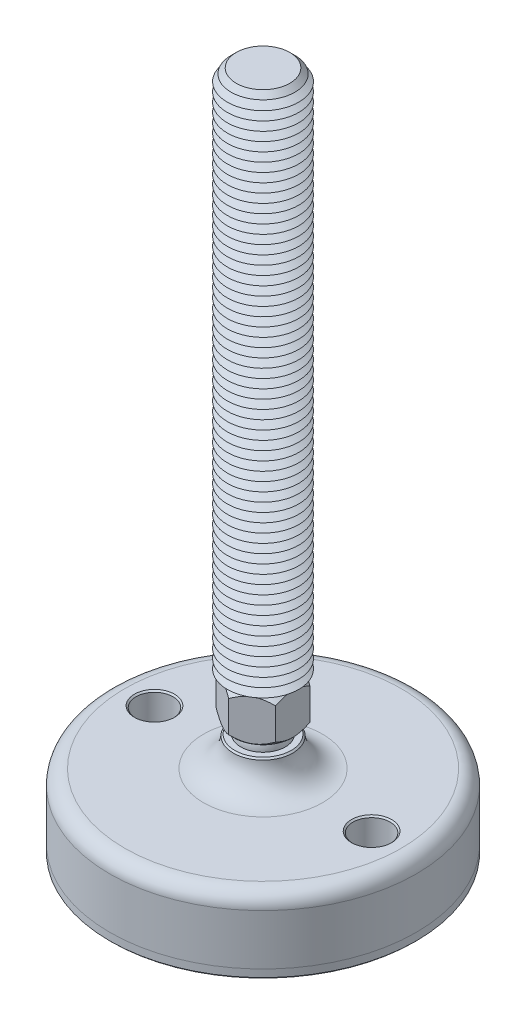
ISO-10303-21;
HEADER;
FILE_DESCRIPTION(('STEP AP214'),'2;1');
FILE_NAME('part.step','',(''),(''),'','','');
FILE_SCHEMA(('AUTOMOTIVE_DESIGN { 1 0 10303 214 1 1 1 1 }'));
ENDSEC;
DATA;
#1=APPLICATION_CONTEXT('core data for automotive mechanical design processes');
#2=APPLICATION_PROTOCOL_DEFINITION('international standard','automotive_design',2000,#1);
#3=PRODUCT_CONTEXT('',#1,'mechanical');
#4=PRODUCT('Part','Part','',(#3));
#5=PRODUCT_RELATED_PRODUCT_CATEGORY('part','',(#4));
#6=PRODUCT_DEFINITION_FORMATION('','',#4);
#7=PRODUCT_DEFINITION_CONTEXT('part definition',#1,'design');
#8=PRODUCT_DEFINITION('design','',#6,#7);
#9=PRODUCT_DEFINITION_SHAPE('','',#8);
#10=(LENGTH_UNIT() NAMED_UNIT(*) SI_UNIT(.MILLI.,.METRE.));
#11=(NAMED_UNIT(*) PLANE_ANGLE_UNIT() SI_UNIT($,.RADIAN.));
#12=(NAMED_UNIT(*) SI_UNIT($,.STERADIAN.) SOLID_ANGLE_UNIT());
#13=UNCERTAINTY_MEASURE_WITH_UNIT(LENGTH_MEASURE(1.E-05),#10,'distance_accuracy_value','');
#14=(GEOMETRIC_REPRESENTATION_CONTEXT(3) GLOBAL_UNCERTAINTY_ASSIGNED_CONTEXT((#13)) GLOBAL_UNIT_ASSIGNED_CONTEXT((#10,
#11,#12)) REPRESENTATION_CONTEXT('',''));
#15=CARTESIAN_POINT('',(0.,0.,0.));
#16=DIRECTION('',(0.,0.,1.));
#17=DIRECTION('',(1.,0.,0.));
#18=AXIS2_PLACEMENT_3D('',#15,#16,#17);
#19=CARTESIAN_POINT('',(0.,-32.,0.));
#20=DIRECTION('',(0.,1.,0.));
#21=DIRECTION('',(0.,0.,1.));
#22=AXIS2_PLACEMENT_3D('',#19,#20,#21);
#23=PLANE('',#22);
#24=CARTESIAN_POINT('',(-36.5,-32.,0.));
#25=DIRECTION('',(0.,1.,0.));
#26=DIRECTION('',(0.,0.,1.));
#27=AXIS2_PLACEMENT_3D('',#24,#25,#26);
#28=CIRCLE('',#27,6.25);
#29=CARTESIAN_POINT('',(-36.5,-32.,6.25));
#30=VERTEX_POINT('',#29);
#31=EDGE_CURVE('P0_E43',#30,#30,#28,.T.);
#32=ORIENTED_EDGE('',*,*,#31,.F.);
#33=EDGE_LOOP('',(#32));
#34=FACE_BOUND('',#33,.T.);
#35=CARTESIAN_POINT('',(36.5,-32.,0.));
#36=DIRECTION('',(0.,1.,0.));
#37=DIRECTION('',(0.,0.,1.));
#38=AXIS2_PLACEMENT_3D('',#35,#36,#37);
#39=CIRCLE('',#38,6.25);
#40=CARTESIAN_POINT('',(36.5,-32.,6.25));
#41=VERTEX_POINT('',#40);
#42=EDGE_CURVE('P0_E44',#41,#41,#39,.T.);
#43=ORIENTED_EDGE('',*,*,#42,.F.);
#44=EDGE_LOOP('',(#43));
#45=FACE_BOUND('',#44,.T.);
#46=CARTESIAN_POINT('',(0.,-32.,0.));
#47=DIRECTION('',(0.,1.,0.));
#48=DIRECTION('',(0.,0.,1.));
#49=AXIS2_PLACEMENT_3D('',#46,#47,#48);
#50=CIRCLE('',#49,51.5);
#51=CARTESIAN_POINT('',(0.,-32.,51.5));
#52=VERTEX_POINT('',#51);
#53=EDGE_CURVE('P0_E40',#52,#52,#50,.T.);
#54=ORIENTED_EDGE('',*,*,#53,.T.);
#55=EDGE_LOOP('',(#54));
#56=FACE_BOUND('',#55,.T.);
#57=ADVANCED_FACE('P0_F14',(#34,#45,#56),#23,.T.);
#58=CARTESIAN_POINT('',(0.,43.1654938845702,0.));
#59=DIRECTION('',(0.,1.,0.));
#60=DIRECTION('',(0.,0.,1.));
#61=AXIS2_PLACEMENT_3D('',#58,#59,#60);
#62=CYLINDRICAL_SURFACE('',#61,51.5);
#63=CARTESIAN_POINT('',(0.,-34.5,0.));
#64=DIRECTION('',(0.,-1.,0.));
#65=DIRECTION('',(0.,0.,-1.));
#66=AXIS2_PLACEMENT_3D('',#63,#64,#65);
#67=CIRCLE('',#66,51.5);
#68=CARTESIAN_POINT('',(0.,-34.5,-51.5));
#69=VERTEX_POINT('',#68);
#70=EDGE_CURVE('P0_E37',#69,#69,#67,.F.);
#71=ORIENTED_EDGE('',*,*,#70,.T.);
#72=EDGE_LOOP('',(#71));
#73=FACE_BOUND('',#72,.T.);
#74=ORIENTED_EDGE('',*,*,#53,.F.);
#75=EDGE_LOOP('',(#74));
#76=FACE_BOUND('',#75,.T.);
#77=ADVANCED_FACE('P0_F54',(#73,#76),#62,.T.);
#78=CARTESIAN_POINT('',(0.,-35.,51.5));
#79=DIRECTION('',(0.,-1.,0.));
#80=DIRECTION('',(0.,0.,-1.));
#81=AXIS2_PLACEMENT_3D('',#78,#79,#80);
#82=PLANE('',#81);
#83=CARTESIAN_POINT('',(36.5,-35.,0.));
#84=DIRECTION('',(0.,-1.,0.));
#85=DIRECTION('',(0.,0.,-1.));
#86=AXIS2_PLACEMENT_3D('',#83,#84,#85);
#87=CIRCLE('',#86,6.75000000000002);
#88=CARTESIAN_POINT('',(36.5,-35.,-6.75000000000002));
#89=VERTEX_POINT('',#88);
#90=EDGE_CURVE('P0_E25',#89,#89,#87,.F.);
#91=ORIENTED_EDGE('',*,*,#90,.T.);
#92=EDGE_LOOP('',(#91));
#93=FACE_BOUND('',#92,.T.);
#94=CARTESIAN_POINT('',(-36.5,-35.,0.));
#95=DIRECTION('',(0.,-1.,0.));
#96=DIRECTION('',(0.,0.,-1.));
#97=AXIS2_PLACEMENT_3D('',#94,#95,#96);
#98=CIRCLE('',#97,6.74999999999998);
#99=CARTESIAN_POINT('',(-36.5,-35.,-6.74999999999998));
#100=VERTEX_POINT('',#99);
#101=EDGE_CURVE('P0_E29',#100,#100,#98,.F.);
#102=ORIENTED_EDGE('',*,*,#101,.T.);
#103=EDGE_LOOP('',(#102));
#104=FACE_BOUND('',#103,.T.);
#105=CARTESIAN_POINT('',(0.,-35.,0.));
#106=DIRECTION('',(0.,-1.,0.));
#107=DIRECTION('',(0.,0.,-1.));
#108=AXIS2_PLACEMENT_3D('',#105,#106,#107);
#109=CIRCLE('',#108,51.);
#110=CARTESIAN_POINT('',(0.,-35.,-51.));
#111=VERTEX_POINT('',#110);
#112=EDGE_CURVE('P0_E34',#111,#111,#109,.T.);
#113=ORIENTED_EDGE('',*,*,#112,.T.);
#114=EDGE_LOOP('',(#113));
#115=FACE_BOUND('',#114,.T.);
#116=ADVANCED_FACE('P0_F61',(#93,#104,#115),#82,.T.);
#117=CARTESIAN_POINT('',(0.,-34.5,0.));
#118=DIRECTION('',(0.,1.,0.));
#119=DIRECTION('',(0.,0.,1.));
#120=AXIS2_PLACEMENT_3D('',#117,#118,#119);
#121=CONICAL_SURFACE('',#120,51.5,0.785398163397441);
#122=ORIENTED_EDGE('',*,*,#112,.F.);
#123=EDGE_LOOP('',(#122));
#124=FACE_BOUND('',#123,.T.);
#125=ORIENTED_EDGE('',*,*,#70,.F.);
#126=EDGE_LOOP('',(#125));
#127=FACE_BOUND('',#126,.T.);
#128=ADVANCED_FACE('P0_F68',(#124,#127),#121,.T.);
#129=CARTESIAN_POINT('',(36.5,-35.,0.));
#130=DIRECTION('',(0.,1.,0.));
#131=DIRECTION('',(0.,0.,1.));
#132=AXIS2_PLACEMENT_3D('',#129,#130,#131);
#133=CYLINDRICAL_SURFACE('',#132,6.25);
#134=CARTESIAN_POINT('',(36.5,-34.5,0.));
#135=DIRECTION('',(0.,-1.,0.));
#136=DIRECTION('',(0.,0.,-1.));
#137=AXIS2_PLACEMENT_3D('',#134,#135,#136);
#138=CIRCLE('',#137,6.25);
#139=CARTESIAN_POINT('',(36.5,-34.5,-6.25));
#140=VERTEX_POINT('',#139);
#141=EDGE_CURVE('P0_E21',#140,#140,#138,.T.);
#142=ORIENTED_EDGE('',*,*,#141,.T.);
#143=EDGE_LOOP('',(#142));
#144=FACE_BOUND('',#143,.T.);
#145=ORIENTED_EDGE('',*,*,#42,.T.);
#146=EDGE_LOOP('',(#145));
#147=FACE_BOUND('',#146,.T.);
#148=ADVANCED_FACE('P0_F74',(#144,#147),#133,.F.);
#149=CARTESIAN_POINT('',(-36.5,-35.,0.));
#150=DIRECTION('',(0.,1.,0.));
#151=DIRECTION('',(0.,0.,1.));
#152=AXIS2_PLACEMENT_3D('',#149,#150,#151);
#153=CYLINDRICAL_SURFACE('',#152,6.25);
#154=CARTESIAN_POINT('',(-36.5,-34.5,0.));
#155=DIRECTION('',(0.,-1.,0.));
#156=DIRECTION('',(0.,0.,-1.));
#157=AXIS2_PLACEMENT_3D('',#154,#155,#156);
#158=CIRCLE('',#157,6.25);
#159=CARTESIAN_POINT('',(-36.5,-34.5,-6.25));
#160=VERTEX_POINT('',#159);
#161=EDGE_CURVE('P0_E10',#160,#160,#158,.T.);
#162=ORIENTED_EDGE('',*,*,#161,.T.);
#163=EDGE_LOOP('',(#162));
#164=FACE_BOUND('',#163,.T.);
#165=ORIENTED_EDGE('',*,*,#31,.T.);
#166=EDGE_LOOP('',(#165));
#167=FACE_BOUND('',#166,.T.);
#168=ADVANCED_FACE('P0_F50',(#164,#167),#153,.F.);
#169=CARTESIAN_POINT('',(36.5,-35.,0.));
#170=DIRECTION('',(0.,-1.,0.));
#171=DIRECTION('',(0.,0.,-1.));
#172=AXIS2_PLACEMENT_3D('',#169,#170,#171);
#173=CONICAL_SURFACE('',#172,6.75000000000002,0.785398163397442);
#174=ORIENTED_EDGE('',*,*,#141,.F.);
#175=EDGE_LOOP('',(#174));
#176=FACE_BOUND('',#175,.T.);
#177=ORIENTED_EDGE('',*,*,#90,.F.);
#178=EDGE_LOOP('',(#177));
#179=FACE_BOUND('',#178,.T.);
#180=ADVANCED_FACE('P0_F76',(#176,#179),#173,.F.);
#181=CARTESIAN_POINT('',(-36.5,-35.,0.));
#182=DIRECTION('',(0.,-1.,0.));
#183=DIRECTION('',(0.,0.,-1.));
#184=AXIS2_PLACEMENT_3D('',#181,#182,#183);
#185=CONICAL_SURFACE('',#184,6.74999999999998,0.785398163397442);
#186=ORIENTED_EDGE('',*,*,#161,.F.);
#187=EDGE_LOOP('',(#186));
#188=FACE_BOUND('',#187,.T.);
#189=ORIENTED_EDGE('',*,*,#101,.F.);
#190=EDGE_LOOP('',(#189));
#191=FACE_BOUND('',#190,.T.);
#192=ADVANCED_FACE('P0_F16',(#188,#191),#185,.F.);
#193=CLOSED_SHELL('',(#57,#77,#116,#128,#148,#168,#180,#192));
#194=MANIFOLD_SOLID_BREP('P0_B1',#193);
#195=CARTESIAN_POINT('',(0.,3.75,0.));
#196=DIRECTION('',(0.,1.,0.));
#197=DIRECTION('',(0.,0.,1.));
#198=AXIS2_PLACEMENT_3D('',#195,#196,#197);
#199=PLANE('',#198);
#200=CARTESIAN_POINT('',(0.,3.75,0.));
#201=DIRECTION('',(0.,1.,0.));
#202=DIRECTION('',(0.,0.,1.));
#203=AXIS2_PLACEMENT_3D('',#200,#201,#202);
#204=CIRCLE('',#203,9.72829454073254);
#205=CARTESIAN_POINT('',(0.,3.75,9.72829454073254));
#206=VERTEX_POINT('',#205);
#207=EDGE_CURVE('P1_E213',#206,#206,#204,.T.);
#208=ORIENTED_EDGE('',*,*,#207,.F.);
#209=EDGE_LOOP('',(#208));
#210=FACE_BOUND('',#209,.T.);
#211=CARTESIAN_POINT('',(0.,3.75,0.));
#212=DIRECTION('',(0.,1.,0.));
#213=DIRECTION('',(0.,0.,1.));
#214=AXIS2_PLACEMENT_3D('',#211,#212,#213);
#215=CIRCLE('',#214,6.49519052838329);
#216=CARTESIAN_POINT('',(0.,3.75,6.49519052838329));
#217=VERTEX_POINT('',#216);
#218=EDGE_CURVE('P1_E25',#217,#217,#215,.F.);
#219=ORIENTED_EDGE('',*,*,#218,.F.);
#220=EDGE_LOOP('',(#219));
#221=FACE_BOUND('',#220,.T.);
#222=ADVANCED_FACE('P1_F16',(#210,#221),#199,.F.);
#223=CARTESIAN_POINT('',(0.,0.,0.));
#224=DIRECTION('',(0.,1.,0.));
#225=DIRECTION('',(0.,0.,-1.));
#226=AXIS2_PLACEMENT_3D('',#223,#224,#225);
#227=SPHERICAL_SURFACE('',#226,7.5);
#228=ORIENTED_EDGE('',*,*,#218,.T.);
#229=EDGE_LOOP('',(#228));
#230=FACE_BOUND('',#229,.T.);
#231=ADVANCED_FACE('P1_F203',(#230),#227,.T.);
#232=CARTESIAN_POINT('',(0.,3.75,0.));
#233=DIRECTION('',(0.,1.,0.));
#234=DIRECTION('',(0.,0.,1.));
#235=AXIS2_PLACEMENT_3D('',#232,#233,#234);
#236=CONICAL_SURFACE('',#235,9.72829454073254,0.785398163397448);
#237=ORIENTED_EDGE('',*,*,#207,.T.);
#238=EDGE_LOOP('',(#237));
#239=FACE_BOUND('',#238,.T.);
#240=CARTESIAN_POINT('',(-10.,9.59571642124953,-11.9394228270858));
#241=CARTESIAN_POINT('',(-10.,9.37430561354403,-11.6505452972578));
#242=CARTESIAN_POINT('',(-10.,9.15490936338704,-11.3600988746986));
#243=CARTESIAN_POINT('',(-10.,8.72106267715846,-10.7754314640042));
#244=CARTESIAN_POINT('',(-10.,8.50661343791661,-10.4812095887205));
#245=CARTESIAN_POINT('',(-10.,8.08205114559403,-9.88620330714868));
#246=CARTESIAN_POINT('',(-10.,7.87198437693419,-9.58538576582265));
#247=CARTESIAN_POINT('',(-10.,7.45926520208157,-8.97872312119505));
#248=CARTESIAN_POINT('',(-10.,7.25661228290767,-8.67287836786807));
#249=CARTESIAN_POINT('',(-10.,6.84809543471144,-8.03614350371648));
#250=CARTESIAN_POINT('',(-10.,6.64281401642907,-7.70487777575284));
#251=CARTESIAN_POINT('',(-10.,6.245142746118,-7.03457466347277));
#252=CARTESIAN_POINT('',(-10.,6.0527550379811,-6.69553599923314));
#253=CARTESIAN_POINT('',(-10.,5.68497951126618,-6.00961937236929));
#254=CARTESIAN_POINT('',(-10.,5.50954176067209,-5.66276839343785));
#255=CARTESIAN_POINT('',(-10.,5.17959635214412,-4.95932933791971));
#256=CARTESIAN_POINT('',(-10.,5.02507889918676,-4.60274591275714));
#257=CARTESIAN_POINT('',(-10.,4.75599518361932,-3.91353381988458));
#258=CARTESIAN_POINT('',(-10.,4.63902686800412,-3.58185263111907));
#259=CARTESIAN_POINT('',(-10.,4.43164927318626,-2.91013341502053));
#260=CARTESIAN_POINT('',(-10.,4.34124171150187,-2.57009484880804));
#261=CARTESIAN_POINT('',(-10.,4.19334931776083,-1.88955843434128));
#262=CARTESIAN_POINT('',(-10.,4.13527351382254,-1.54919119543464));
#263=CARTESIAN_POINT('',(-10.,4.05324021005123,-0.864347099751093));
#264=CARTESIAN_POINT('',(-10.,4.029275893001,-0.519871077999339));
#265=CARTESIAN_POINT('',(-10.,4.01745435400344,0.155191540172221));
#266=CARTESIAN_POINT('',(-10.,4.02812008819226,0.485752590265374));
#267=CARTESIAN_POINT('',(-10.,4.08160326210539,1.1442457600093));
#268=CARTESIAN_POINT('',(-10.,4.12442366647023,1.47217763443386));
#269=CARTESIAN_POINT('',(-10.,4.24054019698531,2.12859326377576));
#270=CARTESIAN_POINT('',(-10.,4.31437036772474,2.45698095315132));
#271=CARTESIAN_POINT('',(-10.,4.48844287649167,3.10654175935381));
#272=CARTESIAN_POINT('',(-10.,4.58868356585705,3.42771532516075));
#273=CARTESIAN_POINT('',(-10.,4.81839210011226,4.08271396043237));
#274=CARTESIAN_POINT('',(-10.,4.94932842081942,4.41601827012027));
#275=CARTESIAN_POINT('',(-10.,5.23140828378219,5.07403931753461));
#276=CARTESIAN_POINT('',(-10.,5.38256099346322,5.3987520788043));
#277=CARTESIAN_POINT('',(-10.,5.70148727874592,6.04113299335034));
#278=CARTESIAN_POINT('',(-10.,5.86931223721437,6.35877542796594));
#279=CARTESIAN_POINT('',(-10.,6.21788686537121,6.98677627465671));
#280=CARTESIAN_POINT('',(-10.,6.39863453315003,7.29713580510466));
#281=CARTESIAN_POINT('',(-10.,6.76133545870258,7.89633938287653));
#282=CARTESIAN_POINT('',(-10.,6.94278731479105,8.18548854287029));
#283=CARTESIAN_POINT('',(-10.,7.31339871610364,8.75881961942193));
#284=CARTESIAN_POINT('',(-10.,7.50255884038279,9.04300116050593));
#285=CARTESIAN_POINT('',(-10.,7.8856676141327,9.6047584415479));
#286=CARTESIAN_POINT('',(-10.,8.07956548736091,9.88236893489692));
#287=CARTESIAN_POINT('',(-10.,8.47254700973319,10.4337838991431));
#288=CARTESIAN_POINT('',(-10.,8.67162921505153,10.7075893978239));
#289=CARTESIAN_POINT('',(-10.,8.87283307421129,10.9797992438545));
#290=B_SPLINE_CURVE_WITH_KNOTS('',3,(#240,#241,#242,#243,#244,#245,#246,#247,#248,#249,#250,
#251,#252,#253,#254,#255,#256,#257,#258,#259,#260,#261,#262,#263,#264,#265,#266,#267,#268,#269,
#270,#271,#272,#273,#274,#275,#276,#277,#278,#279,#280,#281,#282,#283,#284,#285,#286,#287,#288,
#289),.UNSPECIFIED.,.F.,.F.,(4,2,2,2,2,2,2,2,2,2,2,2,2,2,2,2,2,2,2,2,2,2,2,2,4),(0.,
1.09192545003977,2.18411235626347,3.28473497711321,4.3852812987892,5.5541916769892,
6.72329593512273,7.88884387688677,9.05384420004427,10.1080362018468,11.1622963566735,
12.1965943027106,13.2306855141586,14.2212593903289,15.2119246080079,16.2203997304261,
17.2288119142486,18.3022883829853,19.3762532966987,20.4536373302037,21.5308548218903,
22.5548150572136,23.5788523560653,24.5946500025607,25.6101677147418),.UNSPECIFIED.);
#291=CARTESIAN_POINT('',(-10.,5.56871084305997,-5.77350269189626));
#292=VERTEX_POINT('',#291);
#293=CARTESIAN_POINT('',(-10.,5.56871084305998,5.77350269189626));
#294=VERTEX_POINT('',#293);
#295=EDGE_CURVE('P1_E187',#292,#294,#290,.T.);
#296=ORIENTED_EDGE('',*,*,#295,.F.);
#297=CARTESIAN_POINT('',(0.000199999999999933,5.56882631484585,-11.5471208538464));
#298=CARTESIAN_POINT('',(-0.171722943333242,5.4695807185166,-11.447861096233));
#299=CARTESIAN_POINT('',(-0.344992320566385,5.37336355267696,-11.3478239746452));
#300=CARTESIAN_POINT('',(-0.694433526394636,5.18794806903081,-11.1460740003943));
#301=CARTESIAN_POINT('',(-0.870606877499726,5.09875358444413,-11.0443602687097));
#302=CARTESIAN_POINT('',(-1.22689656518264,4.92796770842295,-10.8386563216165));
#303=CARTESIAN_POINT('',(-1.40702970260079,4.84642277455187,-10.7346564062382));
#304=CARTESIAN_POINT('',(-1.77025459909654,4.69270708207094,-10.52494841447));
#305=CARTESIAN_POINT('',(-1.95334590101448,4.62053489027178,-10.4192406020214));
#306=CARTESIAN_POINT('',(-2.31954331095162,4.4878482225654,-10.2078164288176));
#307=CARTESIAN_POINT('',(-2.50260441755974,4.42716910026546,-10.1021260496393));
#308=CARTESIAN_POINT('',(-2.87129282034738,4.31731511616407,-9.88926370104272));
#309=CARTESIAN_POINT('',(-3.05691983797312,4.26813901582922,-9.78209189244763));
#310=CARTESIAN_POINT('',(-3.42994608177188,4.1825291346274,-9.56672509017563));
#311=CARTESIAN_POINT('',(-3.61734032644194,4.14606667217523,-9.45853297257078));
#312=CARTESIAN_POINT('',(-3.99370204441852,4.08668528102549,-9.24124043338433));
#313=CARTESIAN_POINT('',(-4.1826692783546,4.06376432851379,-9.13214015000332));
#314=CARTESIAN_POINT('',(-4.64316633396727,4.0253323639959,-8.86627205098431));
#315=CARTESIAN_POINT('',(-4.91519388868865,4.01726744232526,-8.70921686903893));
#316=CARTESIAN_POINT('',(-5.45875701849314,4.03080424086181,-8.39539054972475));
#317=CARTESIAN_POINT('',(-5.7302923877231,4.05241636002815,-8.23861953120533));
#318=CARTESIAN_POINT('',(-6.27080349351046,4.12403157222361,-7.92655529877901));
#319=CARTESIAN_POINT('',(-6.53977602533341,4.17406641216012,-7.77126393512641));
#320=CARTESIAN_POINT('',(-7.07309796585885,4.29980733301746,-7.46335036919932));
#321=CARTESIAN_POINT('',(-7.33744772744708,4.3755114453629,-7.31072796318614));
#322=CARTESIAN_POINT('',(-7.80670351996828,4.53125365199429,-7.03980300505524));
#323=CARTESIAN_POINT('',(-8.01264886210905,4.60719488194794,-6.92090040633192));
#324=CARTESIAN_POINT('',(-8.42084280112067,4.77131434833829,-6.68522952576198));
#325=CARTESIAN_POINT('',(-8.62309128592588,4.85949295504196,-6.5684613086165));
#326=CARTESIAN_POINT('',(-9.02325448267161,5.04611070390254,-6.33742697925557));
#327=CARTESIAN_POINT('',(-9.22118057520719,5.1445175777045,-6.2231542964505));
#328=CARTESIAN_POINT('',(-9.61336795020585,5.35030005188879,-5.99672480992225));
#329=CARTESIAN_POINT('',(-9.80763139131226,5.45767015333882,-5.88456675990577));
#330=CARTESIAN_POINT('',(-10.0002,5.56882631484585,-5.77338722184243));
#331=B_SPLINE_CURVE_WITH_KNOTS('',3,(#297,#298,#299,#300,#301,#302,#303,#304,#305,#306,#307,
#308,#309,#310,#311,#312,#313,#314,#315,#316,#317,#318,#319,#320,#321,#322,#323,#324,#325,#326,
#327,#328,#329,#330),.UNSPECIFIED.,.F.,.F.,(4,2,2,2,2,2,2,2,2,2,2,2,2,2,2,2,4),(0.,
0.665863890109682,1.33208874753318,2.00212824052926,2.67206515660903,3.33152613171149,
3.99091606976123,4.64880867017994,5.30660292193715,6.24777541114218,7.18927777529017,
8.13183382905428,9.07431761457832,9.82287578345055,10.5714566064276,11.3177436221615,
12.0635761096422),.UNSPECIFIED.);
#332=CARTESIAN_POINT('',(0.,5.56871084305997,-11.5470053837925));
#333=VERTEX_POINT('',#332);
#334=EDGE_CURVE('P1_E181',#333,#292,#331,.T.);
#335=ORIENTED_EDGE('',*,*,#334,.F.);
#336=CARTESIAN_POINT('',(10.0002,5.56882631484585,-5.77338722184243));
#337=CARTESIAN_POINT('',(9.82827705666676,5.4695807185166,-5.87264697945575));
#338=CARTESIAN_POINT('',(9.65500767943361,5.37336355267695,-5.97268410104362));
#339=CARTESIAN_POINT('',(9.30556647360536,5.18794806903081,-6.17443407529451));
#340=CARTESIAN_POINT('',(9.12939312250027,5.09875358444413,-6.27614780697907));
#341=CARTESIAN_POINT('',(8.77310343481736,4.92796770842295,-6.48185175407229));
#342=CARTESIAN_POINT('',(8.59297029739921,4.84642277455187,-6.58585166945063));
#343=CARTESIAN_POINT('',(8.22974540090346,4.69270708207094,-6.79555966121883));
#344=CARTESIAN_POINT('',(8.04665409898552,4.62053489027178,-6.90126747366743));
#345=CARTESIAN_POINT('',(7.68045668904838,4.4878482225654,-7.11269164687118));
#346=CARTESIAN_POINT('',(7.49739558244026,4.42716910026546,-7.21838202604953));
#347=CARTESIAN_POINT('',(7.12870717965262,4.31731511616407,-7.43124437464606));
#348=CARTESIAN_POINT('',(6.94308016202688,4.26813901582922,-7.53841618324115));
#349=CARTESIAN_POINT('',(6.57005391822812,4.1825291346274,-7.75378298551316));
#350=CARTESIAN_POINT('',(6.38265967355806,4.14606667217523,-7.861975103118));
#351=CARTESIAN_POINT('',(6.00629795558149,4.08668528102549,-8.07926764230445));
#352=CARTESIAN_POINT('',(5.81733072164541,4.06376432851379,-8.18836792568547));
#353=CARTESIAN_POINT('',(5.35683366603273,4.0253323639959,-8.45423602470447));
#354=CARTESIAN_POINT('',(5.08480611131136,4.01726744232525,-8.61129120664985));
#355=CARTESIAN_POINT('',(4.54124298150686,4.03080424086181,-8.92511752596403));
#356=CARTESIAN_POINT('',(4.2697076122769,4.05241636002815,-9.08188854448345));
#357=CARTESIAN_POINT('',(3.72919650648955,4.12403157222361,-9.39395277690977));
#358=CARTESIAN_POINT('',(3.46022397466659,4.17406641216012,-9.54924414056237));
#359=CARTESIAN_POINT('',(2.92690203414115,4.29980733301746,-9.85715770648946));
#360=CARTESIAN_POINT('',(2.66255227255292,4.37551144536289,-10.0097801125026));
#361=CARTESIAN_POINT('',(2.19329648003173,4.53125365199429,-10.2807050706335));
#362=CARTESIAN_POINT('',(1.98735113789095,4.60719488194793,-10.3996076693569));
#363=CARTESIAN_POINT('',(1.57915719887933,4.77131434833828,-10.6352785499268));
#364=CARTESIAN_POINT('',(1.37690871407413,4.85949295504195,-10.7520467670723));
#365=CARTESIAN_POINT('',(0.976745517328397,5.04611070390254,-10.9830810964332));
#366=CARTESIAN_POINT('',(0.77881942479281,5.1445175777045,-11.0973537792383));
#367=CARTESIAN_POINT('',(0.386632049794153,5.35030005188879,-11.3237832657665));
#368=CARTESIAN_POINT('',(0.192368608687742,5.45767015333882,-11.435941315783));
#369=CARTESIAN_POINT('',(-0.000199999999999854,5.56882631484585,-11.5471208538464));
#370=B_SPLINE_CURVE_WITH_KNOTS('',3,(#336,#337,#338,#339,#340,#341,#342,#343,#344,#345,#346,
#347,#348,#349,#350,#351,#352,#353,#354,#355,#356,#357,#358,#359,#360,#361,#362,#363,#364,#365,
#366,#367,#368,#369),.UNSPECIFIED.,.F.,.F.,(4,2,2,2,2,2,2,2,2,2,2,2,2,2,2,2,4),(0.,
0.665863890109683,1.33208874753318,2.00212824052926,2.67206515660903,3.33152613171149,
3.99091606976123,4.64880867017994,5.30660292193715,6.24777541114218,7.18927777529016,
8.13183382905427,9.07431761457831,9.82287578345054,10.5714566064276,11.3177436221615,
12.0635761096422),.UNSPECIFIED.);
#371=CARTESIAN_POINT('',(9.99999999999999,5.56871084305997,-5.77350269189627));
#372=VERTEX_POINT('',#371);
#373=EDGE_CURVE('P1_E169',#372,#333,#370,.T.);
#374=ORIENTED_EDGE('',*,*,#373,.F.);
#375=CARTESIAN_POINT('',(10.,9.59571642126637,-11.9394228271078));
#376=CARTESIAN_POINT('',(10.,9.37430561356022,-11.6505452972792));
#377=CARTESIAN_POINT('',(10.,9.15490936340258,-11.3600988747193));
#378=CARTESIAN_POINT('',(10.,8.7210626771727,-10.7754314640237));
#379=CARTESIAN_POINT('',(10.,8.5066134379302,-10.4812095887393));
#380=CARTESIAN_POINT('',(10.,8.08205114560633,-9.88620330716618));
#381=CARTESIAN_POINT('',(10.,7.87198437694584,-9.58538576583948));
#382=CARTESIAN_POINT('',(10.,7.45926520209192,-8.97872312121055));
#383=CARTESIAN_POINT('',(10.,7.25661228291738,-8.67287836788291));
#384=CARTESIAN_POINT('',(10.,6.84809543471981,-8.03614350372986));
#385=CARTESIAN_POINT('',(10.,6.64281401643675,-7.70487777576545));
#386=CARTESIAN_POINT('',(10.,6.24514274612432,-7.03457466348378));
#387=CARTESIAN_POINT('',(10.,6.05275503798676,-6.69553599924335));
#388=CARTESIAN_POINT('',(10.,5.68497951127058,-6.00961937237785));
#389=CARTESIAN_POINT('',(10.,5.50954176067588,-5.66276839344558));
#390=CARTESIAN_POINT('',(10.,5.17959635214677,-4.95932933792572));
#391=CARTESIAN_POINT('',(10.,5.02507889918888,-4.60274591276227));
#392=CARTESIAN_POINT('',(10.,4.75599518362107,-3.91353381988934));
#393=CARTESIAN_POINT('',(10.,4.63902686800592,-3.58185263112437));
#394=CARTESIAN_POINT('',(10.,4.43164927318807,-2.91013341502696));
#395=CARTESIAN_POINT('',(10.,4.34124171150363,-2.57009484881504));
#396=CARTESIAN_POINT('',(10.,4.19334931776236,-1.8895584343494));
#397=CARTESIAN_POINT('',(10.,4.13527351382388,-1.54919119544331));
#398=CARTESIAN_POINT('',(10.,4.05324021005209,-0.86434709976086));
#399=CARTESIAN_POINT('',(10.,4.02927589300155,-0.519871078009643));
#400=CARTESIAN_POINT('',(10.,4.01745435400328,0.155191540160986));
#401=CARTESIAN_POINT('',(10.,4.0281200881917,0.485752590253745));
#402=CARTESIAN_POINT('',(10.,4.08160326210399,1.14424575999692));
#403=CARTESIAN_POINT('',(10.,4.12442366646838,1.47217763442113));
#404=CARTESIAN_POINT('',(10.,4.24054019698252,2.12859326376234));
#405=CARTESIAN_POINT('',(10.,4.31437036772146,2.45698095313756));
#406=CARTESIAN_POINT('',(10.,4.48844287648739,3.1065417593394));
#407=CARTESIAN_POINT('',(10.,4.58868356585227,3.42771532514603));
#408=CARTESIAN_POINT('',(10.,4.81839210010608,4.08271396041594));
#409=CARTESIAN_POINT('',(10.,4.94932842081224,4.41601827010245));
#410=CARTESIAN_POINT('',(10.,5.23140828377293,5.0740393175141));
#411=CARTESIAN_POINT('',(10.,5.38256099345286,5.39875207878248));
#412=CARTESIAN_POINT('',(10.,5.70148727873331,6.04113299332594));
#413=CARTESIAN_POINT('',(10.,5.86931223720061,6.35877542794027));
#414=CARTESIAN_POINT('',(10.,6.21788686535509,6.98677627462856));
#415=CARTESIAN_POINT('',(10.,6.39863453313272,7.29713580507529));
#416=CARTESIAN_POINT('',(10.,6.761335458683,7.89633938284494));
#417=CARTESIAN_POINT('',(10.,6.9427873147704,8.18548854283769));
#418=CARTESIAN_POINT('',(10.,7.31339871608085,8.75881961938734));
#419=CARTESIAN_POINT('',(10.,7.50255884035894,9.04300116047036));
#420=CARTESIAN_POINT('',(10.,7.88566761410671,9.60475844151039));
#421=CARTESIAN_POINT('',(10.,8.07956548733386,9.88236893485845));
#422=CARTESIAN_POINT('',(10.,8.47254700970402,10.4337838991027));
#423=CARTESIAN_POINT('',(10.,8.6716292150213,10.7075893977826));
#424=CARTESIAN_POINT('',(10.,8.87283307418,10.9797992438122));
#425=B_SPLINE_CURVE_WITH_KNOTS('',3,(#375,#376,#377,#378,#379,#380,#381,#382,#383,#384,#385,
#386,#387,#388,#389,#390,#391,#392,#393,#394,#395,#396,#397,#398,#399,#400,#401,#402,#403,#404,
#405,#406,#407,#408,#409,#410,#411,#412,#413,#414,#415,#416,#417,#418,#419,#420,#421,#422,#423,
#424),.UNSPECIFIED.,.F.,.F.,(4,2,2,2,2,2,2,2,2,2,2,2,2,2,2,2,2,2,2,2,2,2,2,2,4),(0.,
1.09192545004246,2.18411235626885,3.28473497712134,4.38528129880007,5.55419167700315,
6.72329593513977,7.88884387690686,9.05384420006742,10.1080362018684,11.1622963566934,
12.196594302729,13.2306855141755,14.2212593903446,15.2119246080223,16.2203997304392,
17.2288119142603,18.3022883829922,19.3762532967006,20.4536373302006,21.5308548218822,
22.5548150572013,23.5788523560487,24.5946500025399,25.6101677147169),.UNSPECIFIED.);
#426=CARTESIAN_POINT('',(10.,5.56871084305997,5.77350269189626));
#427=VERTEX_POINT('',#426);
#428=EDGE_CURVE('P1_E71',#427,#372,#425,.F.);
#429=ORIENTED_EDGE('',*,*,#428,.F.);
#430=CARTESIAN_POINT('',(-0.000200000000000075,5.56882631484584,11.5471208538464));
#431=CARTESIAN_POINT('',(0.171722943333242,5.4695807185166,11.447861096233));
#432=CARTESIAN_POINT('',(0.344992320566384,5.37336355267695,11.3478239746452));
#433=CARTESIAN_POINT('',(0.694433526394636,5.18794806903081,11.1460740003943));
#434=CARTESIAN_POINT('',(0.870606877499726,5.09875358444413,11.0443602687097));
#435=CARTESIAN_POINT('',(1.22689656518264,4.92796770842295,10.8386563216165));
#436=CARTESIAN_POINT('',(1.40702970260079,4.84642277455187,10.7346564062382));
#437=CARTESIAN_POINT('',(1.77025459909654,4.69270708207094,10.52494841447));
#438=CARTESIAN_POINT('',(1.95334590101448,4.62053489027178,10.4192406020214));
#439=CARTESIAN_POINT('',(2.31954331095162,4.4878482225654,10.2078164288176));
#440=CARTESIAN_POINT('',(2.50260441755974,4.42716910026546,10.1021260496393));
#441=CARTESIAN_POINT('',(2.87129282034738,4.31731511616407,9.88926370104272));
#442=CARTESIAN_POINT('',(3.05691983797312,4.26813901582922,9.78209189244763));
#443=CARTESIAN_POINT('',(3.42994608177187,4.18252913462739,9.56672509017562));
#444=CARTESIAN_POINT('',(3.61734032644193,4.14606667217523,9.45853297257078));
#445=CARTESIAN_POINT('',(3.99370204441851,4.08668528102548,9.24124043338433));
#446=CARTESIAN_POINT('',(4.18266927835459,4.06376432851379,9.13214015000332));
#447=CARTESIAN_POINT('',(4.64316633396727,4.0253323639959,8.86627205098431));
#448=CARTESIAN_POINT('',(4.91519388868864,4.01726744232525,8.70921686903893));
#449=CARTESIAN_POINT('',(5.45875701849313,4.03080424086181,8.39539054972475));
#450=CARTESIAN_POINT('',(5.7302923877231,4.05241636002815,8.23861953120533));
#451=CARTESIAN_POINT('',(6.27080349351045,4.1240315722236,7.92655529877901));
#452=CARTESIAN_POINT('',(6.53977602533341,4.17406641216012,7.77126393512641));
#453=CARTESIAN_POINT('',(7.07309796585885,4.29980733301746,7.46335036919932));
#454=CARTESIAN_POINT('',(7.33744772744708,4.37551144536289,7.31072796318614));
#455=CARTESIAN_POINT('',(7.80670351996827,4.53125365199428,7.03980300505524));
#456=CARTESIAN_POINT('',(8.01264886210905,4.60719488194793,6.92090040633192));
#457=CARTESIAN_POINT('',(8.42084280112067,4.77131434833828,6.68522952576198));
#458=CARTESIAN_POINT('',(8.62309128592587,4.85949295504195,6.5684613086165));
#459=CARTESIAN_POINT('',(9.0232544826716,5.04611070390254,6.33742697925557));
#460=CARTESIAN_POINT('',(9.22118057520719,5.1445175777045,6.2231542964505));
#461=CARTESIAN_POINT('',(9.61336795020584,5.35030005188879,5.99672480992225));
#462=CARTESIAN_POINT('',(9.80763139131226,5.45767015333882,5.88456675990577));
#463=CARTESIAN_POINT('',(10.0002,5.56882631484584,5.77338722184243));
#464=B_SPLINE_CURVE_WITH_KNOTS('',3,(#430,#431,#432,#433,#434,#435,#436,#437,#438,#439,#440,
#441,#442,#443,#444,#445,#446,#447,#448,#449,#450,#451,#452,#453,#454,#455,#456,#457,#458,#459,
#460,#461,#462,#463),.UNSPECIFIED.,.F.,.F.,(4,2,2,2,2,2,2,2,2,2,2,2,2,2,2,2,4),(0.,
0.665863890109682,1.33208874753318,2.00212824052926,2.67206515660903,3.33152613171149,
3.99091606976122,4.64880867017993,5.30660292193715,6.24777541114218,7.18927777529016,
8.13183382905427,9.07431761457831,9.82287578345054,10.5714566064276,11.3177436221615,
12.0635761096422),.UNSPECIFIED.);
#465=CARTESIAN_POINT('',(0.,5.56871084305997,11.5470053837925));
#466=VERTEX_POINT('',#465);
#467=EDGE_CURVE('P1_E68',#466,#427,#464,.T.);
#468=ORIENTED_EDGE('',*,*,#467,.F.);
#469=CARTESIAN_POINT('',(-10.0002,5.56882631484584,5.77338722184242));
#470=CARTESIAN_POINT('',(-9.82827705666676,5.4695807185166,5.87264697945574));
#471=CARTESIAN_POINT('',(-9.65500767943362,5.37336355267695,5.97268410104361));
#472=CARTESIAN_POINT('',(-9.30556647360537,5.18794806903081,6.1744340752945));
#473=CARTESIAN_POINT('',(-9.12939312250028,5.09875358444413,6.27614780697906));
#474=CARTESIAN_POINT('',(-8.77310343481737,4.92796770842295,6.48185175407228));
#475=CARTESIAN_POINT('',(-8.59297029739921,4.84642277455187,6.58585166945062));
#476=CARTESIAN_POINT('',(-8.22974540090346,4.69270708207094,6.79555966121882));
#477=CARTESIAN_POINT('',(-8.04665409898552,4.62053489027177,6.90126747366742));
#478=CARTESIAN_POINT('',(-7.68045668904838,4.48784822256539,7.11269164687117));
#479=CARTESIAN_POINT('',(-7.49739558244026,4.42716910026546,7.21838202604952));
#480=CARTESIAN_POINT('',(-7.12870717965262,4.31731511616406,7.43124437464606));
#481=CARTESIAN_POINT('',(-6.94308016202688,4.26813901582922,7.53841618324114));
#482=CARTESIAN_POINT('',(-6.57005391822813,4.18252913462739,7.75378298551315));
#483=CARTESIAN_POINT('',(-6.38265967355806,4.14606667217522,7.861975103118));
#484=CARTESIAN_POINT('',(-6.00629795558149,4.08668528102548,8.07926764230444));
#485=CARTESIAN_POINT('',(-5.81733072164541,4.06376432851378,8.18836792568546));
#486=CARTESIAN_POINT('',(-5.35683366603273,4.0253323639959,8.45423602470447));
#487=CARTESIAN_POINT('',(-5.08480611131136,4.01726744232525,8.61129120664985));
#488=CARTESIAN_POINT('',(-4.54124298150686,4.0308042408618,8.92511752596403));
#489=CARTESIAN_POINT('',(-4.2697076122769,4.05241636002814,9.08188854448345));
#490=CARTESIAN_POINT('',(-3.72919650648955,4.1240315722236,9.39395277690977));
#491=CARTESIAN_POINT('',(-3.46022397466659,4.17406641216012,9.54924414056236));
#492=CARTESIAN_POINT('',(-2.92690203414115,4.29980733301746,9.85715770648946));
#493=CARTESIAN_POINT('',(-2.66255227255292,4.37551144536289,10.0097801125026));
#494=CARTESIAN_POINT('',(-2.19329648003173,4.53125365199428,10.2807050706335));
#495=CARTESIAN_POINT('',(-1.98735113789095,4.60719488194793,10.3996076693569));
#496=CARTESIAN_POINT('',(-1.57915719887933,4.77131434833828,10.6352785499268));
#497=CARTESIAN_POINT('',(-1.37690871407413,4.85949295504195,10.7520467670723));
#498=CARTESIAN_POINT('',(-0.976745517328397,5.04611070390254,10.9830810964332));
#499=CARTESIAN_POINT('',(-0.778819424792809,5.1445175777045,11.0973537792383));
#500=CARTESIAN_POINT('',(-0.386632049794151,5.35030005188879,11.3237832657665));
#501=CARTESIAN_POINT('',(-0.192368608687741,5.45767015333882,11.435941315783));
#502=CARTESIAN_POINT('',(0.000199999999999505,5.56882631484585,11.5471208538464));
#503=B_SPLINE_CURVE_WITH_KNOTS('',3,(#469,#470,#471,#472,#473,#474,#475,#476,#477,#478,#479,
#480,#481,#482,#483,#484,#485,#486,#487,#488,#489,#490,#491,#492,#493,#494,#495,#496,#497,#498,
#499,#500,#501,#502),.UNSPECIFIED.,.F.,.F.,(4,2,2,2,2,2,2,2,2,2,2,2,2,2,2,2,4),(0.,
0.665863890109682,1.33208874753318,2.00212824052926,2.67206515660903,3.33152613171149,
3.99091606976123,4.64880867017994,5.30660292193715,6.24777541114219,7.18927777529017,
8.13183382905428,9.07431761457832,9.82287578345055,10.5714566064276,11.3177436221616,
12.0635761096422),.UNSPECIFIED.);
#504=EDGE_CURVE('P1_E40',#294,#466,#503,.T.);
#505=ORIENTED_EDGE('',*,*,#504,.F.);
#506=EDGE_LOOP('',(#296,#335,#374,#429,#468,#505));
#507=FACE_BOUND('',#506,.T.);
#508=ADVANCED_FACE('P1_F69',(#239,#507),#236,.T.);
#509=CARTESIAN_POINT('',(-10.,19.,-5.77350269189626));
#510=DIRECTION('',(1.,0.,0.));
#511=DIRECTION('',(0.,0.,-1.));
#512=AXIS2_PLACEMENT_3D('',#509,#510,#511);
#513=PLANE('',#512);
#514=DIRECTION('',(0.,-1.,0.));
#515=VECTOR('',#514,1.);
#516=CARTESIAN_POINT('',(-10.,19.,5.77350269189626));
#517=LINE('',#516,#515);
#518=CARTESIAN_POINT('',(-10.,16.1132486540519,5.77350269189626));
#519=VERTEX_POINT('',#518);
#520=EDGE_CURVE('P1_E84',#519,#294,#517,.T.);
#521=ORIENTED_EDGE('',*,*,#520,.F.);
#522=CARTESIAN_POINT('',(-10.,12.4093918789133,-11.5147208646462));
#523=CARTESIAN_POINT('',(-10.,12.6210295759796,-11.2343500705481));
#524=CARTESIAN_POINT('',(-10.,12.8306215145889,-10.9524094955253));
#525=CARTESIAN_POINT('',(-10.,13.2447979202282,-10.3847695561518));
#526=CARTESIAN_POINT('',(-10.,13.4493811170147,-10.0990692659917));
#527=CARTESIAN_POINT('',(-10.,13.8540786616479,-9.52120077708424));
#528=CARTESIAN_POINT('',(-10.,14.0541461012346,-9.22899961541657));
#529=CARTESIAN_POINT('',(-10.,14.4468132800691,-8.63963749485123));
#530=CARTESIAN_POINT('',(-10.,14.6394135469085,-8.34247688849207));
#531=CARTESIAN_POINT('',(-10.,15.0262335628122,-7.72525702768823));
#532=CARTESIAN_POINT('',(-10.,15.2199166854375,-7.40485974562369));
#533=CARTESIAN_POINT('',(-10.,15.5945399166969,-6.75658646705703));
#534=CARTESIAN_POINT('',(-10.,15.7754780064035,-6.4287092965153));
#535=CARTESIAN_POINT('',(-10.,16.1207071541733,-5.76550673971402));
#536=CARTESIAN_POINT('',(-10.,16.285047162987,-5.43020703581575));
#537=CARTESIAN_POINT('',(-10.,16.5934011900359,-4.75046311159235));
#538=CARTESIAN_POINT('',(-10.,16.7374244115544,-4.40602311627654));
#539=CARTESIAN_POINT('',(-10.,16.9894496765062,-3.73558113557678));
#540=CARTESIAN_POINT('',(-10.,17.0994177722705,-3.41032595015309));
#541=CARTESIAN_POINT('',(-10.,17.2932601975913,-2.75198473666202));
#542=CARTESIAN_POINT('',(-10.,17.377132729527,-2.4188981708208));
#543=CARTESIAN_POINT('',(-10.,17.5130086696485,-1.7524231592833));
#544=CARTESIAN_POINT('',(-10.,17.565558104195,-1.41914787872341));
#545=CARTESIAN_POINT('',(-10.,17.6377678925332,-0.749034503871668));
#546=CARTESIAN_POINT('',(-10.,17.6574338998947,-0.412197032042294));
#547=CARTESIAN_POINT('',(-10.,17.6624162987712,0.249527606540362));
#548=CARTESIAN_POINT('',(-10.,17.6489502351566,0.574406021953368));
#549=CARTESIAN_POINT('',(-10.,17.5910984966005,1.22138001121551));
#550=CARTESIAN_POINT('',(-10.,17.5467098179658,1.54347531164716));
#551=CARTESIAN_POINT('',(-10.,17.4286795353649,2.18799750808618));
#552=CARTESIAN_POINT('',(-10.,17.3545401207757,2.51033177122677));
#553=CARTESIAN_POINT('',(-10.,17.180962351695,3.14797698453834));
#554=CARTESIAN_POINT('',(-10.,17.0815261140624,3.46328851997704));
#555=CARTESIAN_POINT('',(-10.,16.8512186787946,4.11544298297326));
#556=CARTESIAN_POINT('',(-10.,16.7182795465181,4.45154819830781));
#557=CARTESIAN_POINT('',(-10.,16.431992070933,5.115028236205));
#558=CARTESIAN_POINT('',(-10.,16.2786342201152,5.4423989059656));
#559=CARTESIAN_POINT('',(-10.,15.9551580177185,6.09000973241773));
#560=CARTESIAN_POINT('',(-10.,15.7849870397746,6.41022338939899));
#561=CARTESIAN_POINT('',(-10.,15.4316458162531,7.04328175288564));
#562=CARTESIAN_POINT('',(-10.,15.2484776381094,7.35612762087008));
#563=CARTESIAN_POINT('',(-10.,14.8810750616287,7.96002022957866));
#564=CARTESIAN_POINT('',(-10.,14.6973474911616,8.25137695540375));
#565=CARTESIAN_POINT('',(-10.,14.3221662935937,8.82908851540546));
#566=CARTESIAN_POINT('',(-10.,14.1307120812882,9.1154429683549));
#567=CARTESIAN_POINT('',(-10.,13.7430400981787,9.68148259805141));
#568=CARTESIAN_POINT('',(-10.,13.5468736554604,9.96120305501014));
#569=CARTESIAN_POINT('',(-10.,13.149353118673,10.5168212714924));
#570=CARTESIAN_POINT('',(-10.,12.9480004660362,10.7927200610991));
#571=CARTESIAN_POINT('',(-10.,12.7445274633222,11.0670185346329));
#572=B_SPLINE_CURVE_WITH_KNOTS('',3,(#522,#523,#524,#525,#526,#527,#528,#529,#530,#531,#532,
#533,#534,#535,#536,#537,#538,#539,#540,#541,#542,#543,#544,#545,#546,#547,#548,#549,#550,#551,
#552,#553,#554,#555,#556,#557,#558,#559,#560,#561,#562,#563,#564,#565,#566,#567,#568,#569,#570,
#571),.UNSPECIFIED.,.F.,.F.,(4,2,2,2,2,2,2,2,2,2,2,2,2,2,2,2,2,2,2,2,2,2,2,2,4),(0.,
1.05386365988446,2.10799187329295,3.17028777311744,4.23250847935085,5.35544154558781,
6.47855209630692,7.5982472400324,8.71743353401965,9.74655549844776,10.7757483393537,
11.7864315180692,12.7969409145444,13.7708741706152,14.7449020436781,15.7359570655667,
16.7269291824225,17.8104078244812,18.8943927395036,19.981885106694,21.0692048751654,
22.1024062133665,23.1356859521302,24.1605722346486,25.1851766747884),.UNSPECIFIED.);
#573=CARTESIAN_POINT('',(-10.,16.1132486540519,-5.77350269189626));
#574=VERTEX_POINT('',#573);
#575=EDGE_CURVE('P1_E85',#519,#574,#572,.F.);
#576=ORIENTED_EDGE('',*,*,#575,.T.);
#577=DIRECTION('',(0.,-1.,0.));
#578=VECTOR('',#577,1.);
#579=CARTESIAN_POINT('',(-10.,19.,-5.77350269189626));
#580=LINE('',#579,#578);
#581=EDGE_CURVE('P1_E102',#574,#292,#580,.T.);
#582=ORIENTED_EDGE('',*,*,#581,.T.);
#583=ORIENTED_EDGE('',*,*,#295,.T.);
#584=EDGE_LOOP('',(#521,#576,#582,#583));
#585=FACE_BOUND('',#584,.T.);
#586=ADVANCED_FACE('P1_F195',(#585),#513,.F.);
#587=CARTESIAN_POINT('',(0.,19.,-11.5470053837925));
#588=DIRECTION('',(0.5,0.,0.866025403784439));
#589=DIRECTION('',(0.866025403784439,0.,-0.5));
#590=AXIS2_PLACEMENT_3D('',#587,#588,#589);
#591=PLANE('',#590);
#592=ORIENTED_EDGE('',*,*,#581,.F.);
#593=CARTESIAN_POINT('',(-10.0002,16.113133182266,-5.77338722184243));
#594=CARTESIAN_POINT('',(-9.82827705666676,16.2123787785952,-5.87264697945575));
#595=CARTESIAN_POINT('',(-9.65500767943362,16.3085959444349,-5.97268410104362));
#596=CARTESIAN_POINT('',(-9.30556647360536,16.494011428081,-6.17443407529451));
#597=CARTESIAN_POINT('',(-9.12939312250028,16.5832059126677,-6.27614780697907));
#598=CARTESIAN_POINT('',(-8.77310343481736,16.7539917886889,-6.48185175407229));
#599=CARTESIAN_POINT('',(-8.59297029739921,16.83553672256,-6.58585166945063));
#600=CARTESIAN_POINT('',(-8.22974540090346,16.9892524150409,-6.79555966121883));
#601=CARTESIAN_POINT('',(-8.04665409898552,17.0614246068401,-6.90126747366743));
#602=CARTESIAN_POINT('',(-7.68045668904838,17.1941112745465,-7.11269164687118));
#603=CARTESIAN_POINT('',(-7.49739558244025,17.2547903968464,-7.21838202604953));
#604=CARTESIAN_POINT('',(-7.12870717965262,17.3646443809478,-7.43124437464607));
#605=CARTESIAN_POINT('',(-6.94308016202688,17.4138204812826,-7.53841618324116));
#606=CARTESIAN_POINT('',(-6.57005391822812,17.4994303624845,-7.75378298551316));
#607=CARTESIAN_POINT('',(-6.38265967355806,17.5358928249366,-7.86197510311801));
#608=CARTESIAN_POINT('',(-6.00629795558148,17.5952742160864,-8.07926764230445));
#609=CARTESIAN_POINT('',(-5.8173307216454,17.6181951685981,-8.18836792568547));
#610=CARTESIAN_POINT('',(-5.35683366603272,17.6566271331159,-8.45423602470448));
#611=CARTESIAN_POINT('',(-5.08480611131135,17.6646920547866,-8.61129120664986));
#612=CARTESIAN_POINT('',(-4.54124298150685,17.65115525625,-8.92511752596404));
#613=CARTESIAN_POINT('',(-4.26970761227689,17.6295431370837,-9.08188854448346));
#614=CARTESIAN_POINT('',(-3.72919650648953,17.5579279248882,-9.39395277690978));
#615=CARTESIAN_POINT('',(-3.46022397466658,17.5078930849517,-9.54924414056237));
#616=CARTESIAN_POINT('',(-2.92690203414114,17.3821521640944,-9.85715770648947));
#617=CARTESIAN_POINT('',(-2.66255227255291,17.3064480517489,-10.0097801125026));
#618=CARTESIAN_POINT('',(-2.19329648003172,17.1507058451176,-10.2807050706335));
#619=CARTESIAN_POINT('',(-1.98735113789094,17.0747646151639,-10.3996076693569));
#620=CARTESIAN_POINT('',(-1.57915719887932,16.9106451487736,-10.6352785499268));
#621=CARTESIAN_POINT('',(-1.37690871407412,16.8224665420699,-10.7520467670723));
#622=CARTESIAN_POINT('',(-0.976745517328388,16.6358487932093,-10.9830810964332));
#623=CARTESIAN_POINT('',(-0.778819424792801,16.5374419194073,-11.0973537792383));
#624=CARTESIAN_POINT('',(-0.386632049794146,16.3316594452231,-11.3237832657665));
#625=CARTESIAN_POINT('',(-0.192368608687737,16.224289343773,-11.435941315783));
#626=CARTESIAN_POINT('',(0.000200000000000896,16.113133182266,-11.5471208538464));
#627=B_SPLINE_CURVE_WITH_KNOTS('',3,(#593,#594,#595,#596,#597,#598,#599,#600,#601,#602,#603,
#604,#605,#606,#607,#608,#609,#610,#611,#612,#613,#614,#615,#616,#617,#618,#619,#620,#621,#622,
#623,#624,#625,#626),.UNSPECIFIED.,.F.,.F.,(4,2,2,2,2,2,2,2,2,2,2,2,2,2,2,2,4),(0.,
0.665863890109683,1.33208874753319,2.00212824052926,2.67206515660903,3.3315261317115,
3.99091606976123,4.64880867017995,5.30660292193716,6.24777541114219,7.18927777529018,
8.13183382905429,9.07431761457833,9.82287578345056,10.5714566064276,11.3177436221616,
12.0635761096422),.UNSPECIFIED.);
#628=CARTESIAN_POINT('',(0.,16.1132486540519,-11.5470053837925));
#629=VERTEX_POINT('',#628);
#630=EDGE_CURVE('P1_E32',#574,#629,#627,.T.);
#631=ORIENTED_EDGE('',*,*,#630,.T.);
#632=DIRECTION('',(0.,-1.,0.));
#633=VECTOR('',#632,1.);
#634=CARTESIAN_POINT('',(0.,19.,-11.5470053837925));
#635=LINE('',#634,#633);
#636=EDGE_CURVE('P1_E99',#629,#333,#635,.T.);
#637=ORIENTED_EDGE('',*,*,#636,.T.);
#638=ORIENTED_EDGE('',*,*,#334,.T.);
#639=EDGE_LOOP('',(#592,#631,#637,#638));
#640=FACE_BOUND('',#639,.T.);
#641=ADVANCED_FACE('P1_F192',(#640),#591,.F.);
#642=CARTESIAN_POINT('',(10.,19.,-5.77350269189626));
#643=DIRECTION('',(-0.5,0.,0.866025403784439));
#644=DIRECTION('',(0.866025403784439,0.,0.5));
#645=AXIS2_PLACEMENT_3D('',#642,#643,#644);
#646=PLANE('',#645);
#647=ORIENTED_EDGE('',*,*,#636,.F.);
#648=CARTESIAN_POINT('',(-0.000199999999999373,16.113133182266,-11.5471208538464));
#649=CARTESIAN_POINT('',(0.171722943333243,16.2123787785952,-11.447861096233));
#650=CARTESIAN_POINT('',(0.344992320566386,16.3085959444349,-11.3478239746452));
#651=CARTESIAN_POINT('',(0.694433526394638,16.494011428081,-11.1460740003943));
#652=CARTESIAN_POINT('',(0.870606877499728,16.5832059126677,-11.0443602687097));
#653=CARTESIAN_POINT('',(1.22689656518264,16.7539917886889,-10.8386563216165));
#654=CARTESIAN_POINT('',(1.4070297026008,16.83553672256,-10.7346564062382));
#655=CARTESIAN_POINT('',(1.77025459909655,16.9892524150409,-10.52494841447));
#656=CARTESIAN_POINT('',(1.95334590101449,17.0614246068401,-10.4192406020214));
#657=CARTESIAN_POINT('',(2.31954331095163,17.1941112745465,-10.2078164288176));
#658=CARTESIAN_POINT('',(2.50260441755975,17.2547903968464,-10.1021260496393));
#659=CARTESIAN_POINT('',(2.87129282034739,17.3646443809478,-9.88926370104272));
#660=CARTESIAN_POINT('',(3.05691983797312,17.4138204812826,-9.78209189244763));
#661=CARTESIAN_POINT('',(3.42994608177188,17.4994303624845,-9.56672509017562));
#662=CARTESIAN_POINT('',(3.61734032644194,17.5358928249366,-9.45853297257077));
#663=CARTESIAN_POINT('',(3.99370204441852,17.5952742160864,-9.24124043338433));
#664=CARTESIAN_POINT('',(4.1826692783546,17.6181951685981,-9.13214015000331));
#665=CARTESIAN_POINT('',(4.64316633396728,17.6566271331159,-8.86627205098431));
#666=CARTESIAN_POINT('',(4.91519388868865,17.6646920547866,-8.70921686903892));
#667=CARTESIAN_POINT('',(5.45875701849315,17.65115525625,-8.39539054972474));
#668=CARTESIAN_POINT('',(5.73029238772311,17.6295431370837,-8.23861953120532));
#669=CARTESIAN_POINT('',(6.27080349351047,17.5579279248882,-7.92655529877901));
#670=CARTESIAN_POINT('',(6.53977602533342,17.5078930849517,-7.77126393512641));
#671=CARTESIAN_POINT('',(7.07309796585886,17.3821521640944,-7.46335036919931));
#672=CARTESIAN_POINT('',(7.33744772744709,17.3064480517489,-7.31072796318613));
#673=CARTESIAN_POINT('',(7.80670351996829,17.1507058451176,-7.03980300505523));
#674=CARTESIAN_POINT('',(8.01264886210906,17.0747646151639,-6.92090040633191));
#675=CARTESIAN_POINT('',(8.42084280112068,16.9106451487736,-6.68522952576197));
#676=CARTESIAN_POINT('',(8.62309128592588,16.8224665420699,-6.5684613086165));
#677=CARTESIAN_POINT('',(9.02325448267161,16.6358487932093,-6.33742697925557));
#678=CARTESIAN_POINT('',(9.2211805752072,16.5374419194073,-6.2231542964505));
#679=CARTESIAN_POINT('',(9.61336795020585,16.3316594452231,-5.99672480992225));
#680=CARTESIAN_POINT('',(9.80763139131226,16.224289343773,-5.88456675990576));
#681=CARTESIAN_POINT('',(10.0002,16.113133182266,-5.77338722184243));
#682=B_SPLINE_CURVE_WITH_KNOTS('',3,(#648,#649,#650,#651,#652,#653,#654,#655,#656,#657,#658,
#659,#660,#661,#662,#663,#664,#665,#666,#667,#668,#669,#670,#671,#672,#673,#674,#675,#676,#677,
#678,#679,#680,#681),.UNSPECIFIED.,.F.,.F.,(4,2,2,2,2,2,2,2,2,2,2,2,2,2,2,2,4),(0.,
0.665863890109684,1.33208874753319,2.00212824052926,2.67206515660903,3.3315261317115,
3.99091606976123,4.64880867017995,5.30660292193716,6.24777541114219,7.18927777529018,
8.13183382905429,9.07431761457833,9.82287578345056,10.5714566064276,11.3177436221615,
12.0635761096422),.UNSPECIFIED.);
#683=CARTESIAN_POINT('',(10.,16.1132486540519,-5.77350269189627));
#684=VERTEX_POINT('',#683);
#685=EDGE_CURVE('P1_E145',#629,#684,#682,.T.);
#686=ORIENTED_EDGE('',*,*,#685,.T.);
#687=DIRECTION('',(0.,-1.,0.));
#688=VECTOR('',#687,1.);
#689=CARTESIAN_POINT('',(10.,19.,-5.77350269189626));
#690=LINE('',#689,#688);
#691=EDGE_CURVE('P1_E94',#684,#372,#690,.T.);
#692=ORIENTED_EDGE('',*,*,#691,.T.);
#693=ORIENTED_EDGE('',*,*,#373,.T.);
#694=EDGE_LOOP('',(#647,#686,#692,#693));
#695=FACE_BOUND('',#694,.T.);
#696=ADVANCED_FACE('P1_F159',(#695),#646,.F.);
#697=CARTESIAN_POINT('',(10.,19.,5.77350269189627));
#698=DIRECTION('',(-1.,0.,0.));
#699=DIRECTION('',(0.,0.,1.));
#700=AXIS2_PLACEMENT_3D('',#697,#698,#699);
#701=PLANE('',#700);
#702=ORIENTED_EDGE('',*,*,#691,.F.);
#703=CARTESIAN_POINT('',(10.,12.4093918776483,-11.5147208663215));
#704=CARTESIAN_POINT('',(10.,12.6210295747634,-11.2343500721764));
#705=CARTESIAN_POINT('',(10.,12.8306215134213,-10.9524094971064));
#706=CARTESIAN_POINT('',(10.,13.2447979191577,-10.3847695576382));
#707=CARTESIAN_POINT('',(10.,13.4493811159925,-10.0990692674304));
#708=CARTESIAN_POINT('',(10.,13.8540786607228,-9.52120077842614));
#709=CARTESIAN_POINT('',(10.,14.0541461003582,-9.22899961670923));
#710=CARTESIAN_POINT('',(10.,14.4468132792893,-8.6396374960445));
#711=CARTESIAN_POINT('',(10.,14.6394135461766,-8.34247688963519));
#712=CARTESIAN_POINT('',(10.,15.02623356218,-7.72525702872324));
#713=CARTESIAN_POINT('',(10.,15.2199166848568,-7.40485974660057));
#714=CARTESIAN_POINT('',(10.,15.5945399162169,-6.75658646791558));
#715=CARTESIAN_POINT('',(10.,15.7754780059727,-6.42870929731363));
#716=CARTESIAN_POINT('',(10.,16.1207071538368,-5.76550674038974));
#717=CARTESIAN_POINT('',(10.,16.2850471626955,-5.4302070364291));
#718=CARTESIAN_POINT('',(10.,16.593401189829,-4.75046311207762));
#719=CARTESIAN_POINT('',(10.,16.7374244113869,-4.40602311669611));
#720=CARTESIAN_POINT('',(10.,16.9894496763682,-3.73558113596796));
#721=CARTESIAN_POINT('',(10.,17.09941777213,-3.41032595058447));
#722=CARTESIAN_POINT('',(10.,17.2932601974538,-2.75198473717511));
#723=CARTESIAN_POINT('',(10.,17.3771327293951,-2.4188981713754));
#724=CARTESIAN_POINT('',(10.,17.5130086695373,-1.75242315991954));
#725=CARTESIAN_POINT('',(10.,17.5655581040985,-1.41914787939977));
#726=CARTESIAN_POINT('',(10.,17.6377678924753,-0.749034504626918));
#727=CARTESIAN_POINT('',(10.,17.6574338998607,-0.41219703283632));
#728=CARTESIAN_POINT('',(10.,17.6624162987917,0.249527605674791));
#729=CARTESIAN_POINT('',(10.,17.6489502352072,0.574406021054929));
#730=CARTESIAN_POINT('',(10.,17.5910984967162,1.22138001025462));
#731=CARTESIAN_POINT('',(10.,17.5467098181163,1.5434753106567));
#732=CARTESIAN_POINT('',(10.,17.4286795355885,2.18799750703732));
#733=CARTESIAN_POINT('',(10.,17.3545401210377,2.51033177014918));
#734=CARTESIAN_POINT('',(10.,17.1809623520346,3.14797698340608));
#735=CARTESIAN_POINT('',(10.,17.0815261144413,3.46328851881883));
#736=CARTESIAN_POINT('',(10.,16.8512186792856,4.11544298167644));
#737=CARTESIAN_POINT('',(10.,16.7182795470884,4.45154819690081));
#738=CARTESIAN_POINT('',(10.,16.4319920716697,5.11502823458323));
#739=CARTESIAN_POINT('',(10.,16.2786342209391,5.44239890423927));
#740=CARTESIAN_POINT('',(10.,15.9551580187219,6.09000973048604));
#741=CARTESIAN_POINT('',(10.,15.7849870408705,6.41022338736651));
#742=CARTESIAN_POINT('',(10.,15.4316458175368,7.04328175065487));
#743=CARTESIAN_POINT('',(10.,15.2484776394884,7.35612761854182));
#744=CARTESIAN_POINT('',(10.,14.8810750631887,7.96002022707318));
#745=CARTESIAN_POINT('',(10.,14.6973474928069,8.25137695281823));
#746=CARTESIAN_POINT('',(10.,14.3221662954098,8.82908851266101));
#747=CARTESIAN_POINT('',(10.,14.13071208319,9.11544296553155));
#748=CARTESIAN_POINT('',(10.,13.7430401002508,9.68148259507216));
#749=CARTESIAN_POINT('',(10.,13.5468736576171,9.96120305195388));
#750=CARTESIAN_POINT('',(10.,13.149353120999,10.5168212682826));
#751=CARTESIAN_POINT('',(10.,12.9480004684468,10.7927200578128));
#752=CARTESIAN_POINT('',(10.,12.7445274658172,11.0670185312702));
#753=B_SPLINE_CURVE_WITH_KNOTS('',3,(#703,#704,#705,#706,#707,#708,#709,#710,#711,#712,#713,
#714,#715,#716,#717,#718,#719,#720,#721,#722,#723,#724,#725,#726,#727,#728,#729,#730,#731,#732,
#733,#734,#735,#736,#737,#738,#739,#740,#741,#742,#743,#744,#745,#746,#747,#748,#749,#750,#751,
#752),.UNSPECIFIED.,.F.,.F.,(4,2,2,2,2,2,2,2,2,2,2,2,2,2,2,2,2,2,2,2,2,2,2,2,4),(0.,
1.05386366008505,2.10799187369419,3.17028777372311,4.23250848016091,5.35544154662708,
6.47855209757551,7.59824724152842,8.71743353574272,9.74655550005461,10.7757483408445,
11.7864315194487,12.7969409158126,13.7708741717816,14.7449020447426,15.7359570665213,
16.7269291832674,17.8104078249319,18.8943927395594,19.9818851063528,21.0692048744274,
22.1024062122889,23.135685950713,24.1605722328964,25.1851766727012),.UNSPECIFIED.);
#754=CARTESIAN_POINT('',(10.,16.1132486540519,5.77350269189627));
#755=VERTEX_POINT('',#754);
#756=EDGE_CURVE('P1_E150',#684,#755,#753,.T.);
#757=ORIENTED_EDGE('',*,*,#756,.T.);
#758=DIRECTION('',(0.,-1.,0.));
#759=VECTOR('',#758,1.);
#760=CARTESIAN_POINT('',(10.,19.,5.77350269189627));
#761=LINE('',#760,#759);
#762=EDGE_CURVE('P1_E90',#755,#427,#761,.T.);
#763=ORIENTED_EDGE('',*,*,#762,.T.);
#764=ORIENTED_EDGE('',*,*,#428,.T.);
#765=EDGE_LOOP('',(#702,#757,#763,#764));
#766=FACE_BOUND('',#765,.T.);
#767=ADVANCED_FACE('P1_F156',(#766),#701,.F.);
#768=CARTESIAN_POINT('',(0.,19.,11.5470053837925));
#769=DIRECTION('',(-0.5,0.,-0.866025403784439));
#770=DIRECTION('',(-0.866025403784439,0.,0.5));
#771=AXIS2_PLACEMENT_3D('',#768,#769,#770);
#772=PLANE('',#771);
#773=ORIENTED_EDGE('',*,*,#762,.F.);
#774=CARTESIAN_POINT('',(10.0002,16.113133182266,5.77338722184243));
#775=CARTESIAN_POINT('',(9.82827705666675,16.2123787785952,5.87264697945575));
#776=CARTESIAN_POINT('',(9.65500767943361,16.3085959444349,5.97268410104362));
#777=CARTESIAN_POINT('',(9.30556647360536,16.494011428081,6.17443407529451));
#778=CARTESIAN_POINT('',(9.12939312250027,16.5832059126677,6.27614780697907));
#779=CARTESIAN_POINT('',(8.77310343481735,16.7539917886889,6.48185175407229));
#780=CARTESIAN_POINT('',(8.5929702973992,16.83553672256,6.58585166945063));
#781=CARTESIAN_POINT('',(8.22974540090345,16.9892524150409,6.79555966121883));
#782=CARTESIAN_POINT('',(8.04665409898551,17.0614246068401,6.90126747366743));
#783=CARTESIAN_POINT('',(7.68045668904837,17.1941112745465,7.11269164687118));
#784=CARTESIAN_POINT('',(7.49739558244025,17.2547903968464,7.21838202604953));
#785=CARTESIAN_POINT('',(7.12870717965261,17.3646443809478,7.43124437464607));
#786=CARTESIAN_POINT('',(6.94308016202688,17.4138204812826,7.53841618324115));
#787=CARTESIAN_POINT('',(6.57005391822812,17.4994303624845,7.75378298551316));
#788=CARTESIAN_POINT('',(6.38265967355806,17.5358928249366,7.86197510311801));
#789=CARTESIAN_POINT('',(6.00629795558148,17.5952742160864,8.07926764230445));
#790=CARTESIAN_POINT('',(5.8173307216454,17.6181951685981,8.18836792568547));
#791=CARTESIAN_POINT('',(5.35683366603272,17.6566271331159,8.45423602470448));
#792=CARTESIAN_POINT('',(5.08480611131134,17.6646920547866,8.61129120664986));
#793=CARTESIAN_POINT('',(4.54124298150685,17.65115525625,8.92511752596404));
#794=CARTESIAN_POINT('',(4.26970761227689,17.6295431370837,9.08188854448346));
#795=CARTESIAN_POINT('',(3.72919650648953,17.5579279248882,9.39395277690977));
#796=CARTESIAN_POINT('',(3.46022397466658,17.5078930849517,9.54924414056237));
#797=CARTESIAN_POINT('',(2.92690203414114,17.3821521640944,9.85715770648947));
#798=CARTESIAN_POINT('',(2.66255227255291,17.3064480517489,10.0097801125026));
#799=CARTESIAN_POINT('',(2.19329648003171,17.1507058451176,10.2807050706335));
#800=CARTESIAN_POINT('',(1.98735113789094,17.0747646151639,10.3996076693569));
#801=CARTESIAN_POINT('',(1.57915719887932,16.9106451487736,10.6352785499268));
#802=CARTESIAN_POINT('',(1.37690871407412,16.8224665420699,10.7520467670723));
#803=CARTESIAN_POINT('',(0.976745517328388,16.6358487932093,10.9830810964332));
#804=CARTESIAN_POINT('',(0.778819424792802,16.5374419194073,11.0973537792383));
#805=CARTESIAN_POINT('',(0.386632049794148,16.3316594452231,11.3237832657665));
#806=CARTESIAN_POINT('',(0.192368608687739,16.224289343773,11.435941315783));
#807=CARTESIAN_POINT('',(-0.000200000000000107,16.113133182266,11.5471208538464));
#808=B_SPLINE_CURVE_WITH_KNOTS('',3,(#774,#775,#776,#777,#778,#779,#780,#781,#782,#783,#784,
#785,#786,#787,#788,#789,#790,#791,#792,#793,#794,#795,#796,#797,#798,#799,#800,#801,#802,#803,
#804,#805,#806,#807),.UNSPECIFIED.,.F.,.F.,(4,2,2,2,2,2,2,2,2,2,2,2,2,2,2,2,4),(0.,
0.665863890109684,1.33208874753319,2.00212824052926,2.67206515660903,3.33152613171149,
3.99091606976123,4.64880867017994,5.30660292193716,6.24777541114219,7.18927777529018,
8.13183382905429,9.07431761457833,9.82287578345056,10.5714566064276,11.3177436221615,
12.0635761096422),.UNSPECIFIED.);
#809=CARTESIAN_POINT('',(0.,16.1132486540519,11.5470053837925));
#810=VERTEX_POINT('',#809);
#811=EDGE_CURVE('P1_E89',#755,#810,#808,.T.);
#812=ORIENTED_EDGE('',*,*,#811,.T.);
#813=DIRECTION('',(0.,-1.,0.));
#814=VECTOR('',#813,1.);
#815=CARTESIAN_POINT('',(0.,19.,11.5470053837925));
#816=LINE('',#815,#814);
#817=EDGE_CURVE('P1_E82',#810,#466,#816,.T.);
#818=ORIENTED_EDGE('',*,*,#817,.T.);
#819=ORIENTED_EDGE('',*,*,#467,.T.);
#820=EDGE_LOOP('',(#773,#812,#818,#819));
#821=FACE_BOUND('',#820,.T.);
#822=ADVANCED_FACE('P1_F88',(#821),#772,.F.);
#823=CARTESIAN_POINT('',(-10.,19.,5.77350269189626));
#824=DIRECTION('',(0.5,0.,-0.866025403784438));
#825=DIRECTION('',(-0.866025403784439,0.,-0.5));
#826=AXIS2_PLACEMENT_3D('',#823,#824,#825);
#827=PLANE('',#826);
#828=ORIENTED_EDGE('',*,*,#817,.F.);
#829=CARTESIAN_POINT('',(0.000200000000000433,16.113133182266,11.5471208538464));
#830=CARTESIAN_POINT('',(-0.171722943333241,16.2123787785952,11.447861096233));
#831=CARTESIAN_POINT('',(-0.344992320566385,16.3085959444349,11.3478239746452));
#832=CARTESIAN_POINT('',(-0.694433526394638,16.494011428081,11.1460740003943));
#833=CARTESIAN_POINT('',(-0.870606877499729,16.5832059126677,11.0443602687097));
#834=CARTESIAN_POINT('',(-1.22689656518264,16.7539917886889,10.8386563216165));
#835=CARTESIAN_POINT('',(-1.4070297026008,16.83553672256,10.7346564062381));
#836=CARTESIAN_POINT('',(-1.77025459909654,16.9892524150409,10.52494841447));
#837=CARTESIAN_POINT('',(-1.95334590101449,17.0614246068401,10.4192406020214));
#838=CARTESIAN_POINT('',(-2.31954331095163,17.1941112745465,10.2078164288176));
#839=CARTESIAN_POINT('',(-2.50260441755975,17.2547903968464,10.1021260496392));
#840=CARTESIAN_POINT('',(-2.87129282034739,17.3646443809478,9.88926370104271));
#841=CARTESIAN_POINT('',(-3.05691983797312,17.4138204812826,9.78209189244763));
#842=CARTESIAN_POINT('',(-3.42994608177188,17.4994303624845,9.56672509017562));
#843=CARTESIAN_POINT('',(-3.61734032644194,17.5358928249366,9.45853297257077));
#844=CARTESIAN_POINT('',(-3.99370204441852,17.5952742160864,9.24124043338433));
#845=CARTESIAN_POINT('',(-4.1826692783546,17.6181951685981,9.13214015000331));
#846=CARTESIAN_POINT('',(-4.64316633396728,17.6566271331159,8.8662720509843));
#847=CARTESIAN_POINT('',(-4.91519388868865,17.6646920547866,8.70921686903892));
#848=CARTESIAN_POINT('',(-5.45875701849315,17.65115525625,8.39539054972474));
#849=CARTESIAN_POINT('',(-5.73029238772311,17.6295431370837,8.23861953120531));
#850=CARTESIAN_POINT('',(-6.27080349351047,17.5579279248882,7.926555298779));
#851=CARTESIAN_POINT('',(-6.53977602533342,17.5078930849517,7.7712639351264));
#852=CARTESIAN_POINT('',(-7.07309796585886,17.3821521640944,7.46335036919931));
#853=CARTESIAN_POINT('',(-7.33744772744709,17.306448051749,7.31072796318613));
#854=CARTESIAN_POINT('',(-7.80670351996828,17.1507058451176,7.03980300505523));
#855=CARTESIAN_POINT('',(-8.01264886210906,17.0747646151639,6.9209004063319));
#856=CARTESIAN_POINT('',(-8.42084280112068,16.9106451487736,6.68522952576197));
#857=CARTESIAN_POINT('',(-8.62309128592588,16.8224665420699,6.56846130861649));
#858=CARTESIAN_POINT('',(-9.02325448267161,16.6358487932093,6.33742697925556));
#859=CARTESIAN_POINT('',(-9.2211805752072,16.5374419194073,6.22315429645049));
#860=CARTESIAN_POINT('',(-9.61336795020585,16.3316594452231,5.99672480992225));
#861=CARTESIAN_POINT('',(-9.80763139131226,16.224289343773,5.88456675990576));
#862=CARTESIAN_POINT('',(-10.0002,16.113133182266,5.77338722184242));
#863=B_SPLINE_CURVE_WITH_KNOTS('',3,(#829,#830,#831,#832,#833,#834,#835,#836,#837,#838,#839,
#840,#841,#842,#843,#844,#845,#846,#847,#848,#849,#850,#851,#852,#853,#854,#855,#856,#857,#858,
#859,#860,#861,#862),.UNSPECIFIED.,.F.,.F.,(4,2,2,2,2,2,2,2,2,2,2,2,2,2,2,2,4),(0.,
0.665863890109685,1.33208874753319,2.00212824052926,2.67206515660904,3.3315261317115,
3.99091606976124,4.64880867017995,5.30660292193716,6.24777541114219,7.18927777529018,
8.13183382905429,9.07431761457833,9.82287578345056,10.5714566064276,11.3177436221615,
12.0635761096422),.UNSPECIFIED.);
#864=EDGE_CURVE('P1_E106',#810,#519,#863,.T.);
#865=ORIENTED_EDGE('',*,*,#864,.T.);
#866=ORIENTED_EDGE('',*,*,#520,.T.);
#867=ORIENTED_EDGE('',*,*,#504,.T.);
#868=EDGE_LOOP('',(#828,#865,#866,#867));
#869=FACE_BOUND('',#868,.T.);
#870=ADVANCED_FACE('P1_F80',(#869),#827,.F.);
#871=CARTESIAN_POINT('',(0.,16.1132486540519,0.));
#872=DIRECTION('',(0.,-1.,0.));
#873=DIRECTION('',(0.,0.,-1.));
#874=AXIS2_PLACEMENT_3D('',#871,#872,#873);
#875=CONICAL_SURFACE('',#874,11.5470053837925,0.785398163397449);
#876=CARTESIAN_POINT('',(0.,19.,0.));
#877=DIRECTION('',(0.,1.,0.));
#878=DIRECTION('',(0.,0.,1.));
#879=AXIS2_PLACEMENT_3D('',#876,#877,#878);
#880=CIRCLE('',#879,8.66025403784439);
#881=CARTESIAN_POINT('',(0.,19.,8.66025403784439));
#882=VERTEX_POINT('',#881);
#883=EDGE_CURVE('P1_E216',#882,#882,#880,.T.);
#884=ORIENTED_EDGE('',*,*,#883,.F.);
#885=EDGE_LOOP('',(#884));
#886=FACE_BOUND('',#885,.T.);
#887=ORIENTED_EDGE('',*,*,#811,.F.);
#888=ORIENTED_EDGE('',*,*,#756,.F.);
#889=ORIENTED_EDGE('',*,*,#685,.F.);
#890=ORIENTED_EDGE('',*,*,#630,.F.);
#891=ORIENTED_EDGE('',*,*,#575,.F.);
#892=ORIENTED_EDGE('',*,*,#864,.F.);
#893=EDGE_LOOP('',(#887,#888,#889,#890,#891,#892));
#894=FACE_BOUND('',#893,.T.);
#895=ADVANCED_FACE('P1_F119',(#886,#894),#875,.T.);
#896=CARTESIAN_POINT('',(0.,19.,0.));
#897=DIRECTION('',(0.,1.,0.));
#898=DIRECTION('',(0.,0.,1.));
#899=AXIS2_PLACEMENT_3D('',#896,#897,#898);
#900=PLANE('',#899);
#901=ORIENTED_EDGE('',*,*,#883,.T.);
#902=EDGE_LOOP('',(#901));
#903=FACE_BOUND('',#902,.T.);
#904=CARTESIAN_POINT('',(0.,19.,0.));
#905=DIRECTION('',(0.,1.,0.));
#906=DIRECTION('',(0.,0.,1.));
#907=AXIS2_PLACEMENT_3D('',#904,#905,#906);
#908=CIRCLE('',#907,12.);
#909=CARTESIAN_POINT('',(0.,19.,12.));
#910=VERTEX_POINT('',#909);
#911=EDGE_CURVE('P1_E217',#910,#910,#908,.T.);
#912=ORIENTED_EDGE('',*,*,#911,.F.);
#913=EDGE_LOOP('',(#912));
#914=FACE_BOUND('',#913,.T.);
#915=ADVANCED_FACE('P1_F124',(#903,#914),#900,.F.);
#916=CARTESIAN_POINT('',(0.,19.,0.));
#917=DIRECTION('',(0.,-1.,0.));
#918=DIRECTION('',(0.,0.,-1.));
#919=AXIS2_PLACEMENT_3D('',#916,#917,#918);
#920=CONICAL_SURFACE('',#919,12.,1.0471975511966);
#921=CARTESIAN_POINT('',(0.,20.5,0.));
#922=DIRECTION('',(0.,1.,0.));
#923=DIRECTION('',(0.,0.,1.));
#924=AXIS2_PLACEMENT_3D('',#921,#922,#923);
#925=CIRCLE('',#924,9.40192378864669);
#926=CARTESIAN_POINT('',(0.,20.5,9.40192378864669));
#927=VERTEX_POINT('',#926);
#928=EDGE_CURVE('P1_E221',#927,#927,#925,.T.);
#929=ORIENTED_EDGE('',*,*,#928,.F.);
#930=EDGE_LOOP('',(#929));
#931=FACE_BOUND('',#930,.T.);
#932=ORIENTED_EDGE('',*,*,#911,.T.);
#933=EDGE_LOOP('',(#932));
#934=FACE_BOUND('',#933,.T.);
#935=ADVANCED_FACE('P1_F1252',(#931,#934),#920,.T.);
#936=CARTESIAN_POINT('',(0.,20.5,0.));
#937=DIRECTION('',(0.,1.,0.));
#938=DIRECTION('',(0.,0.,1.));
#939=AXIS2_PLACEMENT_3D('',#936,#937,#938);
#940=CONICAL_SURFACE('',#939,9.40192378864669,1.0471975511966);
#941=CARTESIAN_POINT('',(0.,22.,0.));
#942=DIRECTION('',(0.,1.,0.));
#943=DIRECTION('',(0.,0.,1.));
#944=AXIS2_PLACEMENT_3D('',#941,#942,#943);
#945=CIRCLE('',#944,12.);
#946=CARTESIAN_POINT('',(0.,22.,12.));
#947=VERTEX_POINT('',#946);
#948=EDGE_CURVE('P1_E226',#947,#947,#945,.T.);
#949=ORIENTED_EDGE('',*,*,#948,.F.);
#950=EDGE_LOOP('',(#949));
#951=FACE_BOUND('',#950,.T.);
#952=ORIENTED_EDGE('',*,*,#928,.T.);
#953=EDGE_LOOP('',(#952));
#954=FACE_BOUND('',#953,.T.);
#955=ADVANCED_FACE('P1_F1246',(#951,#954),#940,.T.);
#956=CARTESIAN_POINT('',(0.,22.,0.));
#957=DIRECTION('',(0.,-1.,0.));
#958=DIRECTION('',(0.,0.,-1.));
#959=AXIS2_PLACEMENT_3D('',#956,#957,#958);
#960=CONICAL_SURFACE('',#959,12.,1.0471975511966);
#961=CARTESIAN_POINT('',(0.,23.5,0.));
#962=DIRECTION('',(0.,1.,0.));
#963=DIRECTION('',(0.,0.,1.));
#964=AXIS2_PLACEMENT_3D('',#961,#962,#963);
#965=CIRCLE('',#964,9.40192378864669);
#966=CARTESIAN_POINT('',(0.,23.5,9.40192378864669));
#967=VERTEX_POINT('',#966);
#968=EDGE_CURVE('P1_E229',#967,#967,#965,.T.);
#969=ORIENTED_EDGE('',*,*,#968,.F.);
#970=EDGE_LOOP('',(#969));
#971=FACE_BOUND('',#970,.T.);
#972=ORIENTED_EDGE('',*,*,#948,.T.);
#973=EDGE_LOOP('',(#972));
#974=FACE_BOUND('',#973,.T.);
#975=ADVANCED_FACE('P1_F1240',(#971,#974),#960,.T.);
#976=CARTESIAN_POINT('',(0.,23.5,0.));
#977=DIRECTION('',(0.,1.,0.));
#978=DIRECTION('',(0.,0.,1.));
#979=AXIS2_PLACEMENT_3D('',#976,#977,#978);
#980=CONICAL_SURFACE('',#979,9.40192378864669,1.0471975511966);
#981=CARTESIAN_POINT('',(0.,25.,0.));
#982=DIRECTION('',(0.,1.,0.));
#983=DIRECTION('',(0.,0.,1.));
#984=AXIS2_PLACEMENT_3D('',#981,#982,#983);
#985=CIRCLE('',#984,12.);
#986=CARTESIAN_POINT('',(0.,25.,12.));
#987=VERTEX_POINT('',#986);
#988=EDGE_CURVE('P1_E232',#987,#987,#985,.T.);
#989=ORIENTED_EDGE('',*,*,#988,.F.);
#990=EDGE_LOOP('',(#989));
#991=FACE_BOUND('',#990,.T.);
#992=ORIENTED_EDGE('',*,*,#968,.T.);
#993=EDGE_LOOP('',(#992));
#994=FACE_BOUND('',#993,.T.);
#995=ADVANCED_FACE('P1_F1234',(#991,#994),#980,.T.);
#996=CARTESIAN_POINT('',(0.,25.,0.));
#997=DIRECTION('',(0.,-1.,0.));
#998=DIRECTION('',(0.,0.,-1.));
#999=AXIS2_PLACEMENT_3D('',#996,#997,#998);
#1000=CONICAL_SURFACE('',#999,12.,1.0471975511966);
#1001=CARTESIAN_POINT('',(0.,26.5,0.));
#1002=DIRECTION('',(0.,1.,0.));
#1003=DIRECTION('',(0.,0.,1.));
#1004=AXIS2_PLACEMENT_3D('',#1001,#1002,#1003);
#1005=CIRCLE('',#1004,9.40192378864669);
#1006=CARTESIAN_POINT('',(0.,26.5,9.40192378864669));
#1007=VERTEX_POINT('',#1006);
#1008=EDGE_CURVE('P1_E235',#1007,#1007,#1005,.T.);
#1009=ORIENTED_EDGE('',*,*,#1008,.F.);
#1010=EDGE_LOOP('',(#1009));
#1011=FACE_BOUND('',#1010,.T.);
#1012=ORIENTED_EDGE('',*,*,#988,.T.);
#1013=EDGE_LOOP('',(#1012));
#1014=FACE_BOUND('',#1013,.T.);
#1015=ADVANCED_FACE('P1_F1228',(#1011,#1014),#1000,.T.);
#1016=CARTESIAN_POINT('',(0.,26.5,0.));
#1017=DIRECTION('',(0.,1.,0.));
#1018=DIRECTION('',(0.,0.,1.));
#1019=AXIS2_PLACEMENT_3D('',#1016,#1017,#1018);
#1020=CONICAL_SURFACE('',#1019,9.40192378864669,1.0471975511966);
#1021=CARTESIAN_POINT('',(0.,28.,0.));
#1022=DIRECTION('',(0.,1.,0.));
#1023=DIRECTION('',(0.,0.,1.));
#1024=AXIS2_PLACEMENT_3D('',#1021,#1022,#1023);
#1025=CIRCLE('',#1024,12.);
#1026=CARTESIAN_POINT('',(0.,28.,12.));
#1027=VERTEX_POINT('',#1026);
#1028=EDGE_CURVE('P1_E238',#1027,#1027,#1025,.T.);
#1029=ORIENTED_EDGE('',*,*,#1028,.F.);
#1030=EDGE_LOOP('',(#1029));
#1031=FACE_BOUND('',#1030,.T.);
#1032=ORIENTED_EDGE('',*,*,#1008,.T.);
#1033=EDGE_LOOP('',(#1032));
#1034=FACE_BOUND('',#1033,.T.);
#1035=ADVANCED_FACE('P1_F1222',(#1031,#1034),#1020,.T.);
#1036=CARTESIAN_POINT('',(0.,28.,0.));
#1037=DIRECTION('',(0.,-1.,0.));
#1038=DIRECTION('',(0.,0.,-1.));
#1039=AXIS2_PLACEMENT_3D('',#1036,#1037,#1038);
#1040=CONICAL_SURFACE('',#1039,12.,1.0471975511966);
#1041=CARTESIAN_POINT('',(0.,29.5,0.));
#1042=DIRECTION('',(0.,1.,0.));
#1043=DIRECTION('',(0.,0.,1.));
#1044=AXIS2_PLACEMENT_3D('',#1041,#1042,#1043);
#1045=CIRCLE('',#1044,9.40192378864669);
#1046=CARTESIAN_POINT('',(0.,29.5,9.40192378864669));
#1047=VERTEX_POINT('',#1046);
#1048=EDGE_CURVE('P1_E241',#1047,#1047,#1045,.T.);
#1049=ORIENTED_EDGE('',*,*,#1048,.F.);
#1050=EDGE_LOOP('',(#1049));
#1051=FACE_BOUND('',#1050,.T.);
#1052=ORIENTED_EDGE('',*,*,#1028,.T.);
#1053=EDGE_LOOP('',(#1052));
#1054=FACE_BOUND('',#1053,.T.);
#1055=ADVANCED_FACE('P1_F1216',(#1051,#1054),#1040,.T.);
#1056=CARTESIAN_POINT('',(0.,29.5,0.));
#1057=DIRECTION('',(0.,1.,0.));
#1058=DIRECTION('',(0.,0.,1.));
#1059=AXIS2_PLACEMENT_3D('',#1056,#1057,#1058);
#1060=CONICAL_SURFACE('',#1059,9.40192378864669,1.0471975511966);
#1061=CARTESIAN_POINT('',(0.,31.,0.));
#1062=DIRECTION('',(0.,1.,0.));
#1063=DIRECTION('',(0.,0.,1.));
#1064=AXIS2_PLACEMENT_3D('',#1061,#1062,#1063);
#1065=CIRCLE('',#1064,12.);
#1066=CARTESIAN_POINT('',(0.,31.,12.));
#1067=VERTEX_POINT('',#1066);
#1068=EDGE_CURVE('P1_E244',#1067,#1067,#1065,.T.);
#1069=ORIENTED_EDGE('',*,*,#1068,.F.);
#1070=EDGE_LOOP('',(#1069));
#1071=FACE_BOUND('',#1070,.T.);
#1072=ORIENTED_EDGE('',*,*,#1048,.T.);
#1073=EDGE_LOOP('',(#1072));
#1074=FACE_BOUND('',#1073,.T.);
#1075=ADVANCED_FACE('P1_F1210',(#1071,#1074),#1060,.T.);
#1076=CARTESIAN_POINT('',(0.,31.,0.));
#1077=DIRECTION('',(0.,-1.,0.));
#1078=DIRECTION('',(0.,0.,-1.));
#1079=AXIS2_PLACEMENT_3D('',#1076,#1077,#1078);
#1080=CONICAL_SURFACE('',#1079,12.,1.0471975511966);
#1081=CARTESIAN_POINT('',(0.,32.5,0.));
#1082=DIRECTION('',(0.,1.,0.));
#1083=DIRECTION('',(0.,0.,1.));
#1084=AXIS2_PLACEMENT_3D('',#1081,#1082,#1083);
#1085=CIRCLE('',#1084,9.40192378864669);
#1086=CARTESIAN_POINT('',(0.,32.5,9.40192378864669));
#1087=VERTEX_POINT('',#1086);
#1088=EDGE_CURVE('P1_E247',#1087,#1087,#1085,.T.);
#1089=ORIENTED_EDGE('',*,*,#1088,.F.);
#1090=EDGE_LOOP('',(#1089));
#1091=FACE_BOUND('',#1090,.T.);
#1092=ORIENTED_EDGE('',*,*,#1068,.T.);
#1093=EDGE_LOOP('',(#1092));
#1094=FACE_BOUND('',#1093,.T.);
#1095=ADVANCED_FACE('P1_F1204',(#1091,#1094),#1080,.T.);
#1096=CARTESIAN_POINT('',(0.,32.5,0.));
#1097=DIRECTION('',(0.,1.,0.));
#1098=DIRECTION('',(0.,0.,1.));
#1099=AXIS2_PLACEMENT_3D('',#1096,#1097,#1098);
#1100=CONICAL_SURFACE('',#1099,9.40192378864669,1.0471975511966);
#1101=CARTESIAN_POINT('',(0.,34.,0.));
#1102=DIRECTION('',(0.,1.,0.));
#1103=DIRECTION('',(0.,0.,1.));
#1104=AXIS2_PLACEMENT_3D('',#1101,#1102,#1103);
#1105=CIRCLE('',#1104,12.);
#1106=CARTESIAN_POINT('',(0.,34.,12.));
#1107=VERTEX_POINT('',#1106);
#1108=EDGE_CURVE('P1_E250',#1107,#1107,#1105,.T.);
#1109=ORIENTED_EDGE('',*,*,#1108,.F.);
#1110=EDGE_LOOP('',(#1109));
#1111=FACE_BOUND('',#1110,.T.);
#1112=ORIENTED_EDGE('',*,*,#1088,.T.);
#1113=EDGE_LOOP('',(#1112));
#1114=FACE_BOUND('',#1113,.T.);
#1115=ADVANCED_FACE('P1_F1198',(#1111,#1114),#1100,.T.);
#1116=CARTESIAN_POINT('',(0.,34.,0.));
#1117=DIRECTION('',(0.,-1.,0.));
#1118=DIRECTION('',(0.,0.,-1.));
#1119=AXIS2_PLACEMENT_3D('',#1116,#1117,#1118);
#1120=CONICAL_SURFACE('',#1119,12.,1.0471975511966);
#1121=CARTESIAN_POINT('',(0.,35.5,0.));
#1122=DIRECTION('',(0.,1.,0.));
#1123=DIRECTION('',(0.,0.,1.));
#1124=AXIS2_PLACEMENT_3D('',#1121,#1122,#1123);
#1125=CIRCLE('',#1124,9.40192378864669);
#1126=CARTESIAN_POINT('',(0.,35.5,9.40192378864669));
#1127=VERTEX_POINT('',#1126);
#1128=EDGE_CURVE('P1_E253',#1127,#1127,#1125,.T.);
#1129=ORIENTED_EDGE('',*,*,#1128,.F.);
#1130=EDGE_LOOP('',(#1129));
#1131=FACE_BOUND('',#1130,.T.);
#1132=ORIENTED_EDGE('',*,*,#1108,.T.);
#1133=EDGE_LOOP('',(#1132));
#1134=FACE_BOUND('',#1133,.T.);
#1135=ADVANCED_FACE('P1_F1192',(#1131,#1134),#1120,.T.);
#1136=CARTESIAN_POINT('',(0.,35.5,0.));
#1137=DIRECTION('',(0.,1.,0.));
#1138=DIRECTION('',(0.,0.,1.));
#1139=AXIS2_PLACEMENT_3D('',#1136,#1137,#1138);
#1140=CONICAL_SURFACE('',#1139,9.40192378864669,1.0471975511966);
#1141=CARTESIAN_POINT('',(0.,37.,0.));
#1142=DIRECTION('',(0.,1.,0.));
#1143=DIRECTION('',(0.,0.,1.));
#1144=AXIS2_PLACEMENT_3D('',#1141,#1142,#1143);
#1145=CIRCLE('',#1144,12.);
#1146=CARTESIAN_POINT('',(0.,37.,12.));
#1147=VERTEX_POINT('',#1146);
#1148=EDGE_CURVE('P1_E256',#1147,#1147,#1145,.T.);
#1149=ORIENTED_EDGE('',*,*,#1148,.F.);
#1150=EDGE_LOOP('',(#1149));
#1151=FACE_BOUND('',#1150,.T.);
#1152=ORIENTED_EDGE('',*,*,#1128,.T.);
#1153=EDGE_LOOP('',(#1152));
#1154=FACE_BOUND('',#1153,.T.);
#1155=ADVANCED_FACE('P1_F1186',(#1151,#1154),#1140,.T.);
#1156=CARTESIAN_POINT('',(0.,37.,0.));
#1157=DIRECTION('',(0.,-1.,0.));
#1158=DIRECTION('',(0.,0.,-1.));
#1159=AXIS2_PLACEMENT_3D('',#1156,#1157,#1158);
#1160=CONICAL_SURFACE('',#1159,12.,1.0471975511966);
#1161=CARTESIAN_POINT('',(0.,38.5,0.));
#1162=DIRECTION('',(0.,1.,0.));
#1163=DIRECTION('',(0.,0.,1.));
#1164=AXIS2_PLACEMENT_3D('',#1161,#1162,#1163);
#1165=CIRCLE('',#1164,9.40192378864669);
#1166=CARTESIAN_POINT('',(0.,38.5,9.40192378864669));
#1167=VERTEX_POINT('',#1166);
#1168=EDGE_CURVE('P1_E259',#1167,#1167,#1165,.T.);
#1169=ORIENTED_EDGE('',*,*,#1168,.F.);
#1170=EDGE_LOOP('',(#1169));
#1171=FACE_BOUND('',#1170,.T.);
#1172=ORIENTED_EDGE('',*,*,#1148,.T.);
#1173=EDGE_LOOP('',(#1172));
#1174=FACE_BOUND('',#1173,.T.);
#1175=ADVANCED_FACE('P1_F1180',(#1171,#1174),#1160,.T.);
#1176=CARTESIAN_POINT('',(0.,38.5,0.));
#1177=DIRECTION('',(0.,1.,0.));
#1178=DIRECTION('',(0.,0.,1.));
#1179=AXIS2_PLACEMENT_3D('',#1176,#1177,#1178);
#1180=CONICAL_SURFACE('',#1179,9.40192378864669,1.0471975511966);
#1181=CARTESIAN_POINT('',(0.,40.,0.));
#1182=DIRECTION('',(0.,1.,0.));
#1183=DIRECTION('',(0.,0.,1.));
#1184=AXIS2_PLACEMENT_3D('',#1181,#1182,#1183);
#1185=CIRCLE('',#1184,12.);
#1186=CARTESIAN_POINT('',(0.,40.,12.));
#1187=VERTEX_POINT('',#1186);
#1188=EDGE_CURVE('P1_E262',#1187,#1187,#1185,.T.);
#1189=ORIENTED_EDGE('',*,*,#1188,.F.);
#1190=EDGE_LOOP('',(#1189));
#1191=FACE_BOUND('',#1190,.T.);
#1192=ORIENTED_EDGE('',*,*,#1168,.T.);
#1193=EDGE_LOOP('',(#1192));
#1194=FACE_BOUND('',#1193,.T.);
#1195=ADVANCED_FACE('P1_F1174',(#1191,#1194),#1180,.T.);
#1196=CARTESIAN_POINT('',(0.,40.,0.));
#1197=DIRECTION('',(0.,-1.,0.));
#1198=DIRECTION('',(0.,0.,-1.));
#1199=AXIS2_PLACEMENT_3D('',#1196,#1197,#1198);
#1200=CONICAL_SURFACE('',#1199,12.,1.0471975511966);
#1201=CARTESIAN_POINT('',(0.,41.5,0.));
#1202=DIRECTION('',(0.,1.,0.));
#1203=DIRECTION('',(0.,0.,1.));
#1204=AXIS2_PLACEMENT_3D('',#1201,#1202,#1203);
#1205=CIRCLE('',#1204,9.40192378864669);
#1206=CARTESIAN_POINT('',(0.,41.5,9.40192378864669));
#1207=VERTEX_POINT('',#1206);
#1208=EDGE_CURVE('P1_E265',#1207,#1207,#1205,.T.);
#1209=ORIENTED_EDGE('',*,*,#1208,.F.);
#1210=EDGE_LOOP('',(#1209));
#1211=FACE_BOUND('',#1210,.T.);
#1212=ORIENTED_EDGE('',*,*,#1188,.T.);
#1213=EDGE_LOOP('',(#1212));
#1214=FACE_BOUND('',#1213,.T.);
#1215=ADVANCED_FACE('P1_F1168',(#1211,#1214),#1200,.T.);
#1216=CARTESIAN_POINT('',(0.,41.5,0.));
#1217=DIRECTION('',(0.,1.,0.));
#1218=DIRECTION('',(0.,0.,1.));
#1219=AXIS2_PLACEMENT_3D('',#1216,#1217,#1218);
#1220=CONICAL_SURFACE('',#1219,9.40192378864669,1.0471975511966);
#1221=CARTESIAN_POINT('',(0.,43.,0.));
#1222=DIRECTION('',(0.,1.,0.));
#1223=DIRECTION('',(0.,0.,1.));
#1224=AXIS2_PLACEMENT_3D('',#1221,#1222,#1223);
#1225=CIRCLE('',#1224,12.);
#1226=CARTESIAN_POINT('',(0.,43.,12.));
#1227=VERTEX_POINT('',#1226);
#1228=EDGE_CURVE('P1_E268',#1227,#1227,#1225,.T.);
#1229=ORIENTED_EDGE('',*,*,#1228,.F.);
#1230=EDGE_LOOP('',(#1229));
#1231=FACE_BOUND('',#1230,.T.);
#1232=ORIENTED_EDGE('',*,*,#1208,.T.);
#1233=EDGE_LOOP('',(#1232));
#1234=FACE_BOUND('',#1233,.T.);
#1235=ADVANCED_FACE('P1_F1162',(#1231,#1234),#1220,.T.);
#1236=CARTESIAN_POINT('',(0.,43.,0.));
#1237=DIRECTION('',(0.,-1.,0.));
#1238=DIRECTION('',(0.,0.,-1.));
#1239=AXIS2_PLACEMENT_3D('',#1236,#1237,#1238);
#1240=CONICAL_SURFACE('',#1239,12.,1.0471975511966);
#1241=CARTESIAN_POINT('',(0.,44.5,0.));
#1242=DIRECTION('',(0.,1.,0.));
#1243=DIRECTION('',(0.,0.,1.));
#1244=AXIS2_PLACEMENT_3D('',#1241,#1242,#1243);
#1245=CIRCLE('',#1244,9.40192378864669);
#1246=CARTESIAN_POINT('',(0.,44.5,9.40192378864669));
#1247=VERTEX_POINT('',#1246);
#1248=EDGE_CURVE('P1_E271',#1247,#1247,#1245,.T.);
#1249=ORIENTED_EDGE('',*,*,#1248,.F.);
#1250=EDGE_LOOP('',(#1249));
#1251=FACE_BOUND('',#1250,.T.);
#1252=ORIENTED_EDGE('',*,*,#1228,.T.);
#1253=EDGE_LOOP('',(#1252));
#1254=FACE_BOUND('',#1253,.T.);
#1255=ADVANCED_FACE('P1_F1156',(#1251,#1254),#1240,.T.);
#1256=CARTESIAN_POINT('',(0.,44.5,0.));
#1257=DIRECTION('',(0.,1.,0.));
#1258=DIRECTION('',(0.,0.,1.));
#1259=AXIS2_PLACEMENT_3D('',#1256,#1257,#1258);
#1260=CONICAL_SURFACE('',#1259,9.40192378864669,1.0471975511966);
#1261=CARTESIAN_POINT('',(0.,46.,0.));
#1262=DIRECTION('',(0.,1.,0.));
#1263=DIRECTION('',(0.,0.,1.));
#1264=AXIS2_PLACEMENT_3D('',#1261,#1262,#1263);
#1265=CIRCLE('',#1264,12.);
#1266=CARTESIAN_POINT('',(0.,46.,12.));
#1267=VERTEX_POINT('',#1266);
#1268=EDGE_CURVE('P1_E274',#1267,#1267,#1265,.T.);
#1269=ORIENTED_EDGE('',*,*,#1268,.F.);
#1270=EDGE_LOOP('',(#1269));
#1271=FACE_BOUND('',#1270,.T.);
#1272=ORIENTED_EDGE('',*,*,#1248,.T.);
#1273=EDGE_LOOP('',(#1272));
#1274=FACE_BOUND('',#1273,.T.);
#1275=ADVANCED_FACE('P1_F1150',(#1271,#1274),#1260,.T.);
#1276=CARTESIAN_POINT('',(0.,46.,0.));
#1277=DIRECTION('',(0.,-1.,0.));
#1278=DIRECTION('',(0.,0.,-1.));
#1279=AXIS2_PLACEMENT_3D('',#1276,#1277,#1278);
#1280=CONICAL_SURFACE('',#1279,12.,1.0471975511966);
#1281=CARTESIAN_POINT('',(0.,47.5,0.));
#1282=DIRECTION('',(0.,1.,0.));
#1283=DIRECTION('',(0.,0.,1.));
#1284=AXIS2_PLACEMENT_3D('',#1281,#1282,#1283);
#1285=CIRCLE('',#1284,9.40192378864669);
#1286=CARTESIAN_POINT('',(0.,47.5,9.40192378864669));
#1287=VERTEX_POINT('',#1286);
#1288=EDGE_CURVE('P1_E277',#1287,#1287,#1285,.T.);
#1289=ORIENTED_EDGE('',*,*,#1288,.F.);
#1290=EDGE_LOOP('',(#1289));
#1291=FACE_BOUND('',#1290,.T.);
#1292=ORIENTED_EDGE('',*,*,#1268,.T.);
#1293=EDGE_LOOP('',(#1292));
#1294=FACE_BOUND('',#1293,.T.);
#1295=ADVANCED_FACE('P1_F1144',(#1291,#1294),#1280,.T.);
#1296=CARTESIAN_POINT('',(0.,47.5,0.));
#1297=DIRECTION('',(0.,1.,0.));
#1298=DIRECTION('',(0.,0.,1.));
#1299=AXIS2_PLACEMENT_3D('',#1296,#1297,#1298);
#1300=CONICAL_SURFACE('',#1299,9.40192378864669,1.0471975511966);
#1301=CARTESIAN_POINT('',(0.,49.,0.));
#1302=DIRECTION('',(0.,1.,0.));
#1303=DIRECTION('',(0.,0.,1.));
#1304=AXIS2_PLACEMENT_3D('',#1301,#1302,#1303);
#1305=CIRCLE('',#1304,12.);
#1306=CARTESIAN_POINT('',(0.,49.,12.));
#1307=VERTEX_POINT('',#1306);
#1308=EDGE_CURVE('P1_E280',#1307,#1307,#1305,.T.);
#1309=ORIENTED_EDGE('',*,*,#1308,.F.);
#1310=EDGE_LOOP('',(#1309));
#1311=FACE_BOUND('',#1310,.T.);
#1312=ORIENTED_EDGE('',*,*,#1288,.T.);
#1313=EDGE_LOOP('',(#1312));
#1314=FACE_BOUND('',#1313,.T.);
#1315=ADVANCED_FACE('P1_F1138',(#1311,#1314),#1300,.T.);
#1316=CARTESIAN_POINT('',(0.,49.,0.));
#1317=DIRECTION('',(0.,-1.,0.));
#1318=DIRECTION('',(0.,0.,-1.));
#1319=AXIS2_PLACEMENT_3D('',#1316,#1317,#1318);
#1320=CONICAL_SURFACE('',#1319,12.,1.0471975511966);
#1321=CARTESIAN_POINT('',(0.,50.5,0.));
#1322=DIRECTION('',(0.,1.,0.));
#1323=DIRECTION('',(0.,0.,1.));
#1324=AXIS2_PLACEMENT_3D('',#1321,#1322,#1323);
#1325=CIRCLE('',#1324,9.40192378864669);
#1326=CARTESIAN_POINT('',(0.,50.5,9.40192378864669));
#1327=VERTEX_POINT('',#1326);
#1328=EDGE_CURVE('P1_E283',#1327,#1327,#1325,.T.);
#1329=ORIENTED_EDGE('',*,*,#1328,.F.);
#1330=EDGE_LOOP('',(#1329));
#1331=FACE_BOUND('',#1330,.T.);
#1332=ORIENTED_EDGE('',*,*,#1308,.T.);
#1333=EDGE_LOOP('',(#1332));
#1334=FACE_BOUND('',#1333,.T.);
#1335=ADVANCED_FACE('P1_F1132',(#1331,#1334),#1320,.T.);
#1336=CARTESIAN_POINT('',(0.,50.5,0.));
#1337=DIRECTION('',(0.,1.,0.));
#1338=DIRECTION('',(0.,0.,1.));
#1339=AXIS2_PLACEMENT_3D('',#1336,#1337,#1338);
#1340=CONICAL_SURFACE('',#1339,9.40192378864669,1.0471975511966);
#1341=CARTESIAN_POINT('',(0.,52.,0.));
#1342=DIRECTION('',(0.,1.,0.));
#1343=DIRECTION('',(0.,0.,1.));
#1344=AXIS2_PLACEMENT_3D('',#1341,#1342,#1343);
#1345=CIRCLE('',#1344,12.);
#1346=CARTESIAN_POINT('',(0.,52.,12.));
#1347=VERTEX_POINT('',#1346);
#1348=EDGE_CURVE('P1_E286',#1347,#1347,#1345,.T.);
#1349=ORIENTED_EDGE('',*,*,#1348,.F.);
#1350=EDGE_LOOP('',(#1349));
#1351=FACE_BOUND('',#1350,.T.);
#1352=ORIENTED_EDGE('',*,*,#1328,.T.);
#1353=EDGE_LOOP('',(#1352));
#1354=FACE_BOUND('',#1353,.T.);
#1355=ADVANCED_FACE('P1_F1126',(#1351,#1354),#1340,.T.);
#1356=CARTESIAN_POINT('',(0.,52.,0.));
#1357=DIRECTION('',(0.,-1.,0.));
#1358=DIRECTION('',(0.,0.,-1.));
#1359=AXIS2_PLACEMENT_3D('',#1356,#1357,#1358);
#1360=CONICAL_SURFACE('',#1359,12.,1.0471975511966);
#1361=CARTESIAN_POINT('',(0.,53.5,0.));
#1362=DIRECTION('',(0.,1.,0.));
#1363=DIRECTION('',(0.,0.,1.));
#1364=AXIS2_PLACEMENT_3D('',#1361,#1362,#1363);
#1365=CIRCLE('',#1364,9.40192378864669);
#1366=CARTESIAN_POINT('',(0.,53.5,9.40192378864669));
#1367=VERTEX_POINT('',#1366);
#1368=EDGE_CURVE('P1_E289',#1367,#1367,#1365,.T.);
#1369=ORIENTED_EDGE('',*,*,#1368,.F.);
#1370=EDGE_LOOP('',(#1369));
#1371=FACE_BOUND('',#1370,.T.);
#1372=ORIENTED_EDGE('',*,*,#1348,.T.);
#1373=EDGE_LOOP('',(#1372));
#1374=FACE_BOUND('',#1373,.T.);
#1375=ADVANCED_FACE('P1_F1120',(#1371,#1374),#1360,.T.);
#1376=CARTESIAN_POINT('',(0.,53.5,0.));
#1377=DIRECTION('',(0.,1.,0.));
#1378=DIRECTION('',(0.,0.,1.));
#1379=AXIS2_PLACEMENT_3D('',#1376,#1377,#1378);
#1380=CONICAL_SURFACE('',#1379,9.40192378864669,1.0471975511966);
#1381=CARTESIAN_POINT('',(0.,55.,0.));
#1382=DIRECTION('',(0.,1.,0.));
#1383=DIRECTION('',(0.,0.,1.));
#1384=AXIS2_PLACEMENT_3D('',#1381,#1382,#1383);
#1385=CIRCLE('',#1384,12.);
#1386=CARTESIAN_POINT('',(0.,55.,12.));
#1387=VERTEX_POINT('',#1386);
#1388=EDGE_CURVE('P1_E292',#1387,#1387,#1385,.T.);
#1389=ORIENTED_EDGE('',*,*,#1388,.F.);
#1390=EDGE_LOOP('',(#1389));
#1391=FACE_BOUND('',#1390,.T.);
#1392=ORIENTED_EDGE('',*,*,#1368,.T.);
#1393=EDGE_LOOP('',(#1392));
#1394=FACE_BOUND('',#1393,.T.);
#1395=ADVANCED_FACE('P1_F1114',(#1391,#1394),#1380,.T.);
#1396=CARTESIAN_POINT('',(0.,55.,0.));
#1397=DIRECTION('',(0.,-1.,0.));
#1398=DIRECTION('',(0.,0.,-1.));
#1399=AXIS2_PLACEMENT_3D('',#1396,#1397,#1398);
#1400=CONICAL_SURFACE('',#1399,12.,1.0471975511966);
#1401=CARTESIAN_POINT('',(0.,56.5,0.));
#1402=DIRECTION('',(0.,1.,0.));
#1403=DIRECTION('',(0.,0.,1.));
#1404=AXIS2_PLACEMENT_3D('',#1401,#1402,#1403);
#1405=CIRCLE('',#1404,9.40192378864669);
#1406=CARTESIAN_POINT('',(0.,56.5,9.40192378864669));
#1407=VERTEX_POINT('',#1406);
#1408=EDGE_CURVE('P1_E295',#1407,#1407,#1405,.T.);
#1409=ORIENTED_EDGE('',*,*,#1408,.F.);
#1410=EDGE_LOOP('',(#1409));
#1411=FACE_BOUND('',#1410,.T.);
#1412=ORIENTED_EDGE('',*,*,#1388,.T.);
#1413=EDGE_LOOP('',(#1412));
#1414=FACE_BOUND('',#1413,.T.);
#1415=ADVANCED_FACE('P1_F1108',(#1411,#1414),#1400,.T.);
#1416=CARTESIAN_POINT('',(0.,56.5,0.));
#1417=DIRECTION('',(0.,1.,0.));
#1418=DIRECTION('',(0.,0.,1.));
#1419=AXIS2_PLACEMENT_3D('',#1416,#1417,#1418);
#1420=CONICAL_SURFACE('',#1419,9.40192378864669,1.0471975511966);
#1421=CARTESIAN_POINT('',(0.,58.,0.));
#1422=DIRECTION('',(0.,1.,0.));
#1423=DIRECTION('',(0.,0.,1.));
#1424=AXIS2_PLACEMENT_3D('',#1421,#1422,#1423);
#1425=CIRCLE('',#1424,12.);
#1426=CARTESIAN_POINT('',(0.,58.,12.));
#1427=VERTEX_POINT('',#1426);
#1428=EDGE_CURVE('P1_E298',#1427,#1427,#1425,.T.);
#1429=ORIENTED_EDGE('',*,*,#1428,.F.);
#1430=EDGE_LOOP('',(#1429));
#1431=FACE_BOUND('',#1430,.T.);
#1432=ORIENTED_EDGE('',*,*,#1408,.T.);
#1433=EDGE_LOOP('',(#1432));
#1434=FACE_BOUND('',#1433,.T.);
#1435=ADVANCED_FACE('P1_F1102',(#1431,#1434),#1420,.T.);
#1436=CARTESIAN_POINT('',(0.,58.,0.));
#1437=DIRECTION('',(0.,-1.,0.));
#1438=DIRECTION('',(0.,0.,-1.));
#1439=AXIS2_PLACEMENT_3D('',#1436,#1437,#1438);
#1440=CONICAL_SURFACE('',#1439,12.,1.0471975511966);
#1441=CARTESIAN_POINT('',(0.,59.5,0.));
#1442=DIRECTION('',(0.,1.,0.));
#1443=DIRECTION('',(0.,0.,1.));
#1444=AXIS2_PLACEMENT_3D('',#1441,#1442,#1443);
#1445=CIRCLE('',#1444,9.40192378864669);
#1446=CARTESIAN_POINT('',(0.,59.5,9.40192378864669));
#1447=VERTEX_POINT('',#1446);
#1448=EDGE_CURVE('P1_E301',#1447,#1447,#1445,.T.);
#1449=ORIENTED_EDGE('',*,*,#1448,.F.);
#1450=EDGE_LOOP('',(#1449));
#1451=FACE_BOUND('',#1450,.T.);
#1452=ORIENTED_EDGE('',*,*,#1428,.T.);
#1453=EDGE_LOOP('',(#1452));
#1454=FACE_BOUND('',#1453,.T.);
#1455=ADVANCED_FACE('P1_F1096',(#1451,#1454),#1440,.T.);
#1456=CARTESIAN_POINT('',(0.,59.5,0.));
#1457=DIRECTION('',(0.,1.,0.));
#1458=DIRECTION('',(0.,0.,1.));
#1459=AXIS2_PLACEMENT_3D('',#1456,#1457,#1458);
#1460=CONICAL_SURFACE('',#1459,9.40192378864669,1.0471975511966);
#1461=CARTESIAN_POINT('',(0.,61.,0.));
#1462=DIRECTION('',(0.,1.,0.));
#1463=DIRECTION('',(0.,0.,1.));
#1464=AXIS2_PLACEMENT_3D('',#1461,#1462,#1463);
#1465=CIRCLE('',#1464,12.);
#1466=CARTESIAN_POINT('',(0.,61.,12.));
#1467=VERTEX_POINT('',#1466);
#1468=EDGE_CURVE('P1_E304',#1467,#1467,#1465,.T.);
#1469=ORIENTED_EDGE('',*,*,#1468,.F.);
#1470=EDGE_LOOP('',(#1469));
#1471=FACE_BOUND('',#1470,.T.);
#1472=ORIENTED_EDGE('',*,*,#1448,.T.);
#1473=EDGE_LOOP('',(#1472));
#1474=FACE_BOUND('',#1473,.T.);
#1475=ADVANCED_FACE('P1_F1090',(#1471,#1474),#1460,.T.);
#1476=CARTESIAN_POINT('',(0.,61.,0.));
#1477=DIRECTION('',(0.,-1.,0.));
#1478=DIRECTION('',(0.,0.,-1.));
#1479=AXIS2_PLACEMENT_3D('',#1476,#1477,#1478);
#1480=CONICAL_SURFACE('',#1479,12.,1.0471975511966);
#1481=CARTESIAN_POINT('',(0.,62.5,0.));
#1482=DIRECTION('',(0.,1.,0.));
#1483=DIRECTION('',(0.,0.,1.));
#1484=AXIS2_PLACEMENT_3D('',#1481,#1482,#1483);
#1485=CIRCLE('',#1484,9.40192378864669);
#1486=CARTESIAN_POINT('',(0.,62.5,9.40192378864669));
#1487=VERTEX_POINT('',#1486);
#1488=EDGE_CURVE('P1_E307',#1487,#1487,#1485,.T.);
#1489=ORIENTED_EDGE('',*,*,#1488,.F.);
#1490=EDGE_LOOP('',(#1489));
#1491=FACE_BOUND('',#1490,.T.);
#1492=ORIENTED_EDGE('',*,*,#1468,.T.);
#1493=EDGE_LOOP('',(#1492));
#1494=FACE_BOUND('',#1493,.T.);
#1495=ADVANCED_FACE('P1_F1084',(#1491,#1494),#1480,.T.);
#1496=CARTESIAN_POINT('',(0.,62.5,0.));
#1497=DIRECTION('',(0.,1.,0.));
#1498=DIRECTION('',(0.,0.,1.));
#1499=AXIS2_PLACEMENT_3D('',#1496,#1497,#1498);
#1500=CONICAL_SURFACE('',#1499,9.40192378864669,1.0471975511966);
#1501=CARTESIAN_POINT('',(0.,64.,0.));
#1502=DIRECTION('',(0.,1.,0.));
#1503=DIRECTION('',(0.,0.,1.));
#1504=AXIS2_PLACEMENT_3D('',#1501,#1502,#1503);
#1505=CIRCLE('',#1504,12.);
#1506=CARTESIAN_POINT('',(0.,64.,12.));
#1507=VERTEX_POINT('',#1506);
#1508=EDGE_CURVE('P1_E310',#1507,#1507,#1505,.T.);
#1509=ORIENTED_EDGE('',*,*,#1508,.F.);
#1510=EDGE_LOOP('',(#1509));
#1511=FACE_BOUND('',#1510,.T.);
#1512=ORIENTED_EDGE('',*,*,#1488,.T.);
#1513=EDGE_LOOP('',(#1512));
#1514=FACE_BOUND('',#1513,.T.);
#1515=ADVANCED_FACE('P1_F1078',(#1511,#1514),#1500,.T.);
#1516=CARTESIAN_POINT('',(0.,64.,0.));
#1517=DIRECTION('',(0.,-1.,0.));
#1518=DIRECTION('',(0.,0.,-1.));
#1519=AXIS2_PLACEMENT_3D('',#1516,#1517,#1518);
#1520=CONICAL_SURFACE('',#1519,12.,1.0471975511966);
#1521=CARTESIAN_POINT('',(0.,65.5,0.));
#1522=DIRECTION('',(0.,1.,0.));
#1523=DIRECTION('',(0.,0.,1.));
#1524=AXIS2_PLACEMENT_3D('',#1521,#1522,#1523);
#1525=CIRCLE('',#1524,9.40192378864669);
#1526=CARTESIAN_POINT('',(0.,65.5,9.40192378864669));
#1527=VERTEX_POINT('',#1526);
#1528=EDGE_CURVE('P1_E313',#1527,#1527,#1525,.T.);
#1529=ORIENTED_EDGE('',*,*,#1528,.F.);
#1530=EDGE_LOOP('',(#1529));
#1531=FACE_BOUND('',#1530,.T.);
#1532=ORIENTED_EDGE('',*,*,#1508,.T.);
#1533=EDGE_LOOP('',(#1532));
#1534=FACE_BOUND('',#1533,.T.);
#1535=ADVANCED_FACE('P1_F1072',(#1531,#1534),#1520,.T.);
#1536=CARTESIAN_POINT('',(0.,65.5,0.));
#1537=DIRECTION('',(0.,1.,0.));
#1538=DIRECTION('',(0.,0.,1.));
#1539=AXIS2_PLACEMENT_3D('',#1536,#1537,#1538);
#1540=CONICAL_SURFACE('',#1539,9.40192378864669,1.0471975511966);
#1541=CARTESIAN_POINT('',(0.,67.,0.));
#1542=DIRECTION('',(0.,1.,0.));
#1543=DIRECTION('',(0.,0.,1.));
#1544=AXIS2_PLACEMENT_3D('',#1541,#1542,#1543);
#1545=CIRCLE('',#1544,12.);
#1546=CARTESIAN_POINT('',(0.,67.,12.));
#1547=VERTEX_POINT('',#1546);
#1548=EDGE_CURVE('P1_E316',#1547,#1547,#1545,.T.);
#1549=ORIENTED_EDGE('',*,*,#1548,.F.);
#1550=EDGE_LOOP('',(#1549));
#1551=FACE_BOUND('',#1550,.T.);
#1552=ORIENTED_EDGE('',*,*,#1528,.T.);
#1553=EDGE_LOOP('',(#1552));
#1554=FACE_BOUND('',#1553,.T.);
#1555=ADVANCED_FACE('P1_F1066',(#1551,#1554),#1540,.T.);
#1556=CARTESIAN_POINT('',(0.,67.,0.));
#1557=DIRECTION('',(0.,-1.,0.));
#1558=DIRECTION('',(0.,0.,-1.));
#1559=AXIS2_PLACEMENT_3D('',#1556,#1557,#1558);
#1560=CONICAL_SURFACE('',#1559,12.,1.0471975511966);
#1561=CARTESIAN_POINT('',(0.,68.5,0.));
#1562=DIRECTION('',(0.,1.,0.));
#1563=DIRECTION('',(0.,0.,1.));
#1564=AXIS2_PLACEMENT_3D('',#1561,#1562,#1563);
#1565=CIRCLE('',#1564,9.40192378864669);
#1566=CARTESIAN_POINT('',(0.,68.5,9.40192378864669));
#1567=VERTEX_POINT('',#1566);
#1568=EDGE_CURVE('P1_E319',#1567,#1567,#1565,.T.);
#1569=ORIENTED_EDGE('',*,*,#1568,.F.);
#1570=EDGE_LOOP('',(#1569));
#1571=FACE_BOUND('',#1570,.T.);
#1572=ORIENTED_EDGE('',*,*,#1548,.T.);
#1573=EDGE_LOOP('',(#1572));
#1574=FACE_BOUND('',#1573,.T.);
#1575=ADVANCED_FACE('P1_F1060',(#1571,#1574),#1560,.T.);
#1576=CARTESIAN_POINT('',(0.,68.5,0.));
#1577=DIRECTION('',(0.,1.,0.));
#1578=DIRECTION('',(0.,0.,1.));
#1579=AXIS2_PLACEMENT_3D('',#1576,#1577,#1578);
#1580=CONICAL_SURFACE('',#1579,9.40192378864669,1.0471975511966);
#1581=CARTESIAN_POINT('',(0.,70.,0.));
#1582=DIRECTION('',(0.,1.,0.));
#1583=DIRECTION('',(0.,0.,1.));
#1584=AXIS2_PLACEMENT_3D('',#1581,#1582,#1583);
#1585=CIRCLE('',#1584,12.);
#1586=CARTESIAN_POINT('',(0.,70.,12.));
#1587=VERTEX_POINT('',#1586);
#1588=EDGE_CURVE('P1_E322',#1587,#1587,#1585,.T.);
#1589=ORIENTED_EDGE('',*,*,#1588,.F.);
#1590=EDGE_LOOP('',(#1589));
#1591=FACE_BOUND('',#1590,.T.);
#1592=ORIENTED_EDGE('',*,*,#1568,.T.);
#1593=EDGE_LOOP('',(#1592));
#1594=FACE_BOUND('',#1593,.T.);
#1595=ADVANCED_FACE('P1_F1054',(#1591,#1594),#1580,.T.);
#1596=CARTESIAN_POINT('',(0.,70.,0.));
#1597=DIRECTION('',(0.,-1.,0.));
#1598=DIRECTION('',(0.,0.,-1.));
#1599=AXIS2_PLACEMENT_3D('',#1596,#1597,#1598);
#1600=CONICAL_SURFACE('',#1599,12.,1.0471975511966);
#1601=CARTESIAN_POINT('',(0.,71.5,0.));
#1602=DIRECTION('',(0.,1.,0.));
#1603=DIRECTION('',(0.,0.,1.));
#1604=AXIS2_PLACEMENT_3D('',#1601,#1602,#1603);
#1605=CIRCLE('',#1604,9.40192378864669);
#1606=CARTESIAN_POINT('',(0.,71.5,9.40192378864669));
#1607=VERTEX_POINT('',#1606);
#1608=EDGE_CURVE('P1_E325',#1607,#1607,#1605,.T.);
#1609=ORIENTED_EDGE('',*,*,#1608,.F.);
#1610=EDGE_LOOP('',(#1609));
#1611=FACE_BOUND('',#1610,.T.);
#1612=ORIENTED_EDGE('',*,*,#1588,.T.);
#1613=EDGE_LOOP('',(#1612));
#1614=FACE_BOUND('',#1613,.T.);
#1615=ADVANCED_FACE('P1_F1048',(#1611,#1614),#1600,.T.);
#1616=CARTESIAN_POINT('',(0.,71.5,0.));
#1617=DIRECTION('',(0.,1.,0.));
#1618=DIRECTION('',(0.,0.,1.));
#1619=AXIS2_PLACEMENT_3D('',#1616,#1617,#1618);
#1620=CONICAL_SURFACE('',#1619,9.40192378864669,1.0471975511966);
#1621=CARTESIAN_POINT('',(0.,73.,0.));
#1622=DIRECTION('',(0.,1.,0.));
#1623=DIRECTION('',(0.,0.,1.));
#1624=AXIS2_PLACEMENT_3D('',#1621,#1622,#1623);
#1625=CIRCLE('',#1624,12.);
#1626=CARTESIAN_POINT('',(0.,73.,12.));
#1627=VERTEX_POINT('',#1626);
#1628=EDGE_CURVE('P1_E328',#1627,#1627,#1625,.T.);
#1629=ORIENTED_EDGE('',*,*,#1628,.F.);
#1630=EDGE_LOOP('',(#1629));
#1631=FACE_BOUND('',#1630,.T.);
#1632=ORIENTED_EDGE('',*,*,#1608,.T.);
#1633=EDGE_LOOP('',(#1632));
#1634=FACE_BOUND('',#1633,.T.);
#1635=ADVANCED_FACE('P1_F1042',(#1631,#1634),#1620,.T.);
#1636=CARTESIAN_POINT('',(0.,73.,0.));
#1637=DIRECTION('',(0.,-1.,0.));
#1638=DIRECTION('',(0.,0.,-1.));
#1639=AXIS2_PLACEMENT_3D('',#1636,#1637,#1638);
#1640=CONICAL_SURFACE('',#1639,12.,1.0471975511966);
#1641=CARTESIAN_POINT('',(0.,74.5,0.));
#1642=DIRECTION('',(0.,1.,0.));
#1643=DIRECTION('',(0.,0.,1.));
#1644=AXIS2_PLACEMENT_3D('',#1641,#1642,#1643);
#1645=CIRCLE('',#1644,9.40192378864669);
#1646=CARTESIAN_POINT('',(0.,74.5,9.40192378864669));
#1647=VERTEX_POINT('',#1646);
#1648=EDGE_CURVE('P1_E331',#1647,#1647,#1645,.T.);
#1649=ORIENTED_EDGE('',*,*,#1648,.F.);
#1650=EDGE_LOOP('',(#1649));
#1651=FACE_BOUND('',#1650,.T.);
#1652=ORIENTED_EDGE('',*,*,#1628,.T.);
#1653=EDGE_LOOP('',(#1652));
#1654=FACE_BOUND('',#1653,.T.);
#1655=ADVANCED_FACE('P1_F1036',(#1651,#1654),#1640,.T.);
#1656=CARTESIAN_POINT('',(0.,74.5,0.));
#1657=DIRECTION('',(0.,1.,0.));
#1658=DIRECTION('',(0.,0.,1.));
#1659=AXIS2_PLACEMENT_3D('',#1656,#1657,#1658);
#1660=CONICAL_SURFACE('',#1659,9.40192378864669,1.0471975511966);
#1661=CARTESIAN_POINT('',(0.,76.,0.));
#1662=DIRECTION('',(0.,1.,0.));
#1663=DIRECTION('',(0.,0.,1.));
#1664=AXIS2_PLACEMENT_3D('',#1661,#1662,#1663);
#1665=CIRCLE('',#1664,12.);
#1666=CARTESIAN_POINT('',(0.,76.,12.));
#1667=VERTEX_POINT('',#1666);
#1668=EDGE_CURVE('P1_E334',#1667,#1667,#1665,.T.);
#1669=ORIENTED_EDGE('',*,*,#1668,.F.);
#1670=EDGE_LOOP('',(#1669));
#1671=FACE_BOUND('',#1670,.T.);
#1672=ORIENTED_EDGE('',*,*,#1648,.T.);
#1673=EDGE_LOOP('',(#1672));
#1674=FACE_BOUND('',#1673,.T.);
#1675=ADVANCED_FACE('P1_F1030',(#1671,#1674),#1660,.T.);
#1676=CARTESIAN_POINT('',(0.,76.,0.));
#1677=DIRECTION('',(0.,-1.,0.));
#1678=DIRECTION('',(0.,0.,-1.));
#1679=AXIS2_PLACEMENT_3D('',#1676,#1677,#1678);
#1680=CONICAL_SURFACE('',#1679,12.,1.0471975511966);
#1681=CARTESIAN_POINT('',(0.,77.5,0.));
#1682=DIRECTION('',(0.,1.,0.));
#1683=DIRECTION('',(0.,0.,1.));
#1684=AXIS2_PLACEMENT_3D('',#1681,#1682,#1683);
#1685=CIRCLE('',#1684,9.40192378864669);
#1686=CARTESIAN_POINT('',(0.,77.5,9.40192378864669));
#1687=VERTEX_POINT('',#1686);
#1688=EDGE_CURVE('P1_E337',#1687,#1687,#1685,.T.);
#1689=ORIENTED_EDGE('',*,*,#1688,.F.);
#1690=EDGE_LOOP('',(#1689));
#1691=FACE_BOUND('',#1690,.T.);
#1692=ORIENTED_EDGE('',*,*,#1668,.T.);
#1693=EDGE_LOOP('',(#1692));
#1694=FACE_BOUND('',#1693,.T.);
#1695=ADVANCED_FACE('P1_F1024',(#1691,#1694),#1680,.T.);
#1696=CARTESIAN_POINT('',(0.,77.5,0.));
#1697=DIRECTION('',(0.,1.,0.));
#1698=DIRECTION('',(0.,0.,1.));
#1699=AXIS2_PLACEMENT_3D('',#1696,#1697,#1698);
#1700=CONICAL_SURFACE('',#1699,9.40192378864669,1.0471975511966);
#1701=CARTESIAN_POINT('',(0.,79.,0.));
#1702=DIRECTION('',(0.,1.,0.));
#1703=DIRECTION('',(0.,0.,1.));
#1704=AXIS2_PLACEMENT_3D('',#1701,#1702,#1703);
#1705=CIRCLE('',#1704,12.);
#1706=CARTESIAN_POINT('',(0.,79.,12.));
#1707=VERTEX_POINT('',#1706);
#1708=EDGE_CURVE('P1_E340',#1707,#1707,#1705,.T.);
#1709=ORIENTED_EDGE('',*,*,#1708,.F.);
#1710=EDGE_LOOP('',(#1709));
#1711=FACE_BOUND('',#1710,.T.);
#1712=ORIENTED_EDGE('',*,*,#1688,.T.);
#1713=EDGE_LOOP('',(#1712));
#1714=FACE_BOUND('',#1713,.T.);
#1715=ADVANCED_FACE('P1_F1018',(#1711,#1714),#1700,.T.);
#1716=CARTESIAN_POINT('',(0.,79.,0.));
#1717=DIRECTION('',(0.,-1.,0.));
#1718=DIRECTION('',(0.,0.,-1.));
#1719=AXIS2_PLACEMENT_3D('',#1716,#1717,#1718);
#1720=CONICAL_SURFACE('',#1719,12.,1.0471975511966);
#1721=CARTESIAN_POINT('',(0.,80.5,0.));
#1722=DIRECTION('',(0.,1.,0.));
#1723=DIRECTION('',(0.,0.,1.));
#1724=AXIS2_PLACEMENT_3D('',#1721,#1722,#1723);
#1725=CIRCLE('',#1724,9.40192378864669);
#1726=CARTESIAN_POINT('',(0.,80.5,9.40192378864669));
#1727=VERTEX_POINT('',#1726);
#1728=EDGE_CURVE('P1_E343',#1727,#1727,#1725,.T.);
#1729=ORIENTED_EDGE('',*,*,#1728,.F.);
#1730=EDGE_LOOP('',(#1729));
#1731=FACE_BOUND('',#1730,.T.);
#1732=ORIENTED_EDGE('',*,*,#1708,.T.);
#1733=EDGE_LOOP('',(#1732));
#1734=FACE_BOUND('',#1733,.T.);
#1735=ADVANCED_FACE('P1_F1012',(#1731,#1734),#1720,.T.);
#1736=CARTESIAN_POINT('',(0.,80.5,0.));
#1737=DIRECTION('',(0.,1.,0.));
#1738=DIRECTION('',(0.,0.,1.));
#1739=AXIS2_PLACEMENT_3D('',#1736,#1737,#1738);
#1740=CONICAL_SURFACE('',#1739,9.40192378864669,1.0471975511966);
#1741=CARTESIAN_POINT('',(0.,82.,0.));
#1742=DIRECTION('',(0.,1.,0.));
#1743=DIRECTION('',(0.,0.,1.));
#1744=AXIS2_PLACEMENT_3D('',#1741,#1742,#1743);
#1745=CIRCLE('',#1744,12.);
#1746=CARTESIAN_POINT('',(0.,82.,12.));
#1747=VERTEX_POINT('',#1746);
#1748=EDGE_CURVE('P1_E346',#1747,#1747,#1745,.T.);
#1749=ORIENTED_EDGE('',*,*,#1748,.F.);
#1750=EDGE_LOOP('',(#1749));
#1751=FACE_BOUND('',#1750,.T.);
#1752=ORIENTED_EDGE('',*,*,#1728,.T.);
#1753=EDGE_LOOP('',(#1752));
#1754=FACE_BOUND('',#1753,.T.);
#1755=ADVANCED_FACE('P1_F1006',(#1751,#1754),#1740,.T.);
#1756=CARTESIAN_POINT('',(0.,82.,0.));
#1757=DIRECTION('',(0.,-1.,0.));
#1758=DIRECTION('',(0.,0.,-1.));
#1759=AXIS2_PLACEMENT_3D('',#1756,#1757,#1758);
#1760=CONICAL_SURFACE('',#1759,12.,1.0471975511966);
#1761=CARTESIAN_POINT('',(0.,83.5,0.));
#1762=DIRECTION('',(0.,1.,0.));
#1763=DIRECTION('',(0.,0.,1.));
#1764=AXIS2_PLACEMENT_3D('',#1761,#1762,#1763);
#1765=CIRCLE('',#1764,9.40192378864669);
#1766=CARTESIAN_POINT('',(0.,83.5,9.40192378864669));
#1767=VERTEX_POINT('',#1766);
#1768=EDGE_CURVE('P1_E349',#1767,#1767,#1765,.T.);
#1769=ORIENTED_EDGE('',*,*,#1768,.F.);
#1770=EDGE_LOOP('',(#1769));
#1771=FACE_BOUND('',#1770,.T.);
#1772=ORIENTED_EDGE('',*,*,#1748,.T.);
#1773=EDGE_LOOP('',(#1772));
#1774=FACE_BOUND('',#1773,.T.);
#1775=ADVANCED_FACE('P1_F1000',(#1771,#1774),#1760,.T.);
#1776=CARTESIAN_POINT('',(0.,83.5,0.));
#1777=DIRECTION('',(0.,1.,0.));
#1778=DIRECTION('',(0.,0.,1.));
#1779=AXIS2_PLACEMENT_3D('',#1776,#1777,#1778);
#1780=CONICAL_SURFACE('',#1779,9.40192378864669,1.0471975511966);
#1781=CARTESIAN_POINT('',(0.,85.,0.));
#1782=DIRECTION('',(0.,1.,0.));
#1783=DIRECTION('',(0.,0.,1.));
#1784=AXIS2_PLACEMENT_3D('',#1781,#1782,#1783);
#1785=CIRCLE('',#1784,12.);
#1786=CARTESIAN_POINT('',(0.,85.,12.));
#1787=VERTEX_POINT('',#1786);
#1788=EDGE_CURVE('P1_E352',#1787,#1787,#1785,.T.);
#1789=ORIENTED_EDGE('',*,*,#1788,.F.);
#1790=EDGE_LOOP('',(#1789));
#1791=FACE_BOUND('',#1790,.T.);
#1792=ORIENTED_EDGE('',*,*,#1768,.T.);
#1793=EDGE_LOOP('',(#1792));
#1794=FACE_BOUND('',#1793,.T.);
#1795=ADVANCED_FACE('P1_F994',(#1791,#1794),#1780,.T.);
#1796=CARTESIAN_POINT('',(0.,85.,0.));
#1797=DIRECTION('',(0.,-1.,0.));
#1798=DIRECTION('',(0.,0.,-1.));
#1799=AXIS2_PLACEMENT_3D('',#1796,#1797,#1798);
#1800=CONICAL_SURFACE('',#1799,12.,1.0471975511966);
#1801=CARTESIAN_POINT('',(0.,86.5,0.));
#1802=DIRECTION('',(0.,1.,0.));
#1803=DIRECTION('',(0.,0.,1.));
#1804=AXIS2_PLACEMENT_3D('',#1801,#1802,#1803);
#1805=CIRCLE('',#1804,9.40192378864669);
#1806=CARTESIAN_POINT('',(0.,86.5,9.40192378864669));
#1807=VERTEX_POINT('',#1806);
#1808=EDGE_CURVE('P1_E355',#1807,#1807,#1805,.T.);
#1809=ORIENTED_EDGE('',*,*,#1808,.F.);
#1810=EDGE_LOOP('',(#1809));
#1811=FACE_BOUND('',#1810,.T.);
#1812=ORIENTED_EDGE('',*,*,#1788,.T.);
#1813=EDGE_LOOP('',(#1812));
#1814=FACE_BOUND('',#1813,.T.);
#1815=ADVANCED_FACE('P1_F988',(#1811,#1814),#1800,.T.);
#1816=CARTESIAN_POINT('',(0.,86.5,0.));
#1817=DIRECTION('',(0.,1.,0.));
#1818=DIRECTION('',(0.,0.,1.));
#1819=AXIS2_PLACEMENT_3D('',#1816,#1817,#1818);
#1820=CONICAL_SURFACE('',#1819,9.40192378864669,1.0471975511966);
#1821=CARTESIAN_POINT('',(0.,88.,0.));
#1822=DIRECTION('',(0.,1.,0.));
#1823=DIRECTION('',(0.,0.,1.));
#1824=AXIS2_PLACEMENT_3D('',#1821,#1822,#1823);
#1825=CIRCLE('',#1824,12.);
#1826=CARTESIAN_POINT('',(0.,88.,12.));
#1827=VERTEX_POINT('',#1826);
#1828=EDGE_CURVE('P1_E358',#1827,#1827,#1825,.T.);
#1829=ORIENTED_EDGE('',*,*,#1828,.F.);
#1830=EDGE_LOOP('',(#1829));
#1831=FACE_BOUND('',#1830,.T.);
#1832=ORIENTED_EDGE('',*,*,#1808,.T.);
#1833=EDGE_LOOP('',(#1832));
#1834=FACE_BOUND('',#1833,.T.);
#1835=ADVANCED_FACE('P1_F982',(#1831,#1834),#1820,.T.);
#1836=CARTESIAN_POINT('',(0.,88.,0.));
#1837=DIRECTION('',(0.,-1.,0.));
#1838=DIRECTION('',(0.,0.,-1.));
#1839=AXIS2_PLACEMENT_3D('',#1836,#1837,#1838);
#1840=CONICAL_SURFACE('',#1839,12.,1.0471975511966);
#1841=CARTESIAN_POINT('',(0.,89.5,0.));
#1842=DIRECTION('',(0.,1.,0.));
#1843=DIRECTION('',(0.,0.,1.));
#1844=AXIS2_PLACEMENT_3D('',#1841,#1842,#1843);
#1845=CIRCLE('',#1844,9.40192378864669);
#1846=CARTESIAN_POINT('',(0.,89.5,9.40192378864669));
#1847=VERTEX_POINT('',#1846);
#1848=EDGE_CURVE('P1_E361',#1847,#1847,#1845,.T.);
#1849=ORIENTED_EDGE('',*,*,#1848,.F.);
#1850=EDGE_LOOP('',(#1849));
#1851=FACE_BOUND('',#1850,.T.);
#1852=ORIENTED_EDGE('',*,*,#1828,.T.);
#1853=EDGE_LOOP('',(#1852));
#1854=FACE_BOUND('',#1853,.T.);
#1855=ADVANCED_FACE('P1_F976',(#1851,#1854),#1840,.T.);
#1856=CARTESIAN_POINT('',(0.,89.5,0.));
#1857=DIRECTION('',(0.,1.,0.));
#1858=DIRECTION('',(0.,0.,1.));
#1859=AXIS2_PLACEMENT_3D('',#1856,#1857,#1858);
#1860=CONICAL_SURFACE('',#1859,9.40192378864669,1.0471975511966);
#1861=CARTESIAN_POINT('',(0.,91.,0.));
#1862=DIRECTION('',(0.,1.,0.));
#1863=DIRECTION('',(0.,0.,1.));
#1864=AXIS2_PLACEMENT_3D('',#1861,#1862,#1863);
#1865=CIRCLE('',#1864,12.);
#1866=CARTESIAN_POINT('',(0.,91.,12.));
#1867=VERTEX_POINT('',#1866);
#1868=EDGE_CURVE('P1_E364',#1867,#1867,#1865,.T.);
#1869=ORIENTED_EDGE('',*,*,#1868,.F.);
#1870=EDGE_LOOP('',(#1869));
#1871=FACE_BOUND('',#1870,.T.);
#1872=ORIENTED_EDGE('',*,*,#1848,.T.);
#1873=EDGE_LOOP('',(#1872));
#1874=FACE_BOUND('',#1873,.T.);
#1875=ADVANCED_FACE('P1_F970',(#1871,#1874),#1860,.T.);
#1876=CARTESIAN_POINT('',(0.,91.,0.));
#1877=DIRECTION('',(0.,-1.,0.));
#1878=DIRECTION('',(0.,0.,-1.));
#1879=AXIS2_PLACEMENT_3D('',#1876,#1877,#1878);
#1880=CONICAL_SURFACE('',#1879,12.,1.0471975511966);
#1881=CARTESIAN_POINT('',(0.,92.5,0.));
#1882=DIRECTION('',(0.,1.,0.));
#1883=DIRECTION('',(0.,0.,1.));
#1884=AXIS2_PLACEMENT_3D('',#1881,#1882,#1883);
#1885=CIRCLE('',#1884,9.40192378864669);
#1886=CARTESIAN_POINT('',(0.,92.5,9.40192378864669));
#1887=VERTEX_POINT('',#1886);
#1888=EDGE_CURVE('P1_E367',#1887,#1887,#1885,.T.);
#1889=ORIENTED_EDGE('',*,*,#1888,.F.);
#1890=EDGE_LOOP('',(#1889));
#1891=FACE_BOUND('',#1890,.T.);
#1892=ORIENTED_EDGE('',*,*,#1868,.T.);
#1893=EDGE_LOOP('',(#1892));
#1894=FACE_BOUND('',#1893,.T.);
#1895=ADVANCED_FACE('P1_F964',(#1891,#1894),#1880,.T.);
#1896=CARTESIAN_POINT('',(0.,92.5,0.));
#1897=DIRECTION('',(0.,1.,0.));
#1898=DIRECTION('',(0.,0.,1.));
#1899=AXIS2_PLACEMENT_3D('',#1896,#1897,#1898);
#1900=CONICAL_SURFACE('',#1899,9.40192378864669,1.0471975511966);
#1901=CARTESIAN_POINT('',(0.,94.,0.));
#1902=DIRECTION('',(0.,1.,0.));
#1903=DIRECTION('',(0.,0.,1.));
#1904=AXIS2_PLACEMENT_3D('',#1901,#1902,#1903);
#1905=CIRCLE('',#1904,12.);
#1906=CARTESIAN_POINT('',(0.,94.,12.));
#1907=VERTEX_POINT('',#1906);
#1908=EDGE_CURVE('P1_E370',#1907,#1907,#1905,.T.);
#1909=ORIENTED_EDGE('',*,*,#1908,.F.);
#1910=EDGE_LOOP('',(#1909));
#1911=FACE_BOUND('',#1910,.T.);
#1912=ORIENTED_EDGE('',*,*,#1888,.T.);
#1913=EDGE_LOOP('',(#1912));
#1914=FACE_BOUND('',#1913,.T.);
#1915=ADVANCED_FACE('P1_F958',(#1911,#1914),#1900,.T.);
#1916=CARTESIAN_POINT('',(0.,94.,0.));
#1917=DIRECTION('',(0.,-1.,0.));
#1918=DIRECTION('',(0.,0.,-1.));
#1919=AXIS2_PLACEMENT_3D('',#1916,#1917,#1918);
#1920=CONICAL_SURFACE('',#1919,12.,1.0471975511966);
#1921=CARTESIAN_POINT('',(0.,95.5,0.));
#1922=DIRECTION('',(0.,1.,0.));
#1923=DIRECTION('',(0.,0.,1.));
#1924=AXIS2_PLACEMENT_3D('',#1921,#1922,#1923);
#1925=CIRCLE('',#1924,9.40192378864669);
#1926=CARTESIAN_POINT('',(0.,95.5,9.40192378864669));
#1927=VERTEX_POINT('',#1926);
#1928=EDGE_CURVE('P1_E373',#1927,#1927,#1925,.T.);
#1929=ORIENTED_EDGE('',*,*,#1928,.F.);
#1930=EDGE_LOOP('',(#1929));
#1931=FACE_BOUND('',#1930,.T.);
#1932=ORIENTED_EDGE('',*,*,#1908,.T.);
#1933=EDGE_LOOP('',(#1932));
#1934=FACE_BOUND('',#1933,.T.);
#1935=ADVANCED_FACE('P1_F952',(#1931,#1934),#1920,.T.);
#1936=CARTESIAN_POINT('',(0.,95.5,0.));
#1937=DIRECTION('',(0.,1.,0.));
#1938=DIRECTION('',(0.,0.,1.));
#1939=AXIS2_PLACEMENT_3D('',#1936,#1937,#1938);
#1940=CONICAL_SURFACE('',#1939,9.40192378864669,1.0471975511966);
#1941=CARTESIAN_POINT('',(0.,97.,0.));
#1942=DIRECTION('',(0.,1.,0.));
#1943=DIRECTION('',(0.,0.,1.));
#1944=AXIS2_PLACEMENT_3D('',#1941,#1942,#1943);
#1945=CIRCLE('',#1944,12.);
#1946=CARTESIAN_POINT('',(0.,97.,12.));
#1947=VERTEX_POINT('',#1946);
#1948=EDGE_CURVE('P1_E376',#1947,#1947,#1945,.T.);
#1949=ORIENTED_EDGE('',*,*,#1948,.F.);
#1950=EDGE_LOOP('',(#1949));
#1951=FACE_BOUND('',#1950,.T.);
#1952=ORIENTED_EDGE('',*,*,#1928,.T.);
#1953=EDGE_LOOP('',(#1952));
#1954=FACE_BOUND('',#1953,.T.);
#1955=ADVANCED_FACE('P1_F946',(#1951,#1954),#1940,.T.);
#1956=CARTESIAN_POINT('',(0.,97.,0.));
#1957=DIRECTION('',(0.,-1.,0.));
#1958=DIRECTION('',(0.,0.,-1.));
#1959=AXIS2_PLACEMENT_3D('',#1956,#1957,#1958);
#1960=CONICAL_SURFACE('',#1959,12.,1.0471975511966);
#1961=CARTESIAN_POINT('',(0.,98.5,0.));
#1962=DIRECTION('',(0.,1.,0.));
#1963=DIRECTION('',(0.,0.,1.));
#1964=AXIS2_PLACEMENT_3D('',#1961,#1962,#1963);
#1965=CIRCLE('',#1964,9.40192378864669);
#1966=CARTESIAN_POINT('',(0.,98.5,9.40192378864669));
#1967=VERTEX_POINT('',#1966);
#1968=EDGE_CURVE('P1_E379',#1967,#1967,#1965,.T.);
#1969=ORIENTED_EDGE('',*,*,#1968,.F.);
#1970=EDGE_LOOP('',(#1969));
#1971=FACE_BOUND('',#1970,.T.);
#1972=ORIENTED_EDGE('',*,*,#1948,.T.);
#1973=EDGE_LOOP('',(#1972));
#1974=FACE_BOUND('',#1973,.T.);
#1975=ADVANCED_FACE('P1_F940',(#1971,#1974),#1960,.T.);
#1976=CARTESIAN_POINT('',(0.,98.5,0.));
#1977=DIRECTION('',(0.,1.,0.));
#1978=DIRECTION('',(0.,0.,1.));
#1979=AXIS2_PLACEMENT_3D('',#1976,#1977,#1978);
#1980=CONICAL_SURFACE('',#1979,9.40192378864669,1.0471975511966);
#1981=CARTESIAN_POINT('',(0.,100.,0.));
#1982=DIRECTION('',(0.,1.,0.));
#1983=DIRECTION('',(0.,0.,1.));
#1984=AXIS2_PLACEMENT_3D('',#1981,#1982,#1983);
#1985=CIRCLE('',#1984,12.);
#1986=CARTESIAN_POINT('',(0.,100.,12.));
#1987=VERTEX_POINT('',#1986);
#1988=EDGE_CURVE('P1_E382',#1987,#1987,#1985,.T.);
#1989=ORIENTED_EDGE('',*,*,#1988,.F.);
#1990=EDGE_LOOP('',(#1989));
#1991=FACE_BOUND('',#1990,.T.);
#1992=ORIENTED_EDGE('',*,*,#1968,.T.);
#1993=EDGE_LOOP('',(#1992));
#1994=FACE_BOUND('',#1993,.T.);
#1995=ADVANCED_FACE('P1_F934',(#1991,#1994),#1980,.T.);
#1996=CARTESIAN_POINT('',(0.,100.,0.));
#1997=DIRECTION('',(0.,-1.,0.));
#1998=DIRECTION('',(0.,0.,-1.));
#1999=AXIS2_PLACEMENT_3D('',#1996,#1997,#1998);
#2000=CONICAL_SURFACE('',#1999,12.,1.0471975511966);
#2001=CARTESIAN_POINT('',(0.,101.5,0.));
#2002=DIRECTION('',(0.,1.,0.));
#2003=DIRECTION('',(0.,0.,1.));
#2004=AXIS2_PLACEMENT_3D('',#2001,#2002,#2003);
#2005=CIRCLE('',#2004,9.40192378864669);
#2006=CARTESIAN_POINT('',(0.,101.5,9.40192378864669));
#2007=VERTEX_POINT('',#2006);
#2008=EDGE_CURVE('P1_E385',#2007,#2007,#2005,.T.);
#2009=ORIENTED_EDGE('',*,*,#2008,.F.);
#2010=EDGE_LOOP('',(#2009));
#2011=FACE_BOUND('',#2010,.T.);
#2012=ORIENTED_EDGE('',*,*,#1988,.T.);
#2013=EDGE_LOOP('',(#2012));
#2014=FACE_BOUND('',#2013,.T.);
#2015=ADVANCED_FACE('P1_F928',(#2011,#2014),#2000,.T.);
#2016=CARTESIAN_POINT('',(0.,101.5,0.));
#2017=DIRECTION('',(0.,1.,0.));
#2018=DIRECTION('',(0.,0.,1.));
#2019=AXIS2_PLACEMENT_3D('',#2016,#2017,#2018);
#2020=CONICAL_SURFACE('',#2019,9.40192378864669,1.0471975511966);
#2021=CARTESIAN_POINT('',(0.,103.,0.));
#2022=DIRECTION('',(0.,1.,0.));
#2023=DIRECTION('',(0.,0.,1.));
#2024=AXIS2_PLACEMENT_3D('',#2021,#2022,#2023);
#2025=CIRCLE('',#2024,12.);
#2026=CARTESIAN_POINT('',(0.,103.,12.));
#2027=VERTEX_POINT('',#2026);
#2028=EDGE_CURVE('P1_E388',#2027,#2027,#2025,.T.);
#2029=ORIENTED_EDGE('',*,*,#2028,.F.);
#2030=EDGE_LOOP('',(#2029));
#2031=FACE_BOUND('',#2030,.T.);
#2032=ORIENTED_EDGE('',*,*,#2008,.T.);
#2033=EDGE_LOOP('',(#2032));
#2034=FACE_BOUND('',#2033,.T.);
#2035=ADVANCED_FACE('P1_F922',(#2031,#2034),#2020,.T.);
#2036=CARTESIAN_POINT('',(0.,103.,0.));
#2037=DIRECTION('',(0.,-1.,0.));
#2038=DIRECTION('',(0.,0.,-1.));
#2039=AXIS2_PLACEMENT_3D('',#2036,#2037,#2038);
#2040=CONICAL_SURFACE('',#2039,12.,1.0471975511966);
#2041=CARTESIAN_POINT('',(0.,104.5,0.));
#2042=DIRECTION('',(0.,1.,0.));
#2043=DIRECTION('',(0.,0.,1.));
#2044=AXIS2_PLACEMENT_3D('',#2041,#2042,#2043);
#2045=CIRCLE('',#2044,9.40192378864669);
#2046=CARTESIAN_POINT('',(0.,104.5,9.40192378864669));
#2047=VERTEX_POINT('',#2046);
#2048=EDGE_CURVE('P1_E391',#2047,#2047,#2045,.T.);
#2049=ORIENTED_EDGE('',*,*,#2048,.F.);
#2050=EDGE_LOOP('',(#2049));
#2051=FACE_BOUND('',#2050,.T.);
#2052=ORIENTED_EDGE('',*,*,#2028,.T.);
#2053=EDGE_LOOP('',(#2052));
#2054=FACE_BOUND('',#2053,.T.);
#2055=ADVANCED_FACE('P1_F916',(#2051,#2054),#2040,.T.);
#2056=CARTESIAN_POINT('',(0.,104.5,0.));
#2057=DIRECTION('',(0.,1.,0.));
#2058=DIRECTION('',(0.,0.,1.));
#2059=AXIS2_PLACEMENT_3D('',#2056,#2057,#2058);
#2060=CONICAL_SURFACE('',#2059,9.40192378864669,1.0471975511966);
#2061=CARTESIAN_POINT('',(0.,106.,0.));
#2062=DIRECTION('',(0.,1.,0.));
#2063=DIRECTION('',(0.,0.,1.));
#2064=AXIS2_PLACEMENT_3D('',#2061,#2062,#2063);
#2065=CIRCLE('',#2064,12.);
#2066=CARTESIAN_POINT('',(0.,106.,12.));
#2067=VERTEX_POINT('',#2066);
#2068=EDGE_CURVE('P1_E394',#2067,#2067,#2065,.T.);
#2069=ORIENTED_EDGE('',*,*,#2068,.F.);
#2070=EDGE_LOOP('',(#2069));
#2071=FACE_BOUND('',#2070,.T.);
#2072=ORIENTED_EDGE('',*,*,#2048,.T.);
#2073=EDGE_LOOP('',(#2072));
#2074=FACE_BOUND('',#2073,.T.);
#2075=ADVANCED_FACE('P1_F910',(#2071,#2074),#2060,.T.);
#2076=CARTESIAN_POINT('',(0.,106.,0.));
#2077=DIRECTION('',(0.,-1.,0.));
#2078=DIRECTION('',(0.,0.,-1.));
#2079=AXIS2_PLACEMENT_3D('',#2076,#2077,#2078);
#2080=CONICAL_SURFACE('',#2079,12.,1.0471975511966);
#2081=CARTESIAN_POINT('',(0.,107.5,0.));
#2082=DIRECTION('',(0.,1.,0.));
#2083=DIRECTION('',(0.,0.,1.));
#2084=AXIS2_PLACEMENT_3D('',#2081,#2082,#2083);
#2085=CIRCLE('',#2084,9.40192378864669);
#2086=CARTESIAN_POINT('',(0.,107.5,9.40192378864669));
#2087=VERTEX_POINT('',#2086);
#2088=EDGE_CURVE('P1_E397',#2087,#2087,#2085,.T.);
#2089=ORIENTED_EDGE('',*,*,#2088,.F.);
#2090=EDGE_LOOP('',(#2089));
#2091=FACE_BOUND('',#2090,.T.);
#2092=ORIENTED_EDGE('',*,*,#2068,.T.);
#2093=EDGE_LOOP('',(#2092));
#2094=FACE_BOUND('',#2093,.T.);
#2095=ADVANCED_FACE('P1_F904',(#2091,#2094),#2080,.T.);
#2096=CARTESIAN_POINT('',(0.,107.5,0.));
#2097=DIRECTION('',(0.,1.,0.));
#2098=DIRECTION('',(0.,0.,1.));
#2099=AXIS2_PLACEMENT_3D('',#2096,#2097,#2098);
#2100=CONICAL_SURFACE('',#2099,9.40192378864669,1.0471975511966);
#2101=CARTESIAN_POINT('',(0.,109.,0.));
#2102=DIRECTION('',(0.,1.,0.));
#2103=DIRECTION('',(0.,0.,1.));
#2104=AXIS2_PLACEMENT_3D('',#2101,#2102,#2103);
#2105=CIRCLE('',#2104,12.);
#2106=CARTESIAN_POINT('',(0.,109.,12.));
#2107=VERTEX_POINT('',#2106);
#2108=EDGE_CURVE('P1_E400',#2107,#2107,#2105,.T.);
#2109=ORIENTED_EDGE('',*,*,#2108,.F.);
#2110=EDGE_LOOP('',(#2109));
#2111=FACE_BOUND('',#2110,.T.);
#2112=ORIENTED_EDGE('',*,*,#2088,.T.);
#2113=EDGE_LOOP('',(#2112));
#2114=FACE_BOUND('',#2113,.T.);
#2115=ADVANCED_FACE('P1_F898',(#2111,#2114),#2100,.T.);
#2116=CARTESIAN_POINT('',(0.,109.,0.));
#2117=DIRECTION('',(0.,-1.,0.));
#2118=DIRECTION('',(0.,0.,-1.));
#2119=AXIS2_PLACEMENT_3D('',#2116,#2117,#2118);
#2120=CONICAL_SURFACE('',#2119,12.,1.0471975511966);
#2121=CARTESIAN_POINT('',(0.,110.5,0.));
#2122=DIRECTION('',(0.,1.,0.));
#2123=DIRECTION('',(0.,0.,1.));
#2124=AXIS2_PLACEMENT_3D('',#2121,#2122,#2123);
#2125=CIRCLE('',#2124,9.40192378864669);
#2126=CARTESIAN_POINT('',(0.,110.5,9.40192378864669));
#2127=VERTEX_POINT('',#2126);
#2128=EDGE_CURVE('P1_E403',#2127,#2127,#2125,.T.);
#2129=ORIENTED_EDGE('',*,*,#2128,.F.);
#2130=EDGE_LOOP('',(#2129));
#2131=FACE_BOUND('',#2130,.T.);
#2132=ORIENTED_EDGE('',*,*,#2108,.T.);
#2133=EDGE_LOOP('',(#2132));
#2134=FACE_BOUND('',#2133,.T.);
#2135=ADVANCED_FACE('P1_F892',(#2131,#2134),#2120,.T.);
#2136=CARTESIAN_POINT('',(0.,110.5,0.));
#2137=DIRECTION('',(0.,1.,0.));
#2138=DIRECTION('',(0.,0.,1.));
#2139=AXIS2_PLACEMENT_3D('',#2136,#2137,#2138);
#2140=CONICAL_SURFACE('',#2139,9.40192378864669,1.0471975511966);
#2141=CARTESIAN_POINT('',(0.,112.,0.));
#2142=DIRECTION('',(0.,1.,0.));
#2143=DIRECTION('',(0.,0.,1.));
#2144=AXIS2_PLACEMENT_3D('',#2141,#2142,#2143);
#2145=CIRCLE('',#2144,12.);
#2146=CARTESIAN_POINT('',(0.,112.,12.));
#2147=VERTEX_POINT('',#2146);
#2148=EDGE_CURVE('P1_E406',#2147,#2147,#2145,.T.);
#2149=ORIENTED_EDGE('',*,*,#2148,.F.);
#2150=EDGE_LOOP('',(#2149));
#2151=FACE_BOUND('',#2150,.T.);
#2152=ORIENTED_EDGE('',*,*,#2128,.T.);
#2153=EDGE_LOOP('',(#2152));
#2154=FACE_BOUND('',#2153,.T.);
#2155=ADVANCED_FACE('P1_F886',(#2151,#2154),#2140,.T.);
#2156=CARTESIAN_POINT('',(0.,112.,0.));
#2157=DIRECTION('',(0.,-1.,0.));
#2158=DIRECTION('',(0.,0.,-1.));
#2159=AXIS2_PLACEMENT_3D('',#2156,#2157,#2158);
#2160=CONICAL_SURFACE('',#2159,12.,1.0471975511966);
#2161=CARTESIAN_POINT('',(0.,113.5,0.));
#2162=DIRECTION('',(0.,1.,0.));
#2163=DIRECTION('',(0.,0.,1.));
#2164=AXIS2_PLACEMENT_3D('',#2161,#2162,#2163);
#2165=CIRCLE('',#2164,9.40192378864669);
#2166=CARTESIAN_POINT('',(0.,113.5,9.40192378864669));
#2167=VERTEX_POINT('',#2166);
#2168=EDGE_CURVE('P1_E409',#2167,#2167,#2165,.T.);
#2169=ORIENTED_EDGE('',*,*,#2168,.F.);
#2170=EDGE_LOOP('',(#2169));
#2171=FACE_BOUND('',#2170,.T.);
#2172=ORIENTED_EDGE('',*,*,#2148,.T.);
#2173=EDGE_LOOP('',(#2172));
#2174=FACE_BOUND('',#2173,.T.);
#2175=ADVANCED_FACE('P1_F880',(#2171,#2174),#2160,.T.);
#2176=CARTESIAN_POINT('',(0.,113.5,0.));
#2177=DIRECTION('',(0.,1.,0.));
#2178=DIRECTION('',(0.,0.,1.));
#2179=AXIS2_PLACEMENT_3D('',#2176,#2177,#2178);
#2180=CONICAL_SURFACE('',#2179,9.40192378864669,1.0471975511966);
#2181=CARTESIAN_POINT('',(0.,115.,0.));
#2182=DIRECTION('',(0.,1.,0.));
#2183=DIRECTION('',(0.,0.,1.));
#2184=AXIS2_PLACEMENT_3D('',#2181,#2182,#2183);
#2185=CIRCLE('',#2184,12.);
#2186=CARTESIAN_POINT('',(0.,115.,12.));
#2187=VERTEX_POINT('',#2186);
#2188=EDGE_CURVE('P1_E412',#2187,#2187,#2185,.T.);
#2189=ORIENTED_EDGE('',*,*,#2188,.F.);
#2190=EDGE_LOOP('',(#2189));
#2191=FACE_BOUND('',#2190,.T.);
#2192=ORIENTED_EDGE('',*,*,#2168,.T.);
#2193=EDGE_LOOP('',(#2192));
#2194=FACE_BOUND('',#2193,.T.);
#2195=ADVANCED_FACE('P1_F874',(#2191,#2194),#2180,.T.);
#2196=CARTESIAN_POINT('',(0.,115.,0.));
#2197=DIRECTION('',(0.,-1.,0.));
#2198=DIRECTION('',(0.,0.,-1.));
#2199=AXIS2_PLACEMENT_3D('',#2196,#2197,#2198);
#2200=CONICAL_SURFACE('',#2199,12.,1.0471975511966);
#2201=CARTESIAN_POINT('',(0.,116.5,0.));
#2202=DIRECTION('',(0.,1.,0.));
#2203=DIRECTION('',(0.,0.,1.));
#2204=AXIS2_PLACEMENT_3D('',#2201,#2202,#2203);
#2205=CIRCLE('',#2204,9.40192378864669);
#2206=CARTESIAN_POINT('',(0.,116.5,9.40192378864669));
#2207=VERTEX_POINT('',#2206);
#2208=EDGE_CURVE('P1_E415',#2207,#2207,#2205,.T.);
#2209=ORIENTED_EDGE('',*,*,#2208,.F.);
#2210=EDGE_LOOP('',(#2209));
#2211=FACE_BOUND('',#2210,.T.);
#2212=ORIENTED_EDGE('',*,*,#2188,.T.);
#2213=EDGE_LOOP('',(#2212));
#2214=FACE_BOUND('',#2213,.T.);
#2215=ADVANCED_FACE('P1_F868',(#2211,#2214),#2200,.T.);
#2216=CARTESIAN_POINT('',(0.,116.5,0.));
#2217=DIRECTION('',(0.,1.,0.));
#2218=DIRECTION('',(0.,0.,1.));
#2219=AXIS2_PLACEMENT_3D('',#2216,#2217,#2218);
#2220=CONICAL_SURFACE('',#2219,9.40192378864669,1.0471975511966);
#2221=CARTESIAN_POINT('',(0.,118.,0.));
#2222=DIRECTION('',(0.,1.,0.));
#2223=DIRECTION('',(0.,0.,1.));
#2224=AXIS2_PLACEMENT_3D('',#2221,#2222,#2223);
#2225=CIRCLE('',#2224,12.);
#2226=CARTESIAN_POINT('',(0.,118.,12.));
#2227=VERTEX_POINT('',#2226);
#2228=EDGE_CURVE('P1_E418',#2227,#2227,#2225,.T.);
#2229=ORIENTED_EDGE('',*,*,#2228,.F.);
#2230=EDGE_LOOP('',(#2229));
#2231=FACE_BOUND('',#2230,.T.);
#2232=ORIENTED_EDGE('',*,*,#2208,.T.);
#2233=EDGE_LOOP('',(#2232));
#2234=FACE_BOUND('',#2233,.T.);
#2235=ADVANCED_FACE('P1_F862',(#2231,#2234),#2220,.T.);
#2236=CARTESIAN_POINT('',(0.,118.,0.));
#2237=DIRECTION('',(0.,-1.,0.));
#2238=DIRECTION('',(0.,0.,-1.));
#2239=AXIS2_PLACEMENT_3D('',#2236,#2237,#2238);
#2240=CONICAL_SURFACE('',#2239,12.,1.0471975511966);
#2241=CARTESIAN_POINT('',(0.,119.5,0.));
#2242=DIRECTION('',(0.,1.,0.));
#2243=DIRECTION('',(0.,0.,1.));
#2244=AXIS2_PLACEMENT_3D('',#2241,#2242,#2243);
#2245=CIRCLE('',#2244,9.40192378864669);
#2246=CARTESIAN_POINT('',(0.,119.5,9.40192378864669));
#2247=VERTEX_POINT('',#2246);
#2248=EDGE_CURVE('P1_E421',#2247,#2247,#2245,.T.);
#2249=ORIENTED_EDGE('',*,*,#2248,.F.);
#2250=EDGE_LOOP('',(#2249));
#2251=FACE_BOUND('',#2250,.T.);
#2252=ORIENTED_EDGE('',*,*,#2228,.T.);
#2253=EDGE_LOOP('',(#2252));
#2254=FACE_BOUND('',#2253,.T.);
#2255=ADVANCED_FACE('P1_F856',(#2251,#2254),#2240,.T.);
#2256=CARTESIAN_POINT('',(0.,119.5,0.));
#2257=DIRECTION('',(0.,1.,0.));
#2258=DIRECTION('',(0.,0.,1.));
#2259=AXIS2_PLACEMENT_3D('',#2256,#2257,#2258);
#2260=CONICAL_SURFACE('',#2259,9.40192378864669,1.0471975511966);
#2261=CARTESIAN_POINT('',(0.,121.,0.));
#2262=DIRECTION('',(0.,1.,0.));
#2263=DIRECTION('',(0.,0.,1.));
#2264=AXIS2_PLACEMENT_3D('',#2261,#2262,#2263);
#2265=CIRCLE('',#2264,12.);
#2266=CARTESIAN_POINT('',(0.,121.,12.));
#2267=VERTEX_POINT('',#2266);
#2268=EDGE_CURVE('P1_E424',#2267,#2267,#2265,.T.);
#2269=ORIENTED_EDGE('',*,*,#2268,.F.);
#2270=EDGE_LOOP('',(#2269));
#2271=FACE_BOUND('',#2270,.T.);
#2272=ORIENTED_EDGE('',*,*,#2248,.T.);
#2273=EDGE_LOOP('',(#2272));
#2274=FACE_BOUND('',#2273,.T.);
#2275=ADVANCED_FACE('P1_F850',(#2271,#2274),#2260,.T.);
#2276=CARTESIAN_POINT('',(0.,121.,0.));
#2277=DIRECTION('',(0.,-1.,0.));
#2278=DIRECTION('',(0.,0.,-1.));
#2279=AXIS2_PLACEMENT_3D('',#2276,#2277,#2278);
#2280=CONICAL_SURFACE('',#2279,12.,1.0471975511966);
#2281=CARTESIAN_POINT('',(0.,122.5,0.));
#2282=DIRECTION('',(0.,1.,0.));
#2283=DIRECTION('',(0.,0.,1.));
#2284=AXIS2_PLACEMENT_3D('',#2281,#2282,#2283);
#2285=CIRCLE('',#2284,9.40192378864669);
#2286=CARTESIAN_POINT('',(0.,122.5,9.40192378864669));
#2287=VERTEX_POINT('',#2286);
#2288=EDGE_CURVE('P1_E427',#2287,#2287,#2285,.T.);
#2289=ORIENTED_EDGE('',*,*,#2288,.F.);
#2290=EDGE_LOOP('',(#2289));
#2291=FACE_BOUND('',#2290,.T.);
#2292=ORIENTED_EDGE('',*,*,#2268,.T.);
#2293=EDGE_LOOP('',(#2292));
#2294=FACE_BOUND('',#2293,.T.);
#2295=ADVANCED_FACE('P1_F844',(#2291,#2294),#2280,.T.);
#2296=CARTESIAN_POINT('',(0.,122.5,0.));
#2297=DIRECTION('',(0.,1.,0.));
#2298=DIRECTION('',(0.,0.,1.));
#2299=AXIS2_PLACEMENT_3D('',#2296,#2297,#2298);
#2300=CONICAL_SURFACE('',#2299,9.40192378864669,1.0471975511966);
#2301=CARTESIAN_POINT('',(0.,124.,0.));
#2302=DIRECTION('',(0.,1.,0.));
#2303=DIRECTION('',(0.,0.,1.));
#2304=AXIS2_PLACEMENT_3D('',#2301,#2302,#2303);
#2305=CIRCLE('',#2304,12.);
#2306=CARTESIAN_POINT('',(0.,124.,12.));
#2307=VERTEX_POINT('',#2306);
#2308=EDGE_CURVE('P1_E430',#2307,#2307,#2305,.T.);
#2309=ORIENTED_EDGE('',*,*,#2308,.F.);
#2310=EDGE_LOOP('',(#2309));
#2311=FACE_BOUND('',#2310,.T.);
#2312=ORIENTED_EDGE('',*,*,#2288,.T.);
#2313=EDGE_LOOP('',(#2312));
#2314=FACE_BOUND('',#2313,.T.);
#2315=ADVANCED_FACE('P1_F838',(#2311,#2314),#2300,.T.);
#2316=CARTESIAN_POINT('',(0.,124.,0.));
#2317=DIRECTION('',(0.,-1.,0.));
#2318=DIRECTION('',(0.,0.,-1.));
#2319=AXIS2_PLACEMENT_3D('',#2316,#2317,#2318);
#2320=CONICAL_SURFACE('',#2319,12.,1.0471975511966);
#2321=CARTESIAN_POINT('',(0.,125.5,0.));
#2322=DIRECTION('',(0.,1.,0.));
#2323=DIRECTION('',(0.,0.,1.));
#2324=AXIS2_PLACEMENT_3D('',#2321,#2322,#2323);
#2325=CIRCLE('',#2324,9.40192378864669);
#2326=CARTESIAN_POINT('',(0.,125.5,9.40192378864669));
#2327=VERTEX_POINT('',#2326);
#2328=EDGE_CURVE('P1_E433',#2327,#2327,#2325,.T.);
#2329=ORIENTED_EDGE('',*,*,#2328,.F.);
#2330=EDGE_LOOP('',(#2329));
#2331=FACE_BOUND('',#2330,.T.);
#2332=ORIENTED_EDGE('',*,*,#2308,.T.);
#2333=EDGE_LOOP('',(#2332));
#2334=FACE_BOUND('',#2333,.T.);
#2335=ADVANCED_FACE('P1_F832',(#2331,#2334),#2320,.T.);
#2336=CARTESIAN_POINT('',(0.,125.5,0.));
#2337=DIRECTION('',(0.,1.,0.));
#2338=DIRECTION('',(0.,0.,1.));
#2339=AXIS2_PLACEMENT_3D('',#2336,#2337,#2338);
#2340=CONICAL_SURFACE('',#2339,9.40192378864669,1.0471975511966);
#2341=CARTESIAN_POINT('',(0.,127.,0.));
#2342=DIRECTION('',(0.,1.,0.));
#2343=DIRECTION('',(0.,0.,1.));
#2344=AXIS2_PLACEMENT_3D('',#2341,#2342,#2343);
#2345=CIRCLE('',#2344,12.);
#2346=CARTESIAN_POINT('',(0.,127.,12.));
#2347=VERTEX_POINT('',#2346);
#2348=EDGE_CURVE('P1_E436',#2347,#2347,#2345,.T.);
#2349=ORIENTED_EDGE('',*,*,#2348,.F.);
#2350=EDGE_LOOP('',(#2349));
#2351=FACE_BOUND('',#2350,.T.);
#2352=ORIENTED_EDGE('',*,*,#2328,.T.);
#2353=EDGE_LOOP('',(#2352));
#2354=FACE_BOUND('',#2353,.T.);
#2355=ADVANCED_FACE('P1_F826',(#2351,#2354),#2340,.T.);
#2356=CARTESIAN_POINT('',(0.,127.,0.));
#2357=DIRECTION('',(0.,-1.,0.));
#2358=DIRECTION('',(0.,0.,-1.));
#2359=AXIS2_PLACEMENT_3D('',#2356,#2357,#2358);
#2360=CONICAL_SURFACE('',#2359,12.,1.0471975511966);
#2361=CARTESIAN_POINT('',(0.,128.5,0.));
#2362=DIRECTION('',(0.,1.,0.));
#2363=DIRECTION('',(0.,0.,1.));
#2364=AXIS2_PLACEMENT_3D('',#2361,#2362,#2363);
#2365=CIRCLE('',#2364,9.40192378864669);
#2366=CARTESIAN_POINT('',(0.,128.5,9.40192378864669));
#2367=VERTEX_POINT('',#2366);
#2368=EDGE_CURVE('P1_E439',#2367,#2367,#2365,.T.);
#2369=ORIENTED_EDGE('',*,*,#2368,.F.);
#2370=EDGE_LOOP('',(#2369));
#2371=FACE_BOUND('',#2370,.T.);
#2372=ORIENTED_EDGE('',*,*,#2348,.T.);
#2373=EDGE_LOOP('',(#2372));
#2374=FACE_BOUND('',#2373,.T.);
#2375=ADVANCED_FACE('P1_F820',(#2371,#2374),#2360,.T.);
#2376=CARTESIAN_POINT('',(0.,128.5,0.));
#2377=DIRECTION('',(0.,1.,0.));
#2378=DIRECTION('',(0.,0.,1.));
#2379=AXIS2_PLACEMENT_3D('',#2376,#2377,#2378);
#2380=CONICAL_SURFACE('',#2379,9.40192378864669,1.0471975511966);
#2381=CARTESIAN_POINT('',(0.,130.,0.));
#2382=DIRECTION('',(0.,1.,0.));
#2383=DIRECTION('',(0.,0.,1.));
#2384=AXIS2_PLACEMENT_3D('',#2381,#2382,#2383);
#2385=CIRCLE('',#2384,12.);
#2386=CARTESIAN_POINT('',(0.,130.,12.));
#2387=VERTEX_POINT('',#2386);
#2388=EDGE_CURVE('P1_E442',#2387,#2387,#2385,.T.);
#2389=ORIENTED_EDGE('',*,*,#2388,.F.);
#2390=EDGE_LOOP('',(#2389));
#2391=FACE_BOUND('',#2390,.T.);
#2392=ORIENTED_EDGE('',*,*,#2368,.T.);
#2393=EDGE_LOOP('',(#2392));
#2394=FACE_BOUND('',#2393,.T.);
#2395=ADVANCED_FACE('P1_F814',(#2391,#2394),#2380,.T.);
#2396=CARTESIAN_POINT('',(0.,130.,0.));
#2397=DIRECTION('',(0.,-1.,0.));
#2398=DIRECTION('',(0.,0.,-1.));
#2399=AXIS2_PLACEMENT_3D('',#2396,#2397,#2398);
#2400=CONICAL_SURFACE('',#2399,12.,1.0471975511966);
#2401=CARTESIAN_POINT('',(0.,131.5,0.));
#2402=DIRECTION('',(0.,1.,0.));
#2403=DIRECTION('',(0.,0.,1.));
#2404=AXIS2_PLACEMENT_3D('',#2401,#2402,#2403);
#2405=CIRCLE('',#2404,9.40192378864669);
#2406=CARTESIAN_POINT('',(0.,131.5,9.40192378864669));
#2407=VERTEX_POINT('',#2406);
#2408=EDGE_CURVE('P1_E445',#2407,#2407,#2405,.T.);
#2409=ORIENTED_EDGE('',*,*,#2408,.F.);
#2410=EDGE_LOOP('',(#2409));
#2411=FACE_BOUND('',#2410,.T.);
#2412=ORIENTED_EDGE('',*,*,#2388,.T.);
#2413=EDGE_LOOP('',(#2412));
#2414=FACE_BOUND('',#2413,.T.);
#2415=ADVANCED_FACE('P1_F808',(#2411,#2414),#2400,.T.);
#2416=CARTESIAN_POINT('',(0.,131.5,0.));
#2417=DIRECTION('',(0.,1.,0.));
#2418=DIRECTION('',(0.,0.,1.));
#2419=AXIS2_PLACEMENT_3D('',#2416,#2417,#2418);
#2420=CONICAL_SURFACE('',#2419,9.40192378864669,1.0471975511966);
#2421=CARTESIAN_POINT('',(0.,133.,0.));
#2422=DIRECTION('',(0.,1.,0.));
#2423=DIRECTION('',(0.,0.,1.));
#2424=AXIS2_PLACEMENT_3D('',#2421,#2422,#2423);
#2425=CIRCLE('',#2424,12.);
#2426=CARTESIAN_POINT('',(0.,133.,12.));
#2427=VERTEX_POINT('',#2426);
#2428=EDGE_CURVE('P1_E448',#2427,#2427,#2425,.T.);
#2429=ORIENTED_EDGE('',*,*,#2428,.F.);
#2430=EDGE_LOOP('',(#2429));
#2431=FACE_BOUND('',#2430,.T.);
#2432=ORIENTED_EDGE('',*,*,#2408,.T.);
#2433=EDGE_LOOP('',(#2432));
#2434=FACE_BOUND('',#2433,.T.);
#2435=ADVANCED_FACE('P1_F802',(#2431,#2434),#2420,.T.);
#2436=CARTESIAN_POINT('',(0.,133.,0.));
#2437=DIRECTION('',(0.,-1.,0.));
#2438=DIRECTION('',(0.,0.,-1.));
#2439=AXIS2_PLACEMENT_3D('',#2436,#2437,#2438);
#2440=CONICAL_SURFACE('',#2439,12.,1.0471975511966);
#2441=CARTESIAN_POINT('',(0.,134.5,0.));
#2442=DIRECTION('',(0.,1.,0.));
#2443=DIRECTION('',(0.,0.,1.));
#2444=AXIS2_PLACEMENT_3D('',#2441,#2442,#2443);
#2445=CIRCLE('',#2444,9.40192378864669);
#2446=CARTESIAN_POINT('',(0.,134.5,9.40192378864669));
#2447=VERTEX_POINT('',#2446);
#2448=EDGE_CURVE('P1_E451',#2447,#2447,#2445,.T.);
#2449=ORIENTED_EDGE('',*,*,#2448,.F.);
#2450=EDGE_LOOP('',(#2449));
#2451=FACE_BOUND('',#2450,.T.);
#2452=ORIENTED_EDGE('',*,*,#2428,.T.);
#2453=EDGE_LOOP('',(#2452));
#2454=FACE_BOUND('',#2453,.T.);
#2455=ADVANCED_FACE('P1_F796',(#2451,#2454),#2440,.T.);
#2456=CARTESIAN_POINT('',(0.,134.5,0.));
#2457=DIRECTION('',(0.,1.,0.));
#2458=DIRECTION('',(0.,0.,1.));
#2459=AXIS2_PLACEMENT_3D('',#2456,#2457,#2458);
#2460=CONICAL_SURFACE('',#2459,9.40192378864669,1.0471975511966);
#2461=CARTESIAN_POINT('',(0.,136.,0.));
#2462=DIRECTION('',(0.,1.,0.));
#2463=DIRECTION('',(0.,0.,1.));
#2464=AXIS2_PLACEMENT_3D('',#2461,#2462,#2463);
#2465=CIRCLE('',#2464,12.);
#2466=CARTESIAN_POINT('',(0.,136.,12.));
#2467=VERTEX_POINT('',#2466);
#2468=EDGE_CURVE('P1_E454',#2467,#2467,#2465,.T.);
#2469=ORIENTED_EDGE('',*,*,#2468,.F.);
#2470=EDGE_LOOP('',(#2469));
#2471=FACE_BOUND('',#2470,.T.);
#2472=ORIENTED_EDGE('',*,*,#2448,.T.);
#2473=EDGE_LOOP('',(#2472));
#2474=FACE_BOUND('',#2473,.T.);
#2475=ADVANCED_FACE('P1_F790',(#2471,#2474),#2460,.T.);
#2476=CARTESIAN_POINT('',(0.,136.,0.));
#2477=DIRECTION('',(0.,-1.,0.));
#2478=DIRECTION('',(0.,0.,-1.));
#2479=AXIS2_PLACEMENT_3D('',#2476,#2477,#2478);
#2480=CONICAL_SURFACE('',#2479,12.,1.0471975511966);
#2481=CARTESIAN_POINT('',(0.,137.5,0.));
#2482=DIRECTION('',(0.,1.,0.));
#2483=DIRECTION('',(0.,0.,1.));
#2484=AXIS2_PLACEMENT_3D('',#2481,#2482,#2483);
#2485=CIRCLE('',#2484,9.40192378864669);
#2486=CARTESIAN_POINT('',(0.,137.5,9.40192378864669));
#2487=VERTEX_POINT('',#2486);
#2488=EDGE_CURVE('P1_E457',#2487,#2487,#2485,.T.);
#2489=ORIENTED_EDGE('',*,*,#2488,.F.);
#2490=EDGE_LOOP('',(#2489));
#2491=FACE_BOUND('',#2490,.T.);
#2492=ORIENTED_EDGE('',*,*,#2468,.T.);
#2493=EDGE_LOOP('',(#2492));
#2494=FACE_BOUND('',#2493,.T.);
#2495=ADVANCED_FACE('P1_F784',(#2491,#2494),#2480,.T.);
#2496=CARTESIAN_POINT('',(0.,137.5,0.));
#2497=DIRECTION('',(0.,1.,0.));
#2498=DIRECTION('',(0.,0.,1.));
#2499=AXIS2_PLACEMENT_3D('',#2496,#2497,#2498);
#2500=CONICAL_SURFACE('',#2499,9.40192378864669,1.0471975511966);
#2501=CARTESIAN_POINT('',(0.,139.,0.));
#2502=DIRECTION('',(0.,1.,0.));
#2503=DIRECTION('',(0.,0.,1.));
#2504=AXIS2_PLACEMENT_3D('',#2501,#2502,#2503);
#2505=CIRCLE('',#2504,12.);
#2506=CARTESIAN_POINT('',(0.,139.,12.));
#2507=VERTEX_POINT('',#2506);
#2508=EDGE_CURVE('P1_E460',#2507,#2507,#2505,.T.);
#2509=ORIENTED_EDGE('',*,*,#2508,.F.);
#2510=EDGE_LOOP('',(#2509));
#2511=FACE_BOUND('',#2510,.T.);
#2512=ORIENTED_EDGE('',*,*,#2488,.T.);
#2513=EDGE_LOOP('',(#2512));
#2514=FACE_BOUND('',#2513,.T.);
#2515=ADVANCED_FACE('P1_F778',(#2511,#2514),#2500,.T.);
#2516=CARTESIAN_POINT('',(0.,139.,0.));
#2517=DIRECTION('',(0.,-1.,0.));
#2518=DIRECTION('',(0.,0.,-1.));
#2519=AXIS2_PLACEMENT_3D('',#2516,#2517,#2518);
#2520=CONICAL_SURFACE('',#2519,12.,1.0471975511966);
#2521=CARTESIAN_POINT('',(0.,140.5,0.));
#2522=DIRECTION('',(0.,1.,0.));
#2523=DIRECTION('',(0.,0.,1.));
#2524=AXIS2_PLACEMENT_3D('',#2521,#2522,#2523);
#2525=CIRCLE('',#2524,9.40192378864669);
#2526=CARTESIAN_POINT('',(0.,140.5,9.40192378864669));
#2527=VERTEX_POINT('',#2526);
#2528=EDGE_CURVE('P1_E463',#2527,#2527,#2525,.T.);
#2529=ORIENTED_EDGE('',*,*,#2528,.F.);
#2530=EDGE_LOOP('',(#2529));
#2531=FACE_BOUND('',#2530,.T.);
#2532=ORIENTED_EDGE('',*,*,#2508,.T.);
#2533=EDGE_LOOP('',(#2532));
#2534=FACE_BOUND('',#2533,.T.);
#2535=ADVANCED_FACE('P1_F772',(#2531,#2534),#2520,.T.);
#2536=CARTESIAN_POINT('',(0.,140.5,0.));
#2537=DIRECTION('',(0.,1.,0.));
#2538=DIRECTION('',(0.,0.,1.));
#2539=AXIS2_PLACEMENT_3D('',#2536,#2537,#2538);
#2540=CONICAL_SURFACE('',#2539,9.40192378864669,1.0471975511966);
#2541=CARTESIAN_POINT('',(0.,142.,0.));
#2542=DIRECTION('',(0.,1.,0.));
#2543=DIRECTION('',(0.,0.,1.));
#2544=AXIS2_PLACEMENT_3D('',#2541,#2542,#2543);
#2545=CIRCLE('',#2544,12.);
#2546=CARTESIAN_POINT('',(0.,142.,12.));
#2547=VERTEX_POINT('',#2546);
#2548=EDGE_CURVE('P1_E466',#2547,#2547,#2545,.T.);
#2549=ORIENTED_EDGE('',*,*,#2548,.F.);
#2550=EDGE_LOOP('',(#2549));
#2551=FACE_BOUND('',#2550,.T.);
#2552=ORIENTED_EDGE('',*,*,#2528,.T.);
#2553=EDGE_LOOP('',(#2552));
#2554=FACE_BOUND('',#2553,.T.);
#2555=ADVANCED_FACE('P1_F766',(#2551,#2554),#2540,.T.);
#2556=CARTESIAN_POINT('',(0.,142.,0.));
#2557=DIRECTION('',(0.,-1.,0.));
#2558=DIRECTION('',(0.,0.,-1.));
#2559=AXIS2_PLACEMENT_3D('',#2556,#2557,#2558);
#2560=CONICAL_SURFACE('',#2559,12.,1.0471975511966);
#2561=CARTESIAN_POINT('',(0.,143.5,0.));
#2562=DIRECTION('',(0.,1.,0.));
#2563=DIRECTION('',(0.,0.,1.));
#2564=AXIS2_PLACEMENT_3D('',#2561,#2562,#2563);
#2565=CIRCLE('',#2564,9.40192378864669);
#2566=CARTESIAN_POINT('',(0.,143.5,9.40192378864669));
#2567=VERTEX_POINT('',#2566);
#2568=EDGE_CURVE('P1_E469',#2567,#2567,#2565,.T.);
#2569=ORIENTED_EDGE('',*,*,#2568,.F.);
#2570=EDGE_LOOP('',(#2569));
#2571=FACE_BOUND('',#2570,.T.);
#2572=ORIENTED_EDGE('',*,*,#2548,.T.);
#2573=EDGE_LOOP('',(#2572));
#2574=FACE_BOUND('',#2573,.T.);
#2575=ADVANCED_FACE('P1_F760',(#2571,#2574),#2560,.T.);
#2576=CARTESIAN_POINT('',(0.,143.5,0.));
#2577=DIRECTION('',(0.,1.,0.));
#2578=DIRECTION('',(0.,0.,1.));
#2579=AXIS2_PLACEMENT_3D('',#2576,#2577,#2578);
#2580=CONICAL_SURFACE('',#2579,9.40192378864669,1.0471975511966);
#2581=CARTESIAN_POINT('',(0.,145.,0.));
#2582=DIRECTION('',(0.,1.,0.));
#2583=DIRECTION('',(0.,0.,1.));
#2584=AXIS2_PLACEMENT_3D('',#2581,#2582,#2583);
#2585=CIRCLE('',#2584,12.);
#2586=CARTESIAN_POINT('',(0.,145.,12.));
#2587=VERTEX_POINT('',#2586);
#2588=EDGE_CURVE('P1_E472',#2587,#2587,#2585,.T.);
#2589=ORIENTED_EDGE('',*,*,#2588,.F.);
#2590=EDGE_LOOP('',(#2589));
#2591=FACE_BOUND('',#2590,.T.);
#2592=ORIENTED_EDGE('',*,*,#2568,.T.);
#2593=EDGE_LOOP('',(#2592));
#2594=FACE_BOUND('',#2593,.T.);
#2595=ADVANCED_FACE('P1_F754',(#2591,#2594),#2580,.T.);
#2596=CARTESIAN_POINT('',(0.,145.,0.));
#2597=DIRECTION('',(0.,-1.,0.));
#2598=DIRECTION('',(0.,0.,-1.));
#2599=AXIS2_PLACEMENT_3D('',#2596,#2597,#2598);
#2600=CONICAL_SURFACE('',#2599,12.,1.0471975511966);
#2601=CARTESIAN_POINT('',(0.,146.5,0.));
#2602=DIRECTION('',(0.,1.,0.));
#2603=DIRECTION('',(0.,0.,1.));
#2604=AXIS2_PLACEMENT_3D('',#2601,#2602,#2603);
#2605=CIRCLE('',#2604,9.40192378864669);
#2606=CARTESIAN_POINT('',(0.,146.5,9.40192378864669));
#2607=VERTEX_POINT('',#2606);
#2608=EDGE_CURVE('P1_E475',#2607,#2607,#2605,.T.);
#2609=ORIENTED_EDGE('',*,*,#2608,.F.);
#2610=EDGE_LOOP('',(#2609));
#2611=FACE_BOUND('',#2610,.T.);
#2612=ORIENTED_EDGE('',*,*,#2588,.T.);
#2613=EDGE_LOOP('',(#2612));
#2614=FACE_BOUND('',#2613,.T.);
#2615=ADVANCED_FACE('P1_F748',(#2611,#2614),#2600,.T.);
#2616=CARTESIAN_POINT('',(0.,146.5,0.));
#2617=DIRECTION('',(0.,1.,0.));
#2618=DIRECTION('',(0.,0.,1.));
#2619=AXIS2_PLACEMENT_3D('',#2616,#2617,#2618);
#2620=CONICAL_SURFACE('',#2619,9.40192378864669,1.0471975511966);
#2621=CARTESIAN_POINT('',(0.,148.,0.));
#2622=DIRECTION('',(0.,1.,0.));
#2623=DIRECTION('',(0.,0.,1.));
#2624=AXIS2_PLACEMENT_3D('',#2621,#2622,#2623);
#2625=CIRCLE('',#2624,12.);
#2626=CARTESIAN_POINT('',(0.,148.,12.));
#2627=VERTEX_POINT('',#2626);
#2628=EDGE_CURVE('P1_E478',#2627,#2627,#2625,.T.);
#2629=ORIENTED_EDGE('',*,*,#2628,.F.);
#2630=EDGE_LOOP('',(#2629));
#2631=FACE_BOUND('',#2630,.T.);
#2632=ORIENTED_EDGE('',*,*,#2608,.T.);
#2633=EDGE_LOOP('',(#2632));
#2634=FACE_BOUND('',#2633,.T.);
#2635=ADVANCED_FACE('P1_F742',(#2631,#2634),#2620,.T.);
#2636=CARTESIAN_POINT('',(0.,148.,0.));
#2637=DIRECTION('',(0.,-1.,0.));
#2638=DIRECTION('',(0.,0.,-1.));
#2639=AXIS2_PLACEMENT_3D('',#2636,#2637,#2638);
#2640=CONICAL_SURFACE('',#2639,12.,1.0471975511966);
#2641=CARTESIAN_POINT('',(0.,149.5,0.));
#2642=DIRECTION('',(0.,1.,0.));
#2643=DIRECTION('',(0.,0.,1.));
#2644=AXIS2_PLACEMENT_3D('',#2641,#2642,#2643);
#2645=CIRCLE('',#2644,9.40192378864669);
#2646=CARTESIAN_POINT('',(0.,149.5,9.40192378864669));
#2647=VERTEX_POINT('',#2646);
#2648=EDGE_CURVE('P1_E481',#2647,#2647,#2645,.T.);
#2649=ORIENTED_EDGE('',*,*,#2648,.F.);
#2650=EDGE_LOOP('',(#2649));
#2651=FACE_BOUND('',#2650,.T.);
#2652=ORIENTED_EDGE('',*,*,#2628,.T.);
#2653=EDGE_LOOP('',(#2652));
#2654=FACE_BOUND('',#2653,.T.);
#2655=ADVANCED_FACE('P1_F736',(#2651,#2654),#2640,.T.);
#2656=CARTESIAN_POINT('',(0.,149.5,0.));
#2657=DIRECTION('',(0.,1.,0.));
#2658=DIRECTION('',(0.,0.,1.));
#2659=AXIS2_PLACEMENT_3D('',#2656,#2657,#2658);
#2660=CONICAL_SURFACE('',#2659,9.40192378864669,1.0471975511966);
#2661=CARTESIAN_POINT('',(0.,151.,0.));
#2662=DIRECTION('',(0.,1.,0.));
#2663=DIRECTION('',(0.,0.,1.));
#2664=AXIS2_PLACEMENT_3D('',#2661,#2662,#2663);
#2665=CIRCLE('',#2664,12.);
#2666=CARTESIAN_POINT('',(0.,151.,12.));
#2667=VERTEX_POINT('',#2666);
#2668=EDGE_CURVE('P1_E484',#2667,#2667,#2665,.T.);
#2669=ORIENTED_EDGE('',*,*,#2668,.F.);
#2670=EDGE_LOOP('',(#2669));
#2671=FACE_BOUND('',#2670,.T.);
#2672=ORIENTED_EDGE('',*,*,#2648,.T.);
#2673=EDGE_LOOP('',(#2672));
#2674=FACE_BOUND('',#2673,.T.);
#2675=ADVANCED_FACE('P1_F730',(#2671,#2674),#2660,.T.);
#2676=CARTESIAN_POINT('',(0.,151.,0.));
#2677=DIRECTION('',(0.,-1.,0.));
#2678=DIRECTION('',(0.,0.,-1.));
#2679=AXIS2_PLACEMENT_3D('',#2676,#2677,#2678);
#2680=CONICAL_SURFACE('',#2679,12.,1.0471975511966);
#2681=CARTESIAN_POINT('',(0.,152.5,0.));
#2682=DIRECTION('',(0.,1.,0.));
#2683=DIRECTION('',(0.,0.,1.));
#2684=AXIS2_PLACEMENT_3D('',#2681,#2682,#2683);
#2685=CIRCLE('',#2684,9.40192378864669);
#2686=CARTESIAN_POINT('',(0.,152.5,9.40192378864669));
#2687=VERTEX_POINT('',#2686);
#2688=EDGE_CURVE('P1_E487',#2687,#2687,#2685,.T.);
#2689=ORIENTED_EDGE('',*,*,#2688,.F.);
#2690=EDGE_LOOP('',(#2689));
#2691=FACE_BOUND('',#2690,.T.);
#2692=ORIENTED_EDGE('',*,*,#2668,.T.);
#2693=EDGE_LOOP('',(#2692));
#2694=FACE_BOUND('',#2693,.T.);
#2695=ADVANCED_FACE('P1_F724',(#2691,#2694),#2680,.T.);
#2696=CARTESIAN_POINT('',(0.,152.5,0.));
#2697=DIRECTION('',(0.,1.,0.));
#2698=DIRECTION('',(0.,0.,1.));
#2699=AXIS2_PLACEMENT_3D('',#2696,#2697,#2698);
#2700=CONICAL_SURFACE('',#2699,9.40192378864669,1.0471975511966);
#2701=CARTESIAN_POINT('',(0.,154.,0.));
#2702=DIRECTION('',(0.,1.,0.));
#2703=DIRECTION('',(0.,0.,1.));
#2704=AXIS2_PLACEMENT_3D('',#2701,#2702,#2703);
#2705=CIRCLE('',#2704,12.);
#2706=CARTESIAN_POINT('',(0.,154.,12.));
#2707=VERTEX_POINT('',#2706);
#2708=EDGE_CURVE('P1_E490',#2707,#2707,#2705,.T.);
#2709=ORIENTED_EDGE('',*,*,#2708,.F.);
#2710=EDGE_LOOP('',(#2709));
#2711=FACE_BOUND('',#2710,.T.);
#2712=ORIENTED_EDGE('',*,*,#2688,.T.);
#2713=EDGE_LOOP('',(#2712));
#2714=FACE_BOUND('',#2713,.T.);
#2715=ADVANCED_FACE('P1_F718',(#2711,#2714),#2700,.T.);
#2716=CARTESIAN_POINT('',(0.,154.,0.));
#2717=DIRECTION('',(0.,-1.,0.));
#2718=DIRECTION('',(0.,0.,-1.));
#2719=AXIS2_PLACEMENT_3D('',#2716,#2717,#2718);
#2720=CONICAL_SURFACE('',#2719,12.,1.0471975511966);
#2721=CARTESIAN_POINT('',(0.,155.5,0.));
#2722=DIRECTION('',(0.,1.,0.));
#2723=DIRECTION('',(0.,0.,1.));
#2724=AXIS2_PLACEMENT_3D('',#2721,#2722,#2723);
#2725=CIRCLE('',#2724,9.40192378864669);
#2726=CARTESIAN_POINT('',(0.,155.5,9.40192378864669));
#2727=VERTEX_POINT('',#2726);
#2728=EDGE_CURVE('P1_E493',#2727,#2727,#2725,.T.);
#2729=ORIENTED_EDGE('',*,*,#2728,.F.);
#2730=EDGE_LOOP('',(#2729));
#2731=FACE_BOUND('',#2730,.T.);
#2732=ORIENTED_EDGE('',*,*,#2708,.T.);
#2733=EDGE_LOOP('',(#2732));
#2734=FACE_BOUND('',#2733,.T.);
#2735=ADVANCED_FACE('P1_F712',(#2731,#2734),#2720,.T.);
#2736=CARTESIAN_POINT('',(0.,155.5,0.));
#2737=DIRECTION('',(0.,1.,0.));
#2738=DIRECTION('',(0.,0.,1.));
#2739=AXIS2_PLACEMENT_3D('',#2736,#2737,#2738);
#2740=CONICAL_SURFACE('',#2739,9.40192378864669,1.0471975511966);
#2741=CARTESIAN_POINT('',(0.,157.,0.));
#2742=DIRECTION('',(0.,1.,0.));
#2743=DIRECTION('',(0.,0.,1.));
#2744=AXIS2_PLACEMENT_3D('',#2741,#2742,#2743);
#2745=CIRCLE('',#2744,12.);
#2746=CARTESIAN_POINT('',(0.,157.,12.));
#2747=VERTEX_POINT('',#2746);
#2748=EDGE_CURVE('P1_E496',#2747,#2747,#2745,.T.);
#2749=ORIENTED_EDGE('',*,*,#2748,.F.);
#2750=EDGE_LOOP('',(#2749));
#2751=FACE_BOUND('',#2750,.T.);
#2752=ORIENTED_EDGE('',*,*,#2728,.T.);
#2753=EDGE_LOOP('',(#2752));
#2754=FACE_BOUND('',#2753,.T.);
#2755=ADVANCED_FACE('P1_F706',(#2751,#2754),#2740,.T.);
#2756=CARTESIAN_POINT('',(0.,157.,0.));
#2757=DIRECTION('',(0.,-1.,0.));
#2758=DIRECTION('',(0.,0.,-1.));
#2759=AXIS2_PLACEMENT_3D('',#2756,#2757,#2758);
#2760=CONICAL_SURFACE('',#2759,12.,1.0471975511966);
#2761=CARTESIAN_POINT('',(0.,158.5,0.));
#2762=DIRECTION('',(0.,1.,0.));
#2763=DIRECTION('',(0.,0.,1.));
#2764=AXIS2_PLACEMENT_3D('',#2761,#2762,#2763);
#2765=CIRCLE('',#2764,9.40192378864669);
#2766=CARTESIAN_POINT('',(0.,158.5,9.40192378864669));
#2767=VERTEX_POINT('',#2766);
#2768=EDGE_CURVE('P1_E499',#2767,#2767,#2765,.T.);
#2769=ORIENTED_EDGE('',*,*,#2768,.F.);
#2770=EDGE_LOOP('',(#2769));
#2771=FACE_BOUND('',#2770,.T.);
#2772=ORIENTED_EDGE('',*,*,#2748,.T.);
#2773=EDGE_LOOP('',(#2772));
#2774=FACE_BOUND('',#2773,.T.);
#2775=ADVANCED_FACE('P1_F700',(#2771,#2774),#2760,.T.);
#2776=CARTESIAN_POINT('',(0.,158.5,0.));
#2777=DIRECTION('',(0.,1.,0.));
#2778=DIRECTION('',(0.,0.,1.));
#2779=AXIS2_PLACEMENT_3D('',#2776,#2777,#2778);
#2780=CONICAL_SURFACE('',#2779,9.40192378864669,1.0471975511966);
#2781=CARTESIAN_POINT('',(0.,160.,0.));
#2782=DIRECTION('',(0.,1.,0.));
#2783=DIRECTION('',(0.,0.,1.));
#2784=AXIS2_PLACEMENT_3D('',#2781,#2782,#2783);
#2785=CIRCLE('',#2784,12.);
#2786=CARTESIAN_POINT('',(0.,160.,12.));
#2787=VERTEX_POINT('',#2786);
#2788=EDGE_CURVE('P1_E502',#2787,#2787,#2785,.T.);
#2789=ORIENTED_EDGE('',*,*,#2788,.F.);
#2790=EDGE_LOOP('',(#2789));
#2791=FACE_BOUND('',#2790,.T.);
#2792=ORIENTED_EDGE('',*,*,#2768,.T.);
#2793=EDGE_LOOP('',(#2792));
#2794=FACE_BOUND('',#2793,.T.);
#2795=ADVANCED_FACE('P1_F694',(#2791,#2794),#2780,.T.);
#2796=CARTESIAN_POINT('',(0.,160.,0.));
#2797=DIRECTION('',(0.,-1.,0.));
#2798=DIRECTION('',(0.,0.,-1.));
#2799=AXIS2_PLACEMENT_3D('',#2796,#2797,#2798);
#2800=CONICAL_SURFACE('',#2799,12.,1.0471975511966);
#2801=CARTESIAN_POINT('',(0.,161.5,0.));
#2802=DIRECTION('',(0.,1.,0.));
#2803=DIRECTION('',(0.,0.,1.));
#2804=AXIS2_PLACEMENT_3D('',#2801,#2802,#2803);
#2805=CIRCLE('',#2804,9.40192378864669);
#2806=CARTESIAN_POINT('',(0.,161.5,9.40192378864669));
#2807=VERTEX_POINT('',#2806);
#2808=EDGE_CURVE('P1_E505',#2807,#2807,#2805,.T.);
#2809=ORIENTED_EDGE('',*,*,#2808,.F.);
#2810=EDGE_LOOP('',(#2809));
#2811=FACE_BOUND('',#2810,.T.);
#2812=ORIENTED_EDGE('',*,*,#2788,.T.);
#2813=EDGE_LOOP('',(#2812));
#2814=FACE_BOUND('',#2813,.T.);
#2815=ADVANCED_FACE('P1_F688',(#2811,#2814),#2800,.T.);
#2816=CARTESIAN_POINT('',(0.,161.5,0.));
#2817=DIRECTION('',(0.,1.,0.));
#2818=DIRECTION('',(0.,0.,1.));
#2819=AXIS2_PLACEMENT_3D('',#2816,#2817,#2818);
#2820=CONICAL_SURFACE('',#2819,9.40192378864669,1.0471975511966);
#2821=CARTESIAN_POINT('',(0.,163.,0.));
#2822=DIRECTION('',(0.,1.,0.));
#2823=DIRECTION('',(0.,0.,1.));
#2824=AXIS2_PLACEMENT_3D('',#2821,#2822,#2823);
#2825=CIRCLE('',#2824,12.);
#2826=CARTESIAN_POINT('',(0.,163.,12.));
#2827=VERTEX_POINT('',#2826);
#2828=EDGE_CURVE('P1_E508',#2827,#2827,#2825,.T.);
#2829=ORIENTED_EDGE('',*,*,#2828,.F.);
#2830=EDGE_LOOP('',(#2829));
#2831=FACE_BOUND('',#2830,.T.);
#2832=ORIENTED_EDGE('',*,*,#2808,.T.);
#2833=EDGE_LOOP('',(#2832));
#2834=FACE_BOUND('',#2833,.T.);
#2835=ADVANCED_FACE('P1_F682',(#2831,#2834),#2820,.T.);
#2836=CARTESIAN_POINT('',(0.,163.,0.));
#2837=DIRECTION('',(0.,-1.,0.));
#2838=DIRECTION('',(0.,0.,-1.));
#2839=AXIS2_PLACEMENT_3D('',#2836,#2837,#2838);
#2840=CONICAL_SURFACE('',#2839,12.,1.0471975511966);
#2841=CARTESIAN_POINT('',(0.,164.5,0.));
#2842=DIRECTION('',(0.,1.,0.));
#2843=DIRECTION('',(0.,0.,1.));
#2844=AXIS2_PLACEMENT_3D('',#2841,#2842,#2843);
#2845=CIRCLE('',#2844,9.40192378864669);
#2846=CARTESIAN_POINT('',(0.,164.5,9.40192378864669));
#2847=VERTEX_POINT('',#2846);
#2848=EDGE_CURVE('P1_E511',#2847,#2847,#2845,.T.);
#2849=ORIENTED_EDGE('',*,*,#2848,.F.);
#2850=EDGE_LOOP('',(#2849));
#2851=FACE_BOUND('',#2850,.T.);
#2852=ORIENTED_EDGE('',*,*,#2828,.T.);
#2853=EDGE_LOOP('',(#2852));
#2854=FACE_BOUND('',#2853,.T.);
#2855=ADVANCED_FACE('P1_F676',(#2851,#2854),#2840,.T.);
#2856=CARTESIAN_POINT('',(0.,164.5,0.));
#2857=DIRECTION('',(0.,1.,0.));
#2858=DIRECTION('',(0.,0.,1.));
#2859=AXIS2_PLACEMENT_3D('',#2856,#2857,#2858);
#2860=CONICAL_SURFACE('',#2859,9.40192378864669,1.0471975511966);
#2861=CARTESIAN_POINT('',(0.,166.,0.));
#2862=DIRECTION('',(0.,1.,0.));
#2863=DIRECTION('',(0.,0.,1.));
#2864=AXIS2_PLACEMENT_3D('',#2861,#2862,#2863);
#2865=CIRCLE('',#2864,12.);
#2866=CARTESIAN_POINT('',(0.,166.,12.));
#2867=VERTEX_POINT('',#2866);
#2868=EDGE_CURVE('P1_E514',#2867,#2867,#2865,.T.);
#2869=ORIENTED_EDGE('',*,*,#2868,.F.);
#2870=EDGE_LOOP('',(#2869));
#2871=FACE_BOUND('',#2870,.T.);
#2872=ORIENTED_EDGE('',*,*,#2848,.T.);
#2873=EDGE_LOOP('',(#2872));
#2874=FACE_BOUND('',#2873,.T.);
#2875=ADVANCED_FACE('P1_F670',(#2871,#2874),#2860,.T.);
#2876=CARTESIAN_POINT('',(0.,166.,0.));
#2877=DIRECTION('',(0.,-1.,0.));
#2878=DIRECTION('',(0.,0.,-1.));
#2879=AXIS2_PLACEMENT_3D('',#2876,#2877,#2878);
#2880=CONICAL_SURFACE('',#2879,12.,1.0471975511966);
#2881=CARTESIAN_POINT('',(0.,167.5,0.));
#2882=DIRECTION('',(0.,1.,0.));
#2883=DIRECTION('',(0.,0.,1.));
#2884=AXIS2_PLACEMENT_3D('',#2881,#2882,#2883);
#2885=CIRCLE('',#2884,9.40192378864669);
#2886=CARTESIAN_POINT('',(0.,167.5,9.40192378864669));
#2887=VERTEX_POINT('',#2886);
#2888=EDGE_CURVE('P1_E517',#2887,#2887,#2885,.T.);
#2889=ORIENTED_EDGE('',*,*,#2888,.F.);
#2890=EDGE_LOOP('',(#2889));
#2891=FACE_BOUND('',#2890,.T.);
#2892=ORIENTED_EDGE('',*,*,#2868,.T.);
#2893=EDGE_LOOP('',(#2892));
#2894=FACE_BOUND('',#2893,.T.);
#2895=ADVANCED_FACE('P1_F664',(#2891,#2894),#2880,.T.);
#2896=CARTESIAN_POINT('',(0.,167.5,0.));
#2897=DIRECTION('',(0.,1.,0.));
#2898=DIRECTION('',(0.,0.,1.));
#2899=AXIS2_PLACEMENT_3D('',#2896,#2897,#2898);
#2900=CONICAL_SURFACE('',#2899,9.40192378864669,1.0471975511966);
#2901=CARTESIAN_POINT('',(0.,169.,0.));
#2902=DIRECTION('',(0.,1.,0.));
#2903=DIRECTION('',(0.,0.,1.));
#2904=AXIS2_PLACEMENT_3D('',#2901,#2902,#2903);
#2905=CIRCLE('',#2904,12.);
#2906=CARTESIAN_POINT('',(0.,169.,12.));
#2907=VERTEX_POINT('',#2906);
#2908=EDGE_CURVE('P1_E520',#2907,#2907,#2905,.T.);
#2909=ORIENTED_EDGE('',*,*,#2908,.F.);
#2910=EDGE_LOOP('',(#2909));
#2911=FACE_BOUND('',#2910,.T.);
#2912=ORIENTED_EDGE('',*,*,#2888,.T.);
#2913=EDGE_LOOP('',(#2912));
#2914=FACE_BOUND('',#2913,.T.);
#2915=ADVANCED_FACE('P1_F658',(#2911,#2914),#2900,.T.);
#2916=CARTESIAN_POINT('',(0.,169.,0.));
#2917=DIRECTION('',(0.,-1.,0.));
#2918=DIRECTION('',(0.,0.,-1.));
#2919=AXIS2_PLACEMENT_3D('',#2916,#2917,#2918);
#2920=CONICAL_SURFACE('',#2919,12.,1.0471975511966);
#2921=CARTESIAN_POINT('',(0.,170.5,0.));
#2922=DIRECTION('',(0.,1.,0.));
#2923=DIRECTION('',(0.,0.,1.));
#2924=AXIS2_PLACEMENT_3D('',#2921,#2922,#2923);
#2925=CIRCLE('',#2924,9.40192378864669);
#2926=CARTESIAN_POINT('',(0.,170.5,9.40192378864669));
#2927=VERTEX_POINT('',#2926);
#2928=EDGE_CURVE('P1_E523',#2927,#2927,#2925,.T.);
#2929=ORIENTED_EDGE('',*,*,#2928,.F.);
#2930=EDGE_LOOP('',(#2929));
#2931=FACE_BOUND('',#2930,.T.);
#2932=ORIENTED_EDGE('',*,*,#2908,.T.);
#2933=EDGE_LOOP('',(#2932));
#2934=FACE_BOUND('',#2933,.T.);
#2935=ADVANCED_FACE('P1_F652',(#2931,#2934),#2920,.T.);
#2936=CARTESIAN_POINT('',(0.,170.5,0.));
#2937=DIRECTION('',(0.,1.,0.));
#2938=DIRECTION('',(0.,0.,1.));
#2939=AXIS2_PLACEMENT_3D('',#2936,#2937,#2938);
#2940=CONICAL_SURFACE('',#2939,9.40192378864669,1.0471975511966);
#2941=CARTESIAN_POINT('',(0.,172.,0.));
#2942=DIRECTION('',(0.,1.,0.));
#2943=DIRECTION('',(0.,0.,1.));
#2944=AXIS2_PLACEMENT_3D('',#2941,#2942,#2943);
#2945=CIRCLE('',#2944,12.);
#2946=CARTESIAN_POINT('',(0.,172.,12.));
#2947=VERTEX_POINT('',#2946);
#2948=EDGE_CURVE('P1_E526',#2947,#2947,#2945,.T.);
#2949=ORIENTED_EDGE('',*,*,#2948,.F.);
#2950=EDGE_LOOP('',(#2949));
#2951=FACE_BOUND('',#2950,.T.);
#2952=ORIENTED_EDGE('',*,*,#2928,.T.);
#2953=EDGE_LOOP('',(#2952));
#2954=FACE_BOUND('',#2953,.T.);
#2955=ADVANCED_FACE('P1_F646',(#2951,#2954),#2940,.T.);
#2956=CARTESIAN_POINT('',(0.,172.,0.));
#2957=DIRECTION('',(0.,-1.,0.));
#2958=DIRECTION('',(0.,0.,-1.));
#2959=AXIS2_PLACEMENT_3D('',#2956,#2957,#2958);
#2960=CONICAL_SURFACE('',#2959,12.,1.0471975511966);
#2961=CARTESIAN_POINT('',(0.,173.5,0.));
#2962=DIRECTION('',(0.,1.,0.));
#2963=DIRECTION('',(0.,0.,1.));
#2964=AXIS2_PLACEMENT_3D('',#2961,#2962,#2963);
#2965=CIRCLE('',#2964,9.40192378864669);
#2966=CARTESIAN_POINT('',(0.,173.5,9.40192378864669));
#2967=VERTEX_POINT('',#2966);
#2968=EDGE_CURVE('P1_E529',#2967,#2967,#2965,.T.);
#2969=ORIENTED_EDGE('',*,*,#2968,.F.);
#2970=EDGE_LOOP('',(#2969));
#2971=FACE_BOUND('',#2970,.T.);
#2972=ORIENTED_EDGE('',*,*,#2948,.T.);
#2973=EDGE_LOOP('',(#2972));
#2974=FACE_BOUND('',#2973,.T.);
#2975=ADVANCED_FACE('P1_F640',(#2971,#2974),#2960,.T.);
#2976=CARTESIAN_POINT('',(0.,173.5,0.));
#2977=DIRECTION('',(0.,1.,0.));
#2978=DIRECTION('',(0.,0.,1.));
#2979=AXIS2_PLACEMENT_3D('',#2976,#2977,#2978);
#2980=CONICAL_SURFACE('',#2979,9.40192378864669,1.0471975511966);
#2981=CARTESIAN_POINT('',(0.,175.,0.));
#2982=DIRECTION('',(0.,1.,0.));
#2983=DIRECTION('',(0.,0.,1.));
#2984=AXIS2_PLACEMENT_3D('',#2981,#2982,#2983);
#2985=CIRCLE('',#2984,12.);
#2986=CARTESIAN_POINT('',(0.,175.,12.));
#2987=VERTEX_POINT('',#2986);
#2988=EDGE_CURVE('P1_E532',#2987,#2987,#2985,.T.);
#2989=ORIENTED_EDGE('',*,*,#2988,.F.);
#2990=EDGE_LOOP('',(#2989));
#2991=FACE_BOUND('',#2990,.T.);
#2992=ORIENTED_EDGE('',*,*,#2968,.T.);
#2993=EDGE_LOOP('',(#2992));
#2994=FACE_BOUND('',#2993,.T.);
#2995=ADVANCED_FACE('P1_F634',(#2991,#2994),#2980,.T.);
#2996=CARTESIAN_POINT('',(0.,175.,0.));
#2997=DIRECTION('',(0.,-1.,0.));
#2998=DIRECTION('',(0.,0.,-1.));
#2999=AXIS2_PLACEMENT_3D('',#2996,#2997,#2998);
#3000=CONICAL_SURFACE('',#2999,12.,1.0471975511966);
#3001=CARTESIAN_POINT('',(0.,176.5,0.));
#3002=DIRECTION('',(0.,1.,0.));
#3003=DIRECTION('',(0.,0.,1.));
#3004=AXIS2_PLACEMENT_3D('',#3001,#3002,#3003);
#3005=CIRCLE('',#3004,9.40192378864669);
#3006=CARTESIAN_POINT('',(0.,176.5,9.40192378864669));
#3007=VERTEX_POINT('',#3006);
#3008=EDGE_CURVE('P1_E535',#3007,#3007,#3005,.T.);
#3009=ORIENTED_EDGE('',*,*,#3008,.F.);
#3010=EDGE_LOOP('',(#3009));
#3011=FACE_BOUND('',#3010,.T.);
#3012=ORIENTED_EDGE('',*,*,#2988,.T.);
#3013=EDGE_LOOP('',(#3012));
#3014=FACE_BOUND('',#3013,.T.);
#3015=ADVANCED_FACE('P1_F628',(#3011,#3014),#3000,.T.);
#3016=CARTESIAN_POINT('',(0.,176.5,0.));
#3017=DIRECTION('',(0.,1.,0.));
#3018=DIRECTION('',(0.,0.,1.));
#3019=AXIS2_PLACEMENT_3D('',#3016,#3017,#3018);
#3020=CONICAL_SURFACE('',#3019,9.40192378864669,1.0471975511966);
#3021=CARTESIAN_POINT('',(0.,178.,0.));
#3022=DIRECTION('',(0.,1.,0.));
#3023=DIRECTION('',(0.,0.,1.));
#3024=AXIS2_PLACEMENT_3D('',#3021,#3022,#3023);
#3025=CIRCLE('',#3024,12.);
#3026=CARTESIAN_POINT('',(0.,178.,12.));
#3027=VERTEX_POINT('',#3026);
#3028=EDGE_CURVE('P1_E538',#3027,#3027,#3025,.T.);
#3029=ORIENTED_EDGE('',*,*,#3028,.F.);
#3030=EDGE_LOOP('',(#3029));
#3031=FACE_BOUND('',#3030,.T.);
#3032=ORIENTED_EDGE('',*,*,#3008,.T.);
#3033=EDGE_LOOP('',(#3032));
#3034=FACE_BOUND('',#3033,.T.);
#3035=ADVANCED_FACE('P1_F622',(#3031,#3034),#3020,.T.);
#3036=CARTESIAN_POINT('',(0.,178.,0.));
#3037=DIRECTION('',(0.,-1.,0.));
#3038=DIRECTION('',(0.,0.,-1.));
#3039=AXIS2_PLACEMENT_3D('',#3036,#3037,#3038);
#3040=CONICAL_SURFACE('',#3039,12.,1.0471975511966);
#3041=CARTESIAN_POINT('',(0.,179.5,0.));
#3042=DIRECTION('',(0.,1.,0.));
#3043=DIRECTION('',(0.,0.,1.));
#3044=AXIS2_PLACEMENT_3D('',#3041,#3042,#3043);
#3045=CIRCLE('',#3044,9.40192378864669);
#3046=CARTESIAN_POINT('',(0.,179.5,9.40192378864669));
#3047=VERTEX_POINT('',#3046);
#3048=EDGE_CURVE('P1_E541',#3047,#3047,#3045,.T.);
#3049=ORIENTED_EDGE('',*,*,#3048,.F.);
#3050=EDGE_LOOP('',(#3049));
#3051=FACE_BOUND('',#3050,.T.);
#3052=ORIENTED_EDGE('',*,*,#3028,.T.);
#3053=EDGE_LOOP('',(#3052));
#3054=FACE_BOUND('',#3053,.T.);
#3055=ADVANCED_FACE('P1_F616',(#3051,#3054),#3040,.T.);
#3056=CARTESIAN_POINT('',(0.,179.5,0.));
#3057=DIRECTION('',(0.,1.,0.));
#3058=DIRECTION('',(0.,0.,1.));
#3059=AXIS2_PLACEMENT_3D('',#3056,#3057,#3058);
#3060=CONICAL_SURFACE('',#3059,9.40192378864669,1.0471975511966);
#3061=CARTESIAN_POINT('',(0.,181.,0.));
#3062=DIRECTION('',(0.,1.,0.));
#3063=DIRECTION('',(0.,0.,1.));
#3064=AXIS2_PLACEMENT_3D('',#3061,#3062,#3063);
#3065=CIRCLE('',#3064,12.);
#3066=CARTESIAN_POINT('',(0.,181.,12.));
#3067=VERTEX_POINT('',#3066);
#3068=EDGE_CURVE('P1_E544',#3067,#3067,#3065,.T.);
#3069=ORIENTED_EDGE('',*,*,#3068,.F.);
#3070=EDGE_LOOP('',(#3069));
#3071=FACE_BOUND('',#3070,.T.);
#3072=ORIENTED_EDGE('',*,*,#3048,.T.);
#3073=EDGE_LOOP('',(#3072));
#3074=FACE_BOUND('',#3073,.T.);
#3075=ADVANCED_FACE('P1_F610',(#3071,#3074),#3060,.T.);
#3076=CARTESIAN_POINT('',(0.,181.,0.));
#3077=DIRECTION('',(0.,-1.,0.));
#3078=DIRECTION('',(0.,0.,-1.));
#3079=AXIS2_PLACEMENT_3D('',#3076,#3077,#3078);
#3080=CONICAL_SURFACE('',#3079,12.,1.0471975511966);
#3081=CARTESIAN_POINT('',(0.,182.5,0.));
#3082=DIRECTION('',(0.,1.,0.));
#3083=DIRECTION('',(0.,0.,1.));
#3084=AXIS2_PLACEMENT_3D('',#3081,#3082,#3083);
#3085=CIRCLE('',#3084,9.40192378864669);
#3086=CARTESIAN_POINT('',(0.,182.5,9.40192378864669));
#3087=VERTEX_POINT('',#3086);
#3088=EDGE_CURVE('P1_E547',#3087,#3087,#3085,.T.);
#3089=ORIENTED_EDGE('',*,*,#3088,.F.);
#3090=EDGE_LOOP('',(#3089));
#3091=FACE_BOUND('',#3090,.T.);
#3092=ORIENTED_EDGE('',*,*,#3068,.T.);
#3093=EDGE_LOOP('',(#3092));
#3094=FACE_BOUND('',#3093,.T.);
#3095=ADVANCED_FACE('P1_F604',(#3091,#3094),#3080,.T.);
#3096=CARTESIAN_POINT('',(0.,182.5,0.));
#3097=DIRECTION('',(0.,1.,0.));
#3098=DIRECTION('',(0.,0.,1.));
#3099=AXIS2_PLACEMENT_3D('',#3096,#3097,#3098);
#3100=CONICAL_SURFACE('',#3099,9.40192378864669,1.0471975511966);
#3101=CARTESIAN_POINT('',(0.,184.,0.));
#3102=DIRECTION('',(0.,1.,0.));
#3103=DIRECTION('',(0.,0.,1.));
#3104=AXIS2_PLACEMENT_3D('',#3101,#3102,#3103);
#3105=CIRCLE('',#3104,12.);
#3106=CARTESIAN_POINT('',(0.,184.,12.));
#3107=VERTEX_POINT('',#3106);
#3108=EDGE_CURVE('P1_E550',#3107,#3107,#3105,.T.);
#3109=ORIENTED_EDGE('',*,*,#3108,.F.);
#3110=EDGE_LOOP('',(#3109));
#3111=FACE_BOUND('',#3110,.T.);
#3112=ORIENTED_EDGE('',*,*,#3088,.T.);
#3113=EDGE_LOOP('',(#3112));
#3114=FACE_BOUND('',#3113,.T.);
#3115=ADVANCED_FACE('P1_F598',(#3111,#3114),#3100,.T.);
#3116=CARTESIAN_POINT('',(0.,184.,0.));
#3117=DIRECTION('',(0.,-1.,0.));
#3118=DIRECTION('',(0.,0.,-1.));
#3119=AXIS2_PLACEMENT_3D('',#3116,#3117,#3118);
#3120=CONICAL_SURFACE('',#3119,12.,1.0471975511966);
#3121=CARTESIAN_POINT('',(0.,185.5,0.));
#3122=DIRECTION('',(0.,1.,0.));
#3123=DIRECTION('',(0.,0.,1.));
#3124=AXIS2_PLACEMENT_3D('',#3121,#3122,#3123);
#3125=CIRCLE('',#3124,9.40192378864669);
#3126=CARTESIAN_POINT('',(0.,185.5,9.40192378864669));
#3127=VERTEX_POINT('',#3126);
#3128=EDGE_CURVE('P1_E553',#3127,#3127,#3125,.T.);
#3129=ORIENTED_EDGE('',*,*,#3128,.F.);
#3130=EDGE_LOOP('',(#3129));
#3131=FACE_BOUND('',#3130,.T.);
#3132=ORIENTED_EDGE('',*,*,#3108,.T.);
#3133=EDGE_LOOP('',(#3132));
#3134=FACE_BOUND('',#3133,.T.);
#3135=ADVANCED_FACE('P1_F592',(#3131,#3134),#3120,.T.);
#3136=CARTESIAN_POINT('',(0.,185.5,0.));
#3137=DIRECTION('',(0.,1.,0.));
#3138=DIRECTION('',(0.,0.,1.));
#3139=AXIS2_PLACEMENT_3D('',#3136,#3137,#3138);
#3140=CONICAL_SURFACE('',#3139,9.40192378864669,1.0471975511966);
#3141=CARTESIAN_POINT('',(0.,187.,0.));
#3142=DIRECTION('',(0.,1.,0.));
#3143=DIRECTION('',(0.,0.,1.));
#3144=AXIS2_PLACEMENT_3D('',#3141,#3142,#3143);
#3145=CIRCLE('',#3144,12.);
#3146=CARTESIAN_POINT('',(0.,187.,12.));
#3147=VERTEX_POINT('',#3146);
#3148=EDGE_CURVE('P1_E556',#3147,#3147,#3145,.T.);
#3149=ORIENTED_EDGE('',*,*,#3148,.F.);
#3150=EDGE_LOOP('',(#3149));
#3151=FACE_BOUND('',#3150,.T.);
#3152=ORIENTED_EDGE('',*,*,#3128,.T.);
#3153=EDGE_LOOP('',(#3152));
#3154=FACE_BOUND('',#3153,.T.);
#3155=ADVANCED_FACE('P1_F586',(#3151,#3154),#3140,.T.);
#3156=CARTESIAN_POINT('',(0.,187.,0.));
#3157=DIRECTION('',(0.,-1.,0.));
#3158=DIRECTION('',(0.,0.,-1.));
#3159=AXIS2_PLACEMENT_3D('',#3156,#3157,#3158);
#3160=CONICAL_SURFACE('',#3159,12.,1.0471975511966);
#3161=CARTESIAN_POINT('',(0.,188.5,0.));
#3162=DIRECTION('',(0.,1.,0.));
#3163=DIRECTION('',(0.,0.,1.));
#3164=AXIS2_PLACEMENT_3D('',#3161,#3162,#3163);
#3165=CIRCLE('',#3164,9.40192378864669);
#3166=CARTESIAN_POINT('',(0.,188.5,9.40192378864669));
#3167=VERTEX_POINT('',#3166);
#3168=EDGE_CURVE('P1_E559',#3167,#3167,#3165,.T.);
#3169=ORIENTED_EDGE('',*,*,#3168,.F.);
#3170=EDGE_LOOP('',(#3169));
#3171=FACE_BOUND('',#3170,.T.);
#3172=ORIENTED_EDGE('',*,*,#3148,.T.);
#3173=EDGE_LOOP('',(#3172));
#3174=FACE_BOUND('',#3173,.T.);
#3175=ADVANCED_FACE('P1_F580',(#3171,#3174),#3160,.T.);
#3176=CARTESIAN_POINT('',(0.,188.5,0.));
#3177=DIRECTION('',(0.,1.,0.));
#3178=DIRECTION('',(0.,0.,1.));
#3179=AXIS2_PLACEMENT_3D('',#3176,#3177,#3178);
#3180=CONICAL_SURFACE('',#3179,9.40192378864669,1.0471975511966);
#3181=CARTESIAN_POINT('',(0.,190.,0.));
#3182=DIRECTION('',(0.,1.,0.));
#3183=DIRECTION('',(0.,0.,1.));
#3184=AXIS2_PLACEMENT_3D('',#3181,#3182,#3183);
#3185=CIRCLE('',#3184,12.);
#3186=CARTESIAN_POINT('',(0.,190.,12.));
#3187=VERTEX_POINT('',#3186);
#3188=EDGE_CURVE('P1_E562',#3187,#3187,#3185,.T.);
#3189=ORIENTED_EDGE('',*,*,#3188,.F.);
#3190=EDGE_LOOP('',(#3189));
#3191=FACE_BOUND('',#3190,.T.);
#3192=ORIENTED_EDGE('',*,*,#3168,.T.);
#3193=EDGE_LOOP('',(#3192));
#3194=FACE_BOUND('',#3193,.T.);
#3195=ADVANCED_FACE('P1_F574',(#3191,#3194),#3180,.T.);
#3196=CARTESIAN_POINT('',(0.,190.,0.));
#3197=DIRECTION('',(0.,-1.,0.));
#3198=DIRECTION('',(0.,0.,-1.));
#3199=AXIS2_PLACEMENT_3D('',#3196,#3197,#3198);
#3200=CONICAL_SURFACE('',#3199,12.,1.0471975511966);
#3201=CARTESIAN_POINT('',(0.,191.5,0.));
#3202=DIRECTION('',(0.,1.,0.));
#3203=DIRECTION('',(0.,0.,1.));
#3204=AXIS2_PLACEMENT_3D('',#3201,#3202,#3203);
#3205=CIRCLE('',#3204,9.40192378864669);
#3206=CARTESIAN_POINT('',(0.,191.5,9.40192378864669));
#3207=VERTEX_POINT('',#3206);
#3208=EDGE_CURVE('P1_E565',#3207,#3207,#3205,.T.);
#3209=ORIENTED_EDGE('',*,*,#3208,.F.);
#3210=EDGE_LOOP('',(#3209));
#3211=FACE_BOUND('',#3210,.T.);
#3212=ORIENTED_EDGE('',*,*,#3188,.T.);
#3213=EDGE_LOOP('',(#3212));
#3214=FACE_BOUND('',#3213,.T.);
#3215=ADVANCED_FACE('P1_F571',(#3211,#3214),#3200,.T.);
#3216=CARTESIAN_POINT('',(0.,191.5,0.));
#3217=DIRECTION('',(0.,1.,0.));
#3218=DIRECTION('',(0.,0.,1.));
#3219=AXIS2_PLACEMENT_3D('',#3216,#3217,#3218);
#3220=CONICAL_SURFACE('',#3219,9.40192378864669,1.0471975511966);
#3221=CARTESIAN_POINT('',(0.,192.267949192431,0.));
#3222=DIRECTION('',(0.,1.,0.));
#3223=DIRECTION('',(0.,0.,1.));
#3224=AXIS2_PLACEMENT_3D('',#3221,#3222,#3223);
#3225=CIRCLE('',#3224,10.7320508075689);
#3226=CARTESIAN_POINT('',(0.,192.267949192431,10.7320508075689));
#3227=VERTEX_POINT('',#3226);
#3228=EDGE_CURVE('P1_E20',#3227,#3227,#3225,.F.);
#3229=ORIENTED_EDGE('',*,*,#3228,.T.);
#3230=EDGE_LOOP('',(#3229));
#3231=FACE_BOUND('',#3230,.T.);
#3232=ORIENTED_EDGE('',*,*,#3208,.T.);
#3233=EDGE_LOOP('',(#3232));
#3234=FACE_BOUND('',#3233,.T.);
#3235=ADVANCED_FACE('P1_F569',(#3231,#3234),#3220,.T.);
#3236=CARTESIAN_POINT('',(0.,194.,0.));
#3237=DIRECTION('',(0.,1.,0.));
#3238=DIRECTION('',(0.,0.,1.));
#3239=AXIS2_PLACEMENT_3D('',#3236,#3237,#3238);
#3240=PLANE('',#3239);
#3241=CARTESIAN_POINT('',(0.,194.,0.));
#3242=DIRECTION('',(0.,1.,0.));
#3243=DIRECTION('',(0.,0.,1.));
#3244=AXIS2_PLACEMENT_3D('',#3241,#3242,#3243);
#3245=CIRCLE('',#3244,8.99999999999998);
#3246=CARTESIAN_POINT('',(0.,194.,8.99999999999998));
#3247=VERTEX_POINT('',#3246);
#3248=EDGE_CURVE('P1_E11',#3247,#3247,#3245,.T.);
#3249=ORIENTED_EDGE('',*,*,#3248,.T.);
#3250=EDGE_LOOP('',(#3249));
#3251=FACE_BOUND('',#3250,.T.);
#3252=ADVANCED_FACE('P1_F2009',(#3251),#3240,.T.);
#3253=CARTESIAN_POINT('',(0.,194.,0.));
#3254=DIRECTION('',(0.,-1.,0.));
#3255=DIRECTION('',(0.,0.,-1.));
#3256=AXIS2_PLACEMENT_3D('',#3253,#3254,#3255);
#3257=CONICAL_SURFACE('',#3256,8.99999999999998,0.785398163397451);
#3258=ORIENTED_EDGE('',*,*,#3228,.F.);
#3259=EDGE_LOOP('',(#3258));
#3260=FACE_BOUND('',#3259,.T.);
#3261=ORIENTED_EDGE('',*,*,#3248,.F.);
#3262=EDGE_LOOP('',(#3261));
#3263=FACE_BOUND('',#3262,.T.);
#3264=ADVANCED_FACE('P1_F18',(#3260,#3263),#3257,.T.);
#3265=CLOSED_SHELL('',(#222,#231,#508,#586,#641,#696,#767,#822,#870,#895,#915,#935,#955,#975,
#995,#1015,#1035,#1055,#1075,#1095,#1115,#1135,#1155,#1175,#1195,#1215,#1235,#1255,#1275,#1295,
#1315,#1335,#1355,#1375,#1395,#1415,#1435,#1455,#1475,#1495,#1515,#1535,#1555,#1575,#1595,#1615,
#1635,#1655,#1675,#1695,#1715,#1735,#1755,#1775,#1795,#1815,#1835,#1855,#1875,#1895,#1915,#1935,
#1955,#1975,#1995,#2015,#2035,#2055,#2075,#2095,#2115,#2135,#2155,#2175,#2195,#2215,#2235,#2255,
#2275,#2295,#2315,#2335,#2355,#2375,#2395,#2415,#2435,#2455,#2475,#2495,#2515,#2535,#2555,#2575,
#2595,#2615,#2635,#2655,#2675,#2695,#2715,#2735,#2755,#2775,#2795,#2815,#2835,#2855,#2875,#2895,
#2915,#2935,#2955,#2975,#2995,#3015,#3035,#3055,#3075,#3095,#3115,#3135,#3155,#3175,#3195,#3215,
#3235,#3252,#3264));
#3266=MANIFOLD_SOLID_BREP('P1_B1',#3265);
#3267=CARTESIAN_POINT('',(0.,-32.,51.5));
#3268=DIRECTION('',(0.,-1.,0.));
#3269=DIRECTION('',(0.,0.,-1.));
#3270=AXIS2_PLACEMENT_3D('',#3267,#3268,#3269);
#3271=PLANE('',#3270);
#3272=CARTESIAN_POINT('',(-36.5,-32.,0.));
#3273=DIRECTION('',(0.,-1.,0.));
#3274=DIRECTION('',(0.,0.,-1.));
#3275=AXIS2_PLACEMENT_3D('',#3272,#3273,#3274);
#3276=CIRCLE('',#3275,6.25);
#3277=CARTESIAN_POINT('',(-36.5,-32.,-6.25));
#3278=VERTEX_POINT('',#3277);
#3279=EDGE_CURVE('P2_E54',#3278,#3278,#3276,.T.);
#3280=ORIENTED_EDGE('',*,*,#3279,.F.);
#3281=EDGE_LOOP('',(#3280));
#3282=FACE_BOUND('',#3281,.T.);
#3283=CARTESIAN_POINT('',(36.5,-32.,0.));
#3284=DIRECTION('',(0.,-1.,0.));
#3285=DIRECTION('',(0.,0.,-1.));
#3286=AXIS2_PLACEMENT_3D('',#3283,#3284,#3285);
#3287=CIRCLE('',#3286,6.25);
#3288=CARTESIAN_POINT('',(36.5,-32.,-6.25));
#3289=VERTEX_POINT('',#3288);
#3290=EDGE_CURVE('P2_E57',#3289,#3289,#3287,.T.);
#3291=ORIENTED_EDGE('',*,*,#3290,.F.);
#3292=EDGE_LOOP('',(#3291));
#3293=FACE_BOUND('',#3292,.T.);
#3294=CARTESIAN_POINT('',(0.,-32.,0.));
#3295=DIRECTION('',(0.,1.,0.));
#3296=DIRECTION('',(0.,0.,1.));
#3297=AXIS2_PLACEMENT_3D('',#3294,#3295,#3296);
#3298=CIRCLE('',#3297,51.5);
#3299=CARTESIAN_POINT('',(0.,-32.,51.5));
#3300=VERTEX_POINT('',#3299);
#3301=EDGE_CURVE('P2_E45',#3300,#3300,#3298,.T.);
#3302=ORIENTED_EDGE('',*,*,#3301,.F.);
#3303=EDGE_LOOP('',(#3302));
#3304=FACE_BOUND('',#3303,.T.);
#3305=ADVANCED_FACE('P2_F13',(#3282,#3293,#3304),#3271,.T.);
#3306=CARTESIAN_POINT('',(0.,67.1782687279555,0.));
#3307=DIRECTION('',(0.,1.,0.));
#3308=DIRECTION('',(0.,0.,1.));
#3309=AXIS2_PLACEMENT_3D('',#3306,#3307,#3308);
#3310=CYLINDRICAL_SURFACE('',#3309,51.5);
#3311=CARTESIAN_POINT('',(0.,-15.,0.));
#3312=DIRECTION('',(0.,1.,0.));
#3313=DIRECTION('',(0.,0.,1.));
#3314=AXIS2_PLACEMENT_3D('',#3311,#3312,#3313);
#3315=CIRCLE('',#3314,51.5);
#3316=CARTESIAN_POINT('',(0.,-15.,51.5));
#3317=VERTEX_POINT('',#3316);
#3318=EDGE_CURVE('P2_E39',#3317,#3317,#3315,.F.);
#3319=ORIENTED_EDGE('',*,*,#3318,.T.);
#3320=EDGE_LOOP('',(#3319));
#3321=FACE_BOUND('',#3320,.T.);
#3322=ORIENTED_EDGE('',*,*,#3301,.T.);
#3323=EDGE_LOOP('',(#3322));
#3324=FACE_BOUND('',#3323,.T.);
#3325=ADVANCED_FACE('P2_F65',(#3321,#3324),#3310,.T.);
#3326=CARTESIAN_POINT('',(0.,-10.,20.));
#3327=DIRECTION('',(0.,1.,0.));
#3328=DIRECTION('',(0.,0.,1.));
#3329=AXIS2_PLACEMENT_3D('',#3326,#3327,#3328);
#3330=PLANE('',#3329);
#3331=CARTESIAN_POINT('',(36.5,-10.,0.));
#3332=DIRECTION('',(0.,1.,0.));
#3333=DIRECTION('',(0.,0.,1.));
#3334=AXIS2_PLACEMENT_3D('',#3331,#3332,#3333);
#3335=CIRCLE('',#3334,6.75000000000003);
#3336=CARTESIAN_POINT('',(36.5,-10.,6.75000000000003));
#3337=VERTEX_POINT('',#3336);
#3338=EDGE_CURVE('P2_E20',#3337,#3337,#3335,.F.);
#3339=ORIENTED_EDGE('',*,*,#3338,.T.);
#3340=EDGE_LOOP('',(#3339));
#3341=FACE_BOUND('',#3340,.T.);
#3342=CARTESIAN_POINT('',(-36.5,-10.,0.));
#3343=DIRECTION('',(0.,1.,0.));
#3344=DIRECTION('',(0.,0.,1.));
#3345=AXIS2_PLACEMENT_3D('',#3342,#3343,#3344);
#3346=CIRCLE('',#3345,6.75000000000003);
#3347=CARTESIAN_POINT('',(-36.5,-10.,6.75000000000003));
#3348=VERTEX_POINT('',#3347);
#3349=EDGE_CURVE('P2_E24',#3348,#3348,#3346,.F.);
#3350=ORIENTED_EDGE('',*,*,#3349,.T.);
#3351=EDGE_LOOP('',(#3350));
#3352=FACE_BOUND('',#3351,.T.);
#3353=CARTESIAN_POINT('',(0.,-10.,0.));
#3354=DIRECTION('',(0.,1.,0.));
#3355=DIRECTION('',(0.,0.,1.));
#3356=AXIS2_PLACEMENT_3D('',#3353,#3354,#3355);
#3357=CIRCLE('',#3356,46.5);
#3358=CARTESIAN_POINT('',(0.,-10.,46.5));
#3359=VERTEX_POINT('',#3358);
#3360=EDGE_CURVE('P2_E42',#3359,#3359,#3357,.T.);
#3361=ORIENTED_EDGE('',*,*,#3360,.T.);
#3362=EDGE_LOOP('',(#3361));
#3363=FACE_BOUND('',#3362,.T.);
#3364=CARTESIAN_POINT('',(0.,-9.99999999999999,0.));
#3365=DIRECTION('',(0.,1.,0.));
#3366=DIRECTION('',(0.,0.,1.));
#3367=AXIS2_PLACEMENT_3D('',#3364,#3365,#3366);
#3368=CIRCLE('',#3367,20.);
#3369=CARTESIAN_POINT('',(0.,-9.99999999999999,20.));
#3370=VERTEX_POINT('',#3369);
#3371=EDGE_CURVE('P2_E48',#3370,#3370,#3368,.T.);
#3372=ORIENTED_EDGE('',*,*,#3371,.F.);
#3373=EDGE_LOOP('',(#3372));
#3374=FACE_BOUND('',#3373,.T.);
#3375=ADVANCED_FACE('P2_F71',(#3341,#3352,#3363,#3374),#3330,.T.);
#3376=CARTESIAN_POINT('',(0.,0.,0.));
#3377=DIRECTION('',(0.,1.,0.));
#3378=DIRECTION('',(0.,0.,1.));
#3379=AXIS2_PLACEMENT_3D('',#3376,#3377,#3378);
#3380=TOROIDAL_SURFACE('',#3379,20.,10.);
#3381=CARTESIAN_POINT('',(0.,-0.513176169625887,0.));
#3382=DIRECTION('',(0.,1.,0.));
#3383=DIRECTION('',(0.,0.,1.));
#3384=AXIS2_PLACEMENT_3D('',#3381,#3382,#3383);
#3385=CIRCLE('',#3384,10.0131761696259);
#3386=CARTESIAN_POINT('',(0.,-0.513176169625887,10.0131761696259));
#3387=VERTEX_POINT('',#3386);
#3388=EDGE_CURVE('P2_E33',#3387,#3387,#3385,.F.);
#3389=ORIENTED_EDGE('',*,*,#3388,.T.);
#3390=EDGE_LOOP('',(#3389));
#3391=FACE_BOUND('',#3390,.T.);
#3392=ORIENTED_EDGE('',*,*,#3371,.T.);
#3393=EDGE_LOOP('',(#3392));
#3394=FACE_BOUND('',#3393,.T.);
#3395=ADVANCED_FACE('P2_F78',(#3391,#3394),#3380,.F.);
#3396=CARTESIAN_POINT('',(0.,0.,0.));
#3397=DIRECTION('',(0.,1.,0.));
#3398=DIRECTION('',(0.,0.,1.));
#3399=AXIS2_PLACEMENT_3D('',#3396,#3397,#3398);
#3400=PLANE('',#3399);
#3401=CARTESIAN_POINT('',(0.,0.,0.));
#3402=DIRECTION('',(0.,1.,0.));
#3403=DIRECTION('',(0.,0.,1.));
#3404=AXIS2_PLACEMENT_3D('',#3401,#3402,#3403);
#3405=CIRCLE('',#3404,9.5);
#3406=CARTESIAN_POINT('',(0.,0.,9.5));
#3407=VERTEX_POINT('',#3406);
#3408=EDGE_CURVE('P2_E36',#3407,#3407,#3405,.T.);
#3409=ORIENTED_EDGE('',*,*,#3408,.T.);
#3410=EDGE_LOOP('',(#3409));
#3411=FACE_BOUND('',#3410,.T.);
#3412=CARTESIAN_POINT('',(0.,0.,0.));
#3413=DIRECTION('',(0.,1.,0.));
#3414=DIRECTION('',(0.,0.,1.));
#3415=AXIS2_PLACEMENT_3D('',#3412,#3413,#3414);
#3416=CIRCLE('',#3415,7.5);
#3417=CARTESIAN_POINT('',(0.,0.,7.5));
#3418=VERTEX_POINT('',#3417);
#3419=EDGE_CURVE('P2_E51',#3418,#3418,#3416,.T.);
#3420=ORIENTED_EDGE('',*,*,#3419,.F.);
#3421=EDGE_LOOP('',(#3420));
#3422=FACE_BOUND('',#3421,.T.);
#3423=ADVANCED_FACE('P2_F86',(#3411,#3422),#3400,.T.);
#3424=CARTESIAN_POINT('',(0.,-15.,0.));
#3425=DIRECTION('',(0.,1.,0.));
#3426=DIRECTION('',(0.,0.,1.));
#3427=AXIS2_PLACEMENT_3D('',#3424,#3425,#3426);
#3428=TOROIDAL_SURFACE('',#3427,46.5,5.);
#3429=ORIENTED_EDGE('',*,*,#3318,.F.);
#3430=EDGE_LOOP('',(#3429));
#3431=FACE_BOUND('',#3430,.T.);
#3432=ORIENTED_EDGE('',*,*,#3360,.F.);
#3433=EDGE_LOOP('',(#3432));
#3434=FACE_BOUND('',#3433,.T.);
#3435=ADVANCED_FACE('P2_F82',(#3431,#3434),#3428,.T.);
#3436=CARTESIAN_POINT('',(0.,0.,0.));
#3437=DIRECTION('',(0.,1.,0.));
#3438=DIRECTION('',(0.,0.,1.));
#3439=AXIS2_PLACEMENT_3D('',#3436,#3437,#3438);
#3440=SPHERICAL_SURFACE('',#3439,7.5);
#3441=ORIENTED_EDGE('',*,*,#3419,.T.);
#3442=EDGE_LOOP('',(#3441));
#3443=FACE_BOUND('',#3442,.T.);
#3444=ADVANCED_FACE('P2_F85',(#3443),#3440,.F.);
#3445=CARTESIAN_POINT('',(0.,0.,0.));
#3446=DIRECTION('',(0.,-1.,0.));
#3447=DIRECTION('',(0.,0.,-1.));
#3448=AXIS2_PLACEMENT_3D('',#3445,#3446,#3447);
#3449=CONICAL_SURFACE('',#3448,9.5,0.785398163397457);
#3450=ORIENTED_EDGE('',*,*,#3388,.F.);
#3451=EDGE_LOOP('',(#3450));
#3452=FACE_BOUND('',#3451,.T.);
#3453=ORIENTED_EDGE('',*,*,#3408,.F.);
#3454=EDGE_LOOP('',(#3453));
#3455=FACE_BOUND('',#3454,.T.);
#3456=ADVANCED_FACE('P2_F88',(#3452,#3455),#3449,.T.);
#3457=CARTESIAN_POINT('',(36.5,-40.,0.));
#3458=DIRECTION('',(0.,1.,0.));
#3459=DIRECTION('',(0.,0.,1.));
#3460=AXIS2_PLACEMENT_3D('',#3457,#3458,#3459);
#3461=CYLINDRICAL_SURFACE('',#3460,6.25);
#3462=CARTESIAN_POINT('',(36.5,-10.5,0.));
#3463=DIRECTION('',(0.,1.,0.));
#3464=DIRECTION('',(0.,0.,1.));
#3465=AXIS2_PLACEMENT_3D('',#3462,#3463,#3464);
#3466=CIRCLE('',#3465,6.25);
#3467=CARTESIAN_POINT('',(36.5,-10.5,6.25));
#3468=VERTEX_POINT('',#3467);
#3469=EDGE_CURVE('P2_E28',#3468,#3468,#3466,.T.);
#3470=ORIENTED_EDGE('',*,*,#3469,.T.);
#3471=EDGE_LOOP('',(#3470));
#3472=FACE_BOUND('',#3471,.T.);
#3473=ORIENTED_EDGE('',*,*,#3290,.T.);
#3474=EDGE_LOOP('',(#3473));
#3475=FACE_BOUND('',#3474,.T.);
#3476=ADVANCED_FACE('P2_F61',(#3472,#3475),#3461,.F.);
#3477=CARTESIAN_POINT('',(-36.5,-40.,0.));
#3478=DIRECTION('',(0.,1.,0.));
#3479=DIRECTION('',(0.,0.,1.));
#3480=AXIS2_PLACEMENT_3D('',#3477,#3478,#3479);
#3481=CYLINDRICAL_SURFACE('',#3480,6.25);
#3482=CARTESIAN_POINT('',(-36.5,-10.5,0.));
#3483=DIRECTION('',(0.,1.,0.));
#3484=DIRECTION('',(0.,0.,1.));
#3485=AXIS2_PLACEMENT_3D('',#3482,#3483,#3484);
#3486=CIRCLE('',#3485,6.25);
#3487=CARTESIAN_POINT('',(-36.5,-10.5,6.25));
#3488=VERTEX_POINT('',#3487);
#3489=EDGE_CURVE('P2_E9',#3488,#3488,#3486,.T.);
#3490=ORIENTED_EDGE('',*,*,#3489,.T.);
#3491=EDGE_LOOP('',(#3490));
#3492=FACE_BOUND('',#3491,.T.);
#3493=ORIENTED_EDGE('',*,*,#3279,.T.);
#3494=EDGE_LOOP('',(#3493));
#3495=FACE_BOUND('',#3494,.T.);
#3496=ADVANCED_FACE('P2_F93',(#3492,#3495),#3481,.F.);
#3497=CARTESIAN_POINT('',(36.5,-10.5,0.));
#3498=DIRECTION('',(0.,1.,0.));
#3499=DIRECTION('',(0.,0.,1.));
#3500=AXIS2_PLACEMENT_3D('',#3497,#3498,#3499);
#3501=CONICAL_SURFACE('',#3500,6.25,0.785398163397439);
#3502=ORIENTED_EDGE('',*,*,#3338,.F.);
#3503=EDGE_LOOP('',(#3502));
#3504=FACE_BOUND('',#3503,.T.);
#3505=ORIENTED_EDGE('',*,*,#3469,.F.);
#3506=EDGE_LOOP('',(#3505));
#3507=FACE_BOUND('',#3506,.T.);
#3508=ADVANCED_FACE('P2_F91',(#3504,#3507),#3501,.F.);
#3509=CARTESIAN_POINT('',(-36.5,-10.5,0.));
#3510=DIRECTION('',(0.,1.,0.));
#3511=DIRECTION('',(0.,0.,1.));
#3512=AXIS2_PLACEMENT_3D('',#3509,#3510,#3511);
#3513=CONICAL_SURFACE('',#3512,6.25,0.785398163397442);
#3514=ORIENTED_EDGE('',*,*,#3349,.F.);
#3515=EDGE_LOOP('',(#3514));
#3516=FACE_BOUND('',#3515,.T.);
#3517=ORIENTED_EDGE('',*,*,#3489,.F.);
#3518=EDGE_LOOP('',(#3517));
#3519=FACE_BOUND('',#3518,.T.);
#3520=ADVANCED_FACE('P2_F15',(#3516,#3519),#3513,.F.);
#3521=CLOSED_SHELL('',(#3305,#3325,#3375,#3395,#3423,#3435,#3444,#3456,#3476,#3496,#3508,#3520));
#3522=MANIFOLD_SOLID_BREP('P2_B1',#3521);
#3523=ADVANCED_BREP_SHAPE_REPRESENTATION('',(#18,#194,#3266,#3522),#14);
#3524=SHAPE_DEFINITION_REPRESENTATION(#9,#3523);
ENDSEC;
END-ISO-10303-21;
